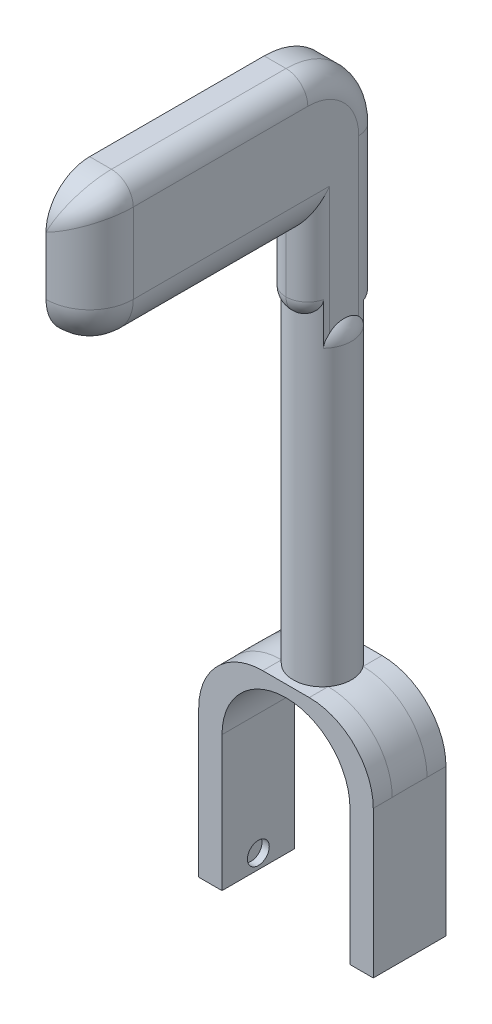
ISO-10303-21;
HEADER;
FILE_DESCRIPTION(('STEP AP214'),'2;1');
FILE_NAME('part.step','',(''),(''),'','','');
FILE_SCHEMA(('AUTOMOTIVE_DESIGN { 1 0 10303 214 1 1 1 1 }'));
ENDSEC;
DATA;
#1=APPLICATION_CONTEXT('core data for automotive mechanical design processes');
#2=APPLICATION_PROTOCOL_DEFINITION('international standard','automotive_design',2000,#1);
#3=PRODUCT_CONTEXT('',#1,'mechanical');
#4=PRODUCT('Part','Part','',(#3));
#5=PRODUCT_RELATED_PRODUCT_CATEGORY('part','',(#4));
#6=PRODUCT_DEFINITION_FORMATION('','',#4);
#7=PRODUCT_DEFINITION_CONTEXT('part definition',#1,'design');
#8=PRODUCT_DEFINITION('design','',#6,#7);
#9=PRODUCT_DEFINITION_SHAPE('','',#8);
#10=(LENGTH_UNIT() NAMED_UNIT(*) SI_UNIT(.MILLI.,.METRE.));
#11=(NAMED_UNIT(*) PLANE_ANGLE_UNIT() SI_UNIT($,.RADIAN.));
#12=(NAMED_UNIT(*) SI_UNIT($,.STERADIAN.) SOLID_ANGLE_UNIT());
#13=UNCERTAINTY_MEASURE_WITH_UNIT(LENGTH_MEASURE(1.E-05),#10,'distance_accuracy_value','');
#14=(GEOMETRIC_REPRESENTATION_CONTEXT(3) GLOBAL_UNCERTAINTY_ASSIGNED_CONTEXT((#13)) GLOBAL_UNIT_ASSIGNED_CONTEXT((#10,
#11,#12)) REPRESENTATION_CONTEXT('',''));
#15=CARTESIAN_POINT('',(0.,0.,0.));
#16=DIRECTION('',(0.,0.,1.));
#17=DIRECTION('',(1.,0.,0.));
#18=AXIS2_PLACEMENT_3D('',#15,#16,#17);
#19=CARTESIAN_POINT('',(0.,0.,0.));
#20=DIRECTION('',(0.,1.,0.));
#21=DIRECTION('',(0.,0.,1.));
#22=AXIS2_PLACEMENT_3D('',#19,#20,#21);
#23=PLANE('',#22);
#24=DIRECTION('',(1.,0.,0.));
#25=VECTOR('',#24,1.);
#26=CARTESIAN_POINT('',(-15.24,0.,-6.35));
#27=LINE('',#26,#25);
#28=CARTESIAN_POINT('',(-4.064,0.,-6.35));
#29=VERTEX_POINT('',#28);
#30=CARTESIAN_POINT('',(4.064,0.,-6.35));
#31=VERTEX_POINT('',#30);
#32=EDGE_CURVE('E277',#29,#31,#27,.T.);
#33=ORIENTED_EDGE('',*,*,#32,.F.);
#34=DIRECTION('',(0.,0.,-1.));
#35=VECTOR('',#34,1.);
#36=CARTESIAN_POINT('',(-4.064,0.,6.35));
#37=LINE('',#36,#35);
#38=CARTESIAN_POINT('',(-4.064,0.,-3.048));
#39=VERTEX_POINT('',#38);
#40=EDGE_CURVE('E623',#29,#39,#37,.F.);
#41=ORIENTED_EDGE('',*,*,#40,.T.);
#42=CARTESIAN_POINT('',(0.,0.,0.));
#43=DIRECTION('',(0.,1.,0.));
#44=DIRECTION('',(0.,0.,1.));
#45=AXIS2_PLACEMENT_3D('',#42,#43,#44);
#46=CIRCLE('',#45,5.08);
#47=CARTESIAN_POINT('',(4.064,0.,-3.048));
#48=VERTEX_POINT('',#47);
#49=EDGE_CURVE('E308',#48,#39,#46,.T.);
#50=ORIENTED_EDGE('',*,*,#49,.F.);
#51=DIRECTION('',(0.,0.,1.));
#52=VECTOR('',#51,1.);
#53=CARTESIAN_POINT('',(4.064,0.,-6.35));
#54=LINE('',#53,#52);
#55=EDGE_CURVE('E648',#48,#31,#54,.F.);
#56=ORIENTED_EDGE('',*,*,#55,.T.);
#57=EDGE_LOOP('',(#33,#41,#50,#56));
#58=FACE_BOUND('',#57,.T.);
#59=ADVANCED_FACE('F36',(#58),#23,.T.);
#60=CARTESIAN_POINT('',(-15.24,-36.83,6.35));
#61=DIRECTION('',(0.,0.,-1.));
#62=DIRECTION('',(-1.,0.,0.));
#63=AXIS2_PLACEMENT_3D('',#60,#61,#62);
#64=PLANE('',#63);
#65=DIRECTION('',(-1.,0.,0.));
#66=VECTOR('',#65,1.);
#67=CARTESIAN_POINT('',(-15.24,0.,6.35));
#68=LINE('',#67,#66);
#69=CARTESIAN_POINT('',(4.06399999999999,0.,6.35));
#70=VERTEX_POINT('',#69);
#71=CARTESIAN_POINT('',(-4.064,0.,6.35));
#72=VERTEX_POINT('',#71);
#73=EDGE_CURVE('E270',#70,#72,#68,.T.);
#74=ORIENTED_EDGE('',*,*,#73,.T.);
#75=CARTESIAN_POINT('',(-4.064,-11.176,6.35));
#76=DIRECTION('',(0.,0.,-1.));
#77=DIRECTION('',(-1.,0.,0.));
#78=AXIS2_PLACEMENT_3D('',#75,#76,#77);
#79=CIRCLE('',#78,11.176);
#80=CARTESIAN_POINT('',(-15.24,-11.176,6.35));
#81=VERTEX_POINT('',#80);
#82=EDGE_CURVE('E622',#72,#81,#79,.F.);
#83=ORIENTED_EDGE('',*,*,#82,.T.);
#84=DIRECTION('',(0.,1.,0.));
#85=VECTOR('',#84,1.);
#86=CARTESIAN_POINT('',(-15.24,-36.83,6.35));
#87=LINE('',#86,#85);
#88=CARTESIAN_POINT('',(-15.24,-36.83,6.35));
#89=VERTEX_POINT('',#88);
#90=EDGE_CURVE('E294',#89,#81,#87,.T.);
#91=ORIENTED_EDGE('',*,*,#90,.F.);
#92=DIRECTION('',(-1.,0.,0.));
#93=VECTOR('',#92,1.);
#94=CARTESIAN_POINT('',(-15.24,-36.83,6.35));
#95=LINE('',#94,#93);
#96=CARTESIAN_POINT('',(-11.176,-36.83,6.35));
#97=VERTEX_POINT('',#96);
#98=EDGE_CURVE('E276',#97,#89,#95,.T.);
#99=ORIENTED_EDGE('',*,*,#98,.F.);
#100=DIRECTION('',(0.,1.,0.));
#101=VECTOR('',#100,1.);
#102=CARTESIAN_POINT('',(-11.176,0.,6.35));
#103=LINE('',#102,#101);
#104=CARTESIAN_POINT('',(-11.176,-13.2334,6.35));
#105=VERTEX_POINT('',#104);
#106=EDGE_CURVE('E254',#97,#105,#103,.T.);
#107=ORIENTED_EDGE('',*,*,#106,.T.);
#108=CARTESIAN_POINT('',(0.,-13.2334,6.35));
#109=DIRECTION('',(0.,0.,1.));
#110=DIRECTION('',(1.,0.,0.));
#111=AXIS2_PLACEMENT_3D('',#108,#109,#110);
#112=CIRCLE('',#111,11.176);
#113=CARTESIAN_POINT('',(11.176,-13.2334,6.35));
#114=VERTEX_POINT('',#113);
#115=EDGE_CURVE('E257',#105,#114,#112,.F.);
#116=ORIENTED_EDGE('',*,*,#115,.T.);
#117=DIRECTION('',(0.,1.,0.));
#118=VECTOR('',#117,1.);
#119=CARTESIAN_POINT('',(11.176,0.,6.35));
#120=LINE('',#119,#118);
#121=CARTESIAN_POINT('',(11.176,-36.83,6.35));
#122=VERTEX_POINT('',#121);
#123=EDGE_CURVE('E245',#122,#114,#120,.T.);
#124=ORIENTED_EDGE('',*,*,#123,.F.);
#125=CARTESIAN_POINT('',(15.24,-36.83,6.35));
#126=VERTEX_POINT('',#125);
#127=EDGE_CURVE('E278',#126,#122,#95,.T.);
#128=ORIENTED_EDGE('',*,*,#127,.F.);
#129=DIRECTION('',(0.,1.,0.));
#130=VECTOR('',#129,1.);
#131=CARTESIAN_POINT('',(15.24,-36.83,6.35));
#132=LINE('',#131,#130);
#133=CARTESIAN_POINT('',(15.24,-11.176,6.35));
#134=VERTEX_POINT('',#133);
#135=EDGE_CURVE('E297',#126,#134,#132,.T.);
#136=ORIENTED_EDGE('',*,*,#135,.T.);
#137=CARTESIAN_POINT('',(4.064,-11.176,6.35));
#138=DIRECTION('',(0.,0.,-1.));
#139=DIRECTION('',(-1.,0.,0.));
#140=AXIS2_PLACEMENT_3D('',#137,#138,#139);
#141=CIRCLE('',#140,11.176);
#142=EDGE_CURVE('E659',#134,#70,#141,.F.);
#143=ORIENTED_EDGE('',*,*,#142,.T.);
#144=EDGE_LOOP('',(#74,#83,#91,#99,#107,#116,#124,#128,#136,#143));
#145=FACE_BOUND('',#144,.T.);
#146=ADVANCED_FACE('F582',(#145),#64,.F.);
#147=CARTESIAN_POINT('',(-15.24,-36.83,-6.35));
#148=DIRECTION('',(0.,0.,1.));
#149=DIRECTION('',(1.,0.,0.));
#150=AXIS2_PLACEMENT_3D('',#147,#148,#149);
#151=PLANE('',#150);
#152=DIRECTION('',(0.,1.,0.));
#153=VECTOR('',#152,1.);
#154=CARTESIAN_POINT('',(-15.24,-36.83,-6.35));
#155=LINE('',#154,#153);
#156=CARTESIAN_POINT('',(-15.24,-36.83,-6.35));
#157=VERTEX_POINT('',#156);
#158=CARTESIAN_POINT('',(-15.24,-11.176,-6.35));
#159=VERTEX_POINT('',#158);
#160=EDGE_CURVE('E292',#157,#159,#155,.T.);
#161=ORIENTED_EDGE('',*,*,#160,.T.);
#162=CARTESIAN_POINT('',(-4.064,-11.176,-6.35));
#163=DIRECTION('',(0.,0.,1.));
#164=DIRECTION('',(1.,0.,0.));
#165=AXIS2_PLACEMENT_3D('',#162,#163,#164);
#166=CIRCLE('',#165,11.176);
#167=EDGE_CURVE('E624',#159,#29,#166,.F.);
#168=ORIENTED_EDGE('',*,*,#167,.T.);
#169=ORIENTED_EDGE('',*,*,#32,.T.);
#170=CARTESIAN_POINT('',(4.064,-11.176,-6.35));
#171=DIRECTION('',(0.,0.,1.));
#172=DIRECTION('',(1.,0.,0.));
#173=AXIS2_PLACEMENT_3D('',#170,#171,#172);
#174=CIRCLE('',#173,11.176);
#175=CARTESIAN_POINT('',(15.24,-11.176,-6.35));
#176=VERTEX_POINT('',#175);
#177=EDGE_CURVE('E644',#31,#176,#174,.F.);
#178=ORIENTED_EDGE('',*,*,#177,.T.);
#179=DIRECTION('',(0.,1.,0.));
#180=VECTOR('',#179,1.);
#181=CARTESIAN_POINT('',(15.24,-36.83,-6.35));
#182=LINE('',#181,#180);
#183=CARTESIAN_POINT('',(15.24,-36.83,-6.35));
#184=VERTEX_POINT('',#183);
#185=EDGE_CURVE('E286',#184,#176,#182,.T.);
#186=ORIENTED_EDGE('',*,*,#185,.F.);
#187=DIRECTION('',(1.,0.,0.));
#188=VECTOR('',#187,1.);
#189=CARTESIAN_POINT('',(-15.24,-36.83,-6.35));
#190=LINE('',#189,#188);
#191=CARTESIAN_POINT('',(11.176,-36.83,-6.35));
#192=VERTEX_POINT('',#191);
#193=EDGE_CURVE('E253',#192,#184,#190,.T.);
#194=ORIENTED_EDGE('',*,*,#193,.F.);
#195=DIRECTION('',(0.,1.,0.));
#196=VECTOR('',#195,1.);
#197=CARTESIAN_POINT('',(11.176,0.,-6.35));
#198=LINE('',#197,#196);
#199=CARTESIAN_POINT('',(11.176,-13.2334,-6.35));
#200=VERTEX_POINT('',#199);
#201=EDGE_CURVE('E239',#192,#200,#198,.T.);
#202=ORIENTED_EDGE('',*,*,#201,.T.);
#203=CARTESIAN_POINT('',(0.,-13.2334,-6.35));
#204=DIRECTION('',(0.,0.,1.));
#205=DIRECTION('',(1.,0.,0.));
#206=AXIS2_PLACEMENT_3D('',#203,#204,#205);
#207=CIRCLE('',#206,11.176);
#208=CARTESIAN_POINT('',(-11.176,-13.2334,-6.35));
#209=VERTEX_POINT('',#208);
#210=EDGE_CURVE('E228',#209,#200,#207,.F.);
#211=ORIENTED_EDGE('',*,*,#210,.F.);
#212=DIRECTION('',(0.,1.,0.));
#213=VECTOR('',#212,1.);
#214=CARTESIAN_POINT('',(-11.176,0.,-6.35));
#215=LINE('',#214,#213);
#216=CARTESIAN_POINT('',(-11.176,-36.83,-6.35));
#217=VERTEX_POINT('',#216);
#218=EDGE_CURVE('E238',#217,#209,#215,.T.);
#219=ORIENTED_EDGE('',*,*,#218,.F.);
#220=EDGE_CURVE('E283',#157,#217,#190,.T.);
#221=ORIENTED_EDGE('',*,*,#220,.F.);
#222=EDGE_LOOP('',(#161,#168,#169,#178,#186,#194,#202,#211,#219,#221));
#223=FACE_BOUND('',#222,.T.);
#224=ADVANCED_FACE('F251',(#223),#151,.F.);
#225=CARTESIAN_POINT('',(0.,-36.83,0.));
#226=DIRECTION('',(0.,1.,0.));
#227=DIRECTION('',(0.,0.,1.));
#228=AXIS2_PLACEMENT_3D('',#225,#226,#227);
#229=PLANE('',#228);
#230=DIRECTION('',(0.,0.,1.));
#231=VECTOR('',#230,1.);
#232=CARTESIAN_POINT('',(-11.176,-36.83,-6.35));
#233=LINE('',#232,#231);
#234=EDGE_CURVE('E267',#217,#97,#233,.T.);
#235=ORIENTED_EDGE('',*,*,#234,.T.);
#236=ORIENTED_EDGE('',*,*,#98,.T.);
#237=DIRECTION('',(0.,0.,-1.));
#238=VECTOR('',#237,1.);
#239=CARTESIAN_POINT('',(-15.24,-36.83,-6.35));
#240=LINE('',#239,#238);
#241=EDGE_CURVE('E281',#89,#157,#240,.T.);
#242=ORIENTED_EDGE('',*,*,#241,.T.);
#243=ORIENTED_EDGE('',*,*,#220,.T.);
#244=EDGE_LOOP('',(#235,#236,#242,#243));
#245=FACE_BOUND('',#244,.T.);
#246=ADVANCED_FACE('F601',(#245),#229,.F.);
#247=CARTESIAN_POINT('',(0.,55.00624,0.));
#248=DIRECTION('',(0.,-1.,0.));
#249=DIRECTION('',(0.,0.,-1.));
#250=AXIS2_PLACEMENT_3D('',#247,#248,#249);
#251=CYLINDRICAL_SURFACE('',#250,5.08);
#252=DIRECTION('',(0.,-1.,0.));
#253=VECTOR('',#252,1.);
#254=CARTESIAN_POINT('',(3.68901663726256,55.00624,-3.4925));
#255=LINE('',#254,#253);
#256=CARTESIAN_POINT('',(3.68901663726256,55.00624,-3.4925));
#257=VERTEX_POINT('',#256);
#258=CARTESIAN_POINT('',(3.68901663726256,51.19624,-3.4925));
#259=VERTEX_POINT('',#258);
#260=EDGE_CURVE('E508',#257,#259,#255,.T.);
#261=ORIENTED_EDGE('',*,*,#260,.T.);
#262=CARTESIAN_POINT('',(0.,51.19624,0.));
#263=DIRECTION('',(0.,1.,0.));
#264=DIRECTION('',(0.,0.,1.));
#265=AXIS2_PLACEMENT_3D('',#262,#263,#264);
#266=CIRCLE('',#265,5.08);
#267=CARTESIAN_POINT('',(3.68901663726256,51.19624,3.4925));
#268=VERTEX_POINT('',#267);
#269=EDGE_CURVE('E1024',#259,#268,#266,.F.);
#270=ORIENTED_EDGE('',*,*,#269,.T.);
#271=DIRECTION('',(0.,-1.,0.));
#272=VECTOR('',#271,1.);
#273=CARTESIAN_POINT('',(3.68901663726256,51.19624,3.4925));
#274=LINE('',#273,#272);
#275=CARTESIAN_POINT('',(3.68901663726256,58.56224,3.4925));
#276=VERTEX_POINT('',#275);
#277=EDGE_CURVE('E1023',#268,#276,#274,.F.);
#278=ORIENTED_EDGE('',*,*,#277,.T.);
#279=CARTESIAN_POINT('',(3.68901663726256,58.56224,3.4925));
#280=CARTESIAN_POINT('',(3.68902032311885,58.5106871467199,3.49248841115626));
#281=CARTESIAN_POINT('',(3.68742358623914,58.4591629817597,3.49418331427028));
#282=CARTESIAN_POINT('',(3.68107899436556,58.3565639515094,3.50086991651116));
#283=CARTESIAN_POINT('',(3.67633362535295,58.3054887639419,3.50585901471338));
#284=CARTESIAN_POINT('',(3.65756228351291,58.1543440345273,3.52547539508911));
#285=CARTESIAN_POINT('',(3.63899880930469,58.0553846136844,3.54475636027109));
#286=CARTESIAN_POINT('',(3.59073272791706,57.8633509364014,3.59363155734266));
#287=CARTESIAN_POINT('',(3.56106181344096,57.7702608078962,3.62319642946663));
#288=CARTESIAN_POINT('',(3.49165896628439,57.5906682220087,3.69012905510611));
#289=CARTESIAN_POINT('',(3.4519002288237,57.5041841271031,3.72751754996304));
#290=CARTESIAN_POINT('',(3.33910255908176,57.292979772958,3.82952600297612));
#291=CARTESIAN_POINT('',(3.25978506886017,57.1733830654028,3.89781519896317));
#292=CARTESIAN_POINT('',(3.0831214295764,56.9516862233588,4.03900640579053));
#293=CARTESIAN_POINT('',(2.9857588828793,56.8496021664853,4.11191257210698));
#294=CARTESIAN_POINT('',(2.81160172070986,56.6939242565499,4.2318309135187));
#295=CARTESIAN_POINT('',(2.73912258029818,56.6356692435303,4.27919132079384));
#296=CARTESIAN_POINT('',(2.58821122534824,56.525981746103,4.37211577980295));
#297=CARTESIAN_POINT('',(2.50978405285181,56.4745435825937,4.41768130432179));
#298=CARTESIAN_POINT('',(2.34589597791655,56.3771582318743,4.506890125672));
#299=CARTESIAN_POINT('',(2.26032397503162,56.3313449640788,4.55047499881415));
#300=CARTESIAN_POINT('',(2.08419006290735,56.2461705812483,4.63379403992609));
#301=CARTESIAN_POINT('',(1.99362609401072,56.2068121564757,4.67352659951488));
#302=CARTESIAN_POINT('',(1.80794091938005,56.1342438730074,4.74845240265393));
#303=CARTESIAN_POINT('',(1.71280820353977,56.1010506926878,4.78363325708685));
#304=CARTESIAN_POINT('',(1.51887273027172,56.0407499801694,4.8486997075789));
#305=CARTESIAN_POINT('',(1.42006982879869,56.0136426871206,4.87858509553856));
#306=CARTESIAN_POINT('',(1.21414861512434,55.9640762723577,4.93398456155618));
#307=CARTESIAN_POINT('',(1.10686725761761,55.9419401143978,4.95918254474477));
#308=CARTESIAN_POINT('',(0.889793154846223,55.9041004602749,5.00269213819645));
#309=CARTESIAN_POINT('',(0.780000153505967,55.8883976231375,5.02100304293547));
#310=CARTESIAN_POINT('',(0.558919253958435,55.8633421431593,5.05038687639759));
#311=CARTESIAN_POINT('',(0.447634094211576,55.8539791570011,5.06147159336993));
#312=CARTESIAN_POINT('',(0.224233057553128,55.8415086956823,5.07628923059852));
#313=CARTESIAN_POINT('',(0.112117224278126,55.8384008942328,5.08002253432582));
#314=CARTESIAN_POINT('',(0.,55.83839345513,5.08));
#315=B_SPLINE_CURVE_WITH_KNOTS('',3,(#279,#280,#281,#282,#283,#284,#285,#286,#287,#288,#289,
#290,#291,#292,#293,#294,#295,#296,#297,#298,#299,#300,#301,#302,#303,#304,#305,#306,#307,#308,
#309,#310,#311,#312,#313,#314),.UNSPECIFIED.,.F.,.F.,(4,2,2,2,2,2,2,2,2,2,2,2,2,2,2,2,2,4),(0.,
0.154552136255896,0.30898239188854,0.614971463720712,0.920094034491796,1.22603600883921,
1.70020306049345,2.17480312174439,2.48748459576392,2.79990391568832,3.11871703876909,
3.4376627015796,3.75745900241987,4.07726786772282,4.41404642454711,4.75085947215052,
5.08712168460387,5.42336635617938),.UNSPECIFIED.);
#316=CARTESIAN_POINT('',(0.,55.83839345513,5.08));
#317=VERTEX_POINT('',#316);
#318=EDGE_CURVE('E11',#276,#317,#315,.T.);
#319=ORIENTED_EDGE('',*,*,#318,.T.);
#320=CARTESIAN_POINT('',(0.,55.83839345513,5.08));
#321=CARTESIAN_POINT('',(-0.109426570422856,55.8384002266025,5.0800204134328));
#322=CARTESIAN_POINT('',(-0.218851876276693,55.8413609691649,5.07646514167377));
#323=CARTESIAN_POINT('',(-0.436922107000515,55.8532391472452,5.06234940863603));
#324=CARTESIAN_POINT('',(-0.545567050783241,55.8621564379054,5.05178911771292));
#325=CARTESIAN_POINT('',(-0.761181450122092,55.8859829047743,5.02382542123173));
#326=CARTESIAN_POINT('',(-0.868152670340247,55.9008852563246,5.00642981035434));
#327=CARTESIAN_POINT('',(-1.07978098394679,55.9367765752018,4.96508734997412));
#328=CARTESIAN_POINT('',(-1.18443812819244,55.9577654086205,4.94114064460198));
#329=CARTESIAN_POINT('',(-1.39066197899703,56.0059511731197,4.8871073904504));
#330=CARTESIAN_POINT('',(-1.49222953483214,56.0331463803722,4.85702254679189));
#331=CARTESIAN_POINT('',(-1.69157228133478,56.0939133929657,4.79124185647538));
#332=CARTESIAN_POINT('',(-1.78934743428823,56.1274852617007,4.75554595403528));
#333=CARTESIAN_POINT('',(-1.98049365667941,56.2012501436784,4.67917175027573));
#334=CARTESIAN_POINT('',(-2.07385973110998,56.2414504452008,4.63848797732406));
#335=CARTESIAN_POINT('',(-2.25536160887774,56.3286922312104,4.55299952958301));
#336=CARTESIAN_POINT('',(-2.34349772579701,56.3757333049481,4.50819510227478));
#337=CARTESIAN_POINT('',(-2.51265730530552,56.4762507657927,4.41611776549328));
#338=CARTESIAN_POINT('',(-2.59376266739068,56.5296285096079,4.36888787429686));
#339=CARTESIAN_POINT('',(-2.74950755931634,56.6436475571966,4.27258556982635));
#340=CARTESIAN_POINT('',(-2.82414833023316,56.7042874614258,4.22351351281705));
#341=CARTESIAN_POINT('',(-2.96608891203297,56.833061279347,4.12506437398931));
#342=CARTESIAN_POINT('',(-3.03340492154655,56.9011779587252,4.07568823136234));
#343=CARTESIAN_POINT('',(-3.16001490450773,57.0453066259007,3.97832634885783));
#344=CARTESIAN_POINT('',(-3.21931545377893,57.1213120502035,3.93033949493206));
#345=CARTESIAN_POINT('',(-3.33705673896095,57.2932759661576,3.83108371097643));
#346=CARTESIAN_POINT('',(-3.39410100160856,57.390526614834,3.78036255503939));
#347=CARTESIAN_POINT('',(-3.49466713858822,57.5955991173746,3.68760058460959));
#348=CARTESIAN_POINT('',(-3.53820751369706,57.7034062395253,3.64554792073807));
#349=CARTESIAN_POINT('',(-3.60390988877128,57.9096519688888,3.58050397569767));
#350=CARTESIAN_POINT('',(-3.62841329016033,58.0067037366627,3.55551292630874));
#351=CARTESIAN_POINT('',(-3.66544932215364,58.2051996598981,3.51733430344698));
#352=CARTESIAN_POINT('',(-3.67801085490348,58.3066325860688,3.5041182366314));
#353=CARTESIAN_POINT('',(-3.68745459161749,58.4598269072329,3.49414329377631));
#354=CARTESIAN_POINT('',(-3.68903759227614,58.5110406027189,3.49245826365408));
#355=CARTESIAN_POINT('',(-3.68901663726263,58.56224,3.49250000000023));
#356=B_SPLINE_CURVE_WITH_KNOTS('',3,(#320,#321,#322,#323,#324,#325,#326,#327,#328,#329,#330,
#331,#332,#333,#334,#335,#336,#337,#338,#339,#340,#341,#342,#343,#344,#345,#346,#347,#348,#349,
#350,#351,#352,#353,#354,#355),.UNSPECIFIED.,.F.,.F.,(4,2,2,2,2,2,2,2,2,2,2,2,2,2,2,2,2,4),(0.,
0.328180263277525,0.656352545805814,0.98415167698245,1.31194359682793,1.63964458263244,
1.96734882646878,2.29541582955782,2.62346314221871,2.9469462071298,3.27036703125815,
3.5930574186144,3.915481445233,4.28510145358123,4.65421281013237,4.96245467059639,
5.26994859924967,5.42354580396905),.UNSPECIFIED.);
#357=CARTESIAN_POINT('',(-3.68901663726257,58.56224,3.4925));
#358=VERTEX_POINT('',#357);
#359=EDGE_CURVE('E47',#317,#358,#356,.T.);
#360=ORIENTED_EDGE('',*,*,#359,.T.);
#361=DIRECTION('',(0.,-1.,0.));
#362=VECTOR('',#361,1.);
#363=CARTESIAN_POINT('',(-3.68901663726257,55.00624,3.4925));
#364=LINE('',#363,#362);
#365=CARTESIAN_POINT('',(-3.68901663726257,51.19624,3.4925));
#366=VERTEX_POINT('',#365);
#367=EDGE_CURVE('E997',#358,#366,#364,.T.);
#368=ORIENTED_EDGE('',*,*,#367,.T.);
#369=CARTESIAN_POINT('',(0.,51.19624,0.));
#370=DIRECTION('',(0.,1.,0.));
#371=DIRECTION('',(0.,0.,1.));
#372=AXIS2_PLACEMENT_3D('',#369,#370,#371);
#373=CIRCLE('',#372,5.08);
#374=CARTESIAN_POINT('',(-3.81,51.19624,-3.36010416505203));
#375=VERTEX_POINT('',#374);
#376=EDGE_CURVE('E1000',#366,#375,#373,.F.);
#377=ORIENTED_EDGE('',*,*,#376,.T.);
#378=DIRECTION('',(0.,-1.,0.));
#379=VECTOR('',#378,1.);
#380=CARTESIAN_POINT('',(-3.81,51.19624,-3.36010416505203));
#381=LINE('',#380,#379);
#382=CARTESIAN_POINT('',(-3.81,55.00624,-3.36010416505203));
#383=VERTEX_POINT('',#382);
#384=EDGE_CURVE('E1007',#375,#383,#381,.F.);
#385=ORIENTED_EDGE('',*,*,#384,.T.);
#386=CARTESIAN_POINT('',(0.,55.00624,0.));
#387=DIRECTION('',(0.,1.,0.));
#388=DIRECTION('',(0.,0.,1.));
#389=AXIS2_PLACEMENT_3D('',#386,#387,#388);
#390=CIRCLE('',#389,5.08);
#391=EDGE_CURVE('E301',#257,#383,#390,.T.);
#392=ORIENTED_EDGE('',*,*,#391,.F.);
#393=EDGE_LOOP('',(#261,#270,#278,#319,#360,#368,#377,#385,#392));
#394=FACE_BOUND('',#393,.T.);
#395=CARTESIAN_POINT('',(4.064,0.,3.048));
#396=VERTEX_POINT('',#395);
#397=EDGE_CURVE('E305',#396,#48,#46,.T.);
#398=ORIENTED_EDGE('',*,*,#397,.T.);
#399=ORIENTED_EDGE('',*,*,#49,.T.);
#400=CARTESIAN_POINT('',(-4.064,0.,3.048));
#401=VERTEX_POINT('',#400);
#402=EDGE_CURVE('E611',#39,#401,#46,.T.);
#403=ORIENTED_EDGE('',*,*,#402,.T.);
#404=EDGE_CURVE('E300',#401,#396,#46,.T.);
#405=ORIENTED_EDGE('',*,*,#404,.T.);
#406=EDGE_LOOP('',(#398,#399,#403,#405));
#407=FACE_BOUND('',#406,.T.);
#408=ADVANCED_FACE('F327',(#394,#407),#251,.T.);
#409=CARTESIAN_POINT('',(15.24,-36.83,-6.35));
#410=DIRECTION('',(-1.,0.,0.));
#411=DIRECTION('',(0.,0.,1.));
#412=AXIS2_PLACEMENT_3D('',#409,#410,#411);
#413=PLANE('',#412);
#414=ORIENTED_EDGE('',*,*,#185,.T.);
#415=DIRECTION('',(0.,0.,1.));
#416=VECTOR('',#415,1.);
#417=CARTESIAN_POINT('',(15.24,-11.176,6.35));
#418=LINE('',#417,#416);
#419=CARTESIAN_POINT('',(15.24,-11.176,-3.048));
#420=VERTEX_POINT('',#419);
#421=EDGE_CURVE('E318',#176,#420,#418,.T.);
#422=ORIENTED_EDGE('',*,*,#421,.T.);
#423=CARTESIAN_POINT('',(2.49817253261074,0.,-4.42329447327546));
#424=CARTESIAN_POINT('',(15.24,1.74548696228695,-3.9715633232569));
#425=CARTESIAN_POINT('',(15.24,-10.7128219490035,-7.19576741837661));
#426=CARTESIAN_POINT('',(2.52731868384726,0.,-4.40682854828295));
#427=CARTESIAN_POINT('',(15.24,1.71242413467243,-3.98022104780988));
#428=CARTESIAN_POINT('',(15.24,-10.7414799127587,-7.08503729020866));
#429=CARTESIAN_POINT('',(2.55742082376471,0.,-4.38945335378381));
#430=CARTESIAN_POINT('',(15.24,1.67787467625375,-3.98713590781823));
#431=CARTESIAN_POINT('',(15.24,-10.7686564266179,-6.97393045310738));
#432=CARTESIAN_POINT('',(2.61966236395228,0.,-4.35259501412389));
#433=CARTESIAN_POINT('',(15.24,1.60590393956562,-3.99698948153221));
#434=CARTESIAN_POINT('',(15.24,-10.8200993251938,-6.75105069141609));
#435=CARTESIAN_POINT('',(2.65180166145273,0.,-4.33311197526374));
#436=CARTESIAN_POINT('',(15.24,1.56849898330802,-3.99994015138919));
#437=CARTESIAN_POINT('',(15.24,-10.8443658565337,-6.63927780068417));
#438=CARTESIAN_POINT('',(2.75142867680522,0.,-4.27108873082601));
#439=CARTESIAN_POINT('',(15.24,1.45226954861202,-4.00217786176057));
#440=CARTESIAN_POINT('',(15.24,-10.9128568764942,-6.30320598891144));
#441=CARTESIAN_POINT('',(2.82215948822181,0.,-4.22495571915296));
#442=CARTESIAN_POINT('',(15.24,1.36910301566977,-3.99495874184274));
#443=CARTESIAN_POINT('',(15.24,-10.952806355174,-6.07802354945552));
#444=CARTESIAN_POINT('',(2.97252337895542,0.,-4.12053712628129));
#445=CARTESIAN_POINT('',(15.24,1.19283051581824,-3.95898661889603));
#446=CARTESIAN_POINT('',(15.24,-11.0216102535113,-5.62790861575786));
#447=CARTESIAN_POINT('',(3.05207765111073,0.,-4.06235564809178));
#448=CARTESIAN_POINT('',(15.24,1.09997107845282,-3.93058818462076));
#449=CARTESIAN_POINT('',(15.24,-11.0505540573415,-5.40298957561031));
#450=CARTESIAN_POINT('',(3.22110615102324,0.,-3.92968820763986));
#451=CARTESIAN_POINT('',(15.24,0.905142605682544,-3.84796203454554));
#452=CARTESIAN_POINT('',(15.24,-11.0986583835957,-4.95209239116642));
#453=CARTESIAN_POINT('',(3.31058155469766,0.,-3.85520031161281));
#454=CARTESIAN_POINT('',(15.24,0.803330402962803,-3.79397788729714));
#455=CARTESIAN_POINT('',(15.24,-11.117817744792,-4.72611412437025));
#456=CARTESIAN_POINT('',(3.49900815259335,0.,-3.68503098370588));
#457=CARTESIAN_POINT('',(15.24,0.593224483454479,-3.65536786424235));
#458=CARTESIAN_POINT('',(15.24,-11.1474573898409,-4.27398756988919));
#459=CARTESIAN_POINT('',(3.59794321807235,0.,-3.5893852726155));
#460=CARTESIAN_POINT('',(15.24,0.485084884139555,-3.57112106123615));
#461=CARTESIAN_POINT('',(15.24,-11.157952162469,-4.04784020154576));
#462=CARTESIAN_POINT('',(3.80360871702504,0.,-3.37068864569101));
#463=CARTESIAN_POINT('',(15.24,0.266060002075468,-3.36697620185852));
#464=CARTESIAN_POINT('',(15.24,-11.1717931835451,-3.59535156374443));
#465=CARTESIAN_POINT('',(3.91033885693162,0.,-3.24763876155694));
#466=CARTESIAN_POINT('',(15.24,0.155264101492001,-3.24747437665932));
#467=CARTESIAN_POINT('',(15.24,-11.1751397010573,-3.36901030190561));
#468=CARTESIAN_POINT('',(4.07287028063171,0.,-3.03741833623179));
#469=CARTESIAN_POINT('',(15.24,-0.00899626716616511,-3.03779692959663));
#470=CARTESIAN_POINT('',(15.24,-11.1762100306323,-3.02928347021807));
#471=CARTESIAN_POINT('',(4.12750719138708,0.,-2.96298661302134));
#472=CARTESIAN_POINT('',(15.24,-0.0632823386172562,-2.96307758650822));
#473=CARTESIAN_POINT('',(15.24,-11.1759063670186,-2.91589619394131));
#474=CARTESIAN_POINT('',(4.23657137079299,0.,-2.80483704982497));
#475=CARTESIAN_POINT('',(15.24,-0.170051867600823,-2.80343001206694));
#476=CARTESIAN_POINT('',(15.24,-11.1742539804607,-2.68912896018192));
#477=CARTESIAN_POINT('',(4.29099863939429,0.,-2.7211192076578));
#478=CARTESIAN_POINT('',(15.24,-0.222546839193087,-2.71854656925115));
#479=CARTESIAN_POINT('',(15.24,-11.172905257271,-2.57574900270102));
#480=CARTESIAN_POINT('',(4.39843619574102,0.,-2.54379505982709));
#481=CARTESIAN_POINT('',(15.24,-0.32465584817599,-2.53845485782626));
#482=CARTESIAN_POINT('',(15.24,-11.169453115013,-2.34899282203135));
#483=CARTESIAN_POINT('',(4.45144637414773,0.,-2.45018799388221));
#484=CARTESIAN_POINT('',(15.24,-0.374291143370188,-2.4432798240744));
#485=CARTESIAN_POINT('',(15.24,-11.1673496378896,-2.23561659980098));
#486=CARTESIAN_POINT('',(4.5545309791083,0.,-2.25278680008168));
#487=CARTESIAN_POINT('',(15.24,-0.469462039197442,-2.24281132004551));
#488=CARTESIAN_POINT('',(15.24,-11.1626940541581,-2.00887321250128));
#489=CARTESIAN_POINT('',(4.60460539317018,0.,-2.14899262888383));
#490=CARTESIAN_POINT('',(15.24,-0.515029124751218,-2.1375343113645));
#491=CARTESIAN_POINT('',(15.24,-11.1601419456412,-1.89550604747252));
#492=CARTESIAN_POINT('',(4.71905810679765,0.,-1.88797520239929));
#493=CARTESIAN_POINT('',(15.24,-0.617751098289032,-1.87380187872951));
#494=CARTESIAN_POINT('',(15.24,-11.1538571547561,-1.62367346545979));
#495=CARTESIAN_POINT('',(4.78120139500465,0.,-1.72592398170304));
#496=CARTESIAN_POINT('',(15.24,-0.6725123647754,-1.71053664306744));
#497=CARTESIAN_POINT('',(15.24,-11.1500587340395,-1.46520963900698));
#498=CARTESIAN_POINT('',(4.89109403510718,0.,-1.38410835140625));
#499=CARTESIAN_POINT('',(15.24,-0.76795464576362,-1.36819318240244));
#500=CARTESIAN_POINT('',(15.24,-11.1430005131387,-1.1482695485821));
#501=CARTESIAN_POINT('',(4.93884342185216,0.,-1.20434398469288));
#502=CARTESIAN_POINT('',(15.24,-0.808758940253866,-1.18897660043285));
#503=CARTESIAN_POINT('',(15.24,-11.1397407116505,-0.989793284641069));
#504=CARTESIAN_POINT('',(5.01503603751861,0.,-0.831800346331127));
#505=CARTESIAN_POINT('',(15.24,-0.873253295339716,-0.819543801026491));
#506=CARTESIAN_POINT('',(15.24,-11.1344274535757,-0.672853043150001));
#507=CARTESIAN_POINT('',(5.04348340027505,0.,-0.639023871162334));
#508=CARTESIAN_POINT('',(15.24,-0.897052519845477,-0.62906815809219));
#509=CARTESIAN_POINT('',(15.24,-11.1323737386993,-0.514389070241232));
#510=CARTESIAN_POINT('',(5.07777578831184,0.,-0.247380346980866));
#511=CARTESIAN_POINT('',(15.24,-0.925641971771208,-0.243315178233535));
#512=CARTESIAN_POINT('',(15.24,-11.1298891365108,-0.197448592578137));
#513=CARTESIAN_POINT('',(5.0836209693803,0.,-0.0485133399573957));
#514=CARTESIAN_POINT('',(15.24,-0.930485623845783,-0.0476864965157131));
#515=CARTESIAN_POINT('',(15.24,-11.1294582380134,-0.0389720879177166));
#516=CARTESIAN_POINT('',(5.07199610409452,0.,0.346912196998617));
#517=CARTESIAN_POINT('',(15.24,-0.920824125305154,0.341223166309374));
#518=CARTESIAN_POINT('',(15.24,-11.1303064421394,0.277794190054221));
#519=CARTESIAN_POINT('',(5.05455280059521,0.,0.543473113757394));
#520=CARTESIAN_POINT('',(15.24,-0.906322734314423,0.534877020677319));
#521=CARTESIAN_POINT('',(15.24,-11.1315835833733,0.436083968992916));
#522=CARTESIAN_POINT('',(4.99850167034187,0.,0.926797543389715));
#523=CARTESIAN_POINT('',(15.24,-0.859303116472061,0.913505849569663));
#524=CARTESIAN_POINT('',(15.24,-11.1355851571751,0.752645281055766));
#525=CARTESIAN_POINT('',(4.95989366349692,0.,1.1135609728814));
#526=CARTESIAN_POINT('',(15.24,-0.826701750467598,1.09879300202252));
#527=CARTESIAN_POINT('',(15.24,-11.1383096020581,0.910916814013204));
#528=CARTESIAN_POINT('',(4.86574271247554,0.,1.47148638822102));
#529=CARTESIAN_POINT('',(15.24,-0.746069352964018,1.45542501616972));
#530=CARTESIAN_POINT('',(15.24,-11.1446536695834,1.22749581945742));
#531=CARTESIAN_POINT('',(4.81019387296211,0.,1.6426429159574));
#532=CARTESIAN_POINT('',(15.24,-0.697914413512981,1.62696590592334));
#533=CARTESIAN_POINT('',(15.24,-11.1482736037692,1.38580328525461));
#534=CARTESIAN_POINT('',(4.68737087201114,0.,1.96593906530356));
#535=CARTESIAN_POINT('',(15.24,-0.589522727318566,1.95241542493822));
#536=CARTESIAN_POINT('',(15.24,-11.1556591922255,1.70241512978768));
#537=CARTESIAN_POINT('',(4.62009666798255,0.,2.11807861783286));
#538=CARTESIAN_POINT('',(15.24,-0.529166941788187,2.10640062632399));
#539=CARTESIAN_POINT('',(15.24,-11.1594248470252,1.86071950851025));
#540=CARTESIAN_POINT('',(4.47866096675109,0.,2.40278523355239));
#541=CARTESIAN_POINT('',(15.24,-0.399697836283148,2.39526291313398));
#542=CARTESIAN_POINT('',(15.24,-11.166275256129,2.17780780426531));
#543=CARTESIAN_POINT('',(4.40447988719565,0.,2.53529370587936));
#544=CARTESIAN_POINT('',(15.24,-0.330466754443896,2.530052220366));
#545=CARTESIAN_POINT('',(15.24,-11.1693579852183,2.33659176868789));
#546=CARTESIAN_POINT('',(4.25362807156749,0.,2.78098004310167));
#547=CARTESIAN_POINT('',(15.24,-0.186685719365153,2.77950299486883));
#548=CARTESIAN_POINT('',(15.24,-11.173984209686,2.65418372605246));
#549=CARTESIAN_POINT('',(4.17695735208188,0.,2.89415803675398));
#550=CARTESIAN_POINT('',(15.24,-0.112079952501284,2.89406666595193));
#551=CARTESIAN_POINT('',(15.24,-11.1755277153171,2.81299171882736));
#552=CARTESIAN_POINT('',(4.02429946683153,0.,3.10292346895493));
#553=CARTESIAN_POINT('',(15.24,0.0395792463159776,3.10355287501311));
#554=CARTESIAN_POINT('',(15.24,-11.1762880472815,3.1305215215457));
#555=CARTESIAN_POINT('',(3.94831191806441,0.,3.19852143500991));
#556=CARTESIAN_POINT('',(15.24,0.116649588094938,3.19835499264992));
#557=CARTESIAN_POINT('',(15.24,-11.1755062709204,3.28924332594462));
#558=CARTESIAN_POINT('',(3.7990595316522,0.,3.37444103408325));
#559=CARTESIAN_POINT('',(15.24,0.27100059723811,3.3695947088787));
#560=CARTESIAN_POINT('',(15.24,-11.1709194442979,3.60664895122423));
#561=CARTESIAN_POINT('',(3.72579472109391,0.,3.45476251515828));
#562=CARTESIAN_POINT('',(15.24,0.348268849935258,3.44589115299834));
#563=CARTESIAN_POINT('',(15.24,-11.1671143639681,3.76533277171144));
#564=CARTESIAN_POINT('',(3.58309440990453,0.,3.60255565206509));
#565=CARTESIAN_POINT('',(15.24,0.501404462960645,3.58179084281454));
#566=CARTESIAN_POINT('',(15.24,-11.1558650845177,4.08290256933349));
#567=CARTESIAN_POINT('',(3.51366709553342,0.,3.67000053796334));
#568=CARTESIAN_POINT('',(15.24,0.57723365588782,3.64122492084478));
#569=CARTESIAN_POINT('',(15.24,-11.1484134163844,4.24178829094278));
#570=CARTESIAN_POINT('',(3.37945023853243,0.,3.79394837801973));
#571=CARTESIAN_POINT('',(15.24,0.725994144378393,3.74486000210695));
#572=CARTESIAN_POINT('',(15.24,-11.1293560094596,4.55930617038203));
#573=CARTESIAN_POINT('',(3.31466046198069,0.,3.85045188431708));
#574=CARTESIAN_POINT('',(15.24,0.798878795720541,3.78894466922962));
#575=CARTESIAN_POINT('',(15.24,-11.1177504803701,4.71793834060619));
#576=CARTESIAN_POINT('',(3.18981605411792,0.,3.95450714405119));
#577=CARTESIAN_POINT('',(15.24,0.940928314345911,3.86365567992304));
#578=CARTESIAN_POINT('',(15.24,-11.0899257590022,5.03514582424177));
#579=CARTESIAN_POINT('',(3.12977188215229,0.,4.00203942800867));
#580=CARTESIAN_POINT('',(15.24,1.01003056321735,3.89415439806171));
#581=CARTESIAN_POINT('',(15.24,-11.0736967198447,5.19372028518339));
#582=CARTESIAN_POINT('',(3.01448645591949,0.,4.08954196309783));
#583=CARTESIAN_POINT('',(15.24,1.14372347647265,3.94312858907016));
#584=CARTESIAN_POINT('',(15.24,-11.0362952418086,5.51031752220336));
#585=CARTESIAN_POINT('',(2.95924622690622,0.,4.12951060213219));
#586=CARTESIAN_POINT('',(15.24,1.20825876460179,3.96152251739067));
#587=CARTESIAN_POINT('',(15.24,-11.0151217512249,5.66834017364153));
#588=CARTESIAN_POINT('',(2.90637725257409,0.,4.16645787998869));
#589=CARTESIAN_POINT('',(15.24,1.27004499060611,3.97470062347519));
#590=CARTESIAN_POINT('',(15.24,-10.9913094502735,5.82597652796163));
#591=(BOUNDED_SURFACE() B_SPLINE_SURFACE(3,2,((#423,#424,#425),(#426,#427,#428),(#429,#430,
#431),(#432,#433,#434),(#435,#436,#437),(#438,#439,#440),(#441,#442,#443),(#444,#445,#446),
(#447,#448,#449),(#450,#451,#452),(#453,#454,#455),(#456,#457,#458),(#459,#460,#461),(#462,#463,
#464),(#465,#466,#467),(#468,#469,#470),(#471,#472,#473),(#474,#475,#476),(#477,#478,#479),
(#480,#481,#482),(#483,#484,#485),(#486,#487,#488),(#489,#490,#491),(#492,#493,#494),(#495,#496,
#497),(#498,#499,#500),(#501,#502,#503),(#504,#505,#506),(#507,#508,#509),(#510,#511,#512),
(#513,#514,#515),(#516,#517,#518),(#519,#520,#521),(#522,#523,#524),(#525,#526,#527),(#528,#529,
#530),(#531,#532,#533),(#534,#535,#536),(#537,#538,#539),(#540,#541,#542),(#543,#544,#545),
(#546,#547,#548),(#549,#550,#551),(#552,#553,#554),(#555,#556,#557),(#558,#559,#560),(#561,#562,
#563),(#564,#565,#566),(#567,#568,#569),(#570,#571,#572),(#573,#574,#575),(#576,#577,#578),
(#579,#580,#581),(#582,#583,#584),(#585,#586,#587),(#588,#589,#590)),.UNSPECIFIED.,.F.,.F.,
.F.) B_SPLINE_SURFACE_WITH_KNOTS((4,2,2,2,2,2,2,2,2,2,2,2,2,2,2,2,2,2,2,2,2,2,2,2,2,2,2,4),(3,
3),(0.,0.34311339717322,0.686209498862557,1.37199830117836,2.05209194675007,2.73226628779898,
3.41130093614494,4.09031002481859,4.43046963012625,4.77062931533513,5.11081517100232,
5.4510024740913,5.92653066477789,6.40205770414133,6.8774828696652,7.35290475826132,
7.82778117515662,8.30266163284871,8.77770753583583,9.2527551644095,9.72919322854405,
10.2056281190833,10.6817767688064,11.1579301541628,11.6350629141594,12.1121715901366,
12.5903040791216,13.0685383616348),(0.,1.),
.UNSPECIFIED.) GEOMETRIC_REPRESENTATION_ITEM() RATIONAL_B_SPLINE_SURFACE(((1.,0.655703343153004,
1.),(1.,0.656697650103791,1.),(1.,0.65772234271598,1.),(1.,0.659835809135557,1.),(1.,
0.660924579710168,1.),(1.,0.66429080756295,1.),(1.,0.66666934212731,1.),(1.,0.671695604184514,
1.),(1.,0.674340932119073,1.),(1.,0.679924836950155,1.),(1.,0.682863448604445,1.),(1.,
0.68900826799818,1.),(1.,0.692214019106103,1.),(1.,0.698828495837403,1.),(1.,0.702237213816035,
1.),(1.,0.707389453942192,1.),(1.,0.70911507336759,1.),(1.,0.712547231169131,1.),(1.,
0.714253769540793,1.),(1.,0.717610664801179,1.),(1.,0.719261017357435,1.),(1.,0.722459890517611,
1.),(1.,0.724008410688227,1.),(1.,0.727537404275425,1.),(1.,0.729444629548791,1.),(1.,
0.732806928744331,1.),(1.,0.734262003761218,1.),(1.,0.736579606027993,1.),(1.,0.737442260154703,
1.),(1.,0.738481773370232,1.),(1.,0.738658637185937,1.),(1.,0.738306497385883,1.),(1.,
0.737778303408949,1.),(1.,0.736076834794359,1.),(1.,0.734903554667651,1.),(1.,0.732032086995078,
1.),(1.,0.730333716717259,1.),(1.,0.726562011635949,1.),(1.,0.724488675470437,1.),(1.,
0.720108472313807,1.),(1.,0.717800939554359,1.),(1.,0.713084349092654,1.),(1.,0.710675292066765,
1.),(1.,0.705853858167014,1.),(1.,0.703441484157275,1.),(1.,0.698679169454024,1.),(1.,
0.696329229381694,1.),(1.,0.691729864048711,1.),(1.,0.689480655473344,1.),(1.,0.685112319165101,
1.),(1.,0.682993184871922,1.),(1.,0.678891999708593,1.),(1.,0.676910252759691,1.),(1.,
0.673089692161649,1.),(1.,0.67125090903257,1.),(1.,0.669484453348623,1.))) REPRESENTATION_ITEM('') SURFACE());
#592=CARTESIAN_POINT('',(15.24,-10.7128219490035,-7.19576741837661));
#593=CARTESIAN_POINT('',(15.24,-10.7414799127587,-7.08503729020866));
#594=CARTESIAN_POINT('',(15.24,-10.7686564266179,-6.97393045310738));
#595=CARTESIAN_POINT('',(15.24,-10.8200993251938,-6.75105069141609));
#596=CARTESIAN_POINT('',(15.24,-10.8443658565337,-6.63927780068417));
#597=CARTESIAN_POINT('',(15.24,-10.9128568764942,-6.30320598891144));
#598=CARTESIAN_POINT('',(15.24,-10.952806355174,-6.07802354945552));
#599=CARTESIAN_POINT('',(15.24,-11.0216102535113,-5.62790861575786));
#600=CARTESIAN_POINT('',(15.24,-11.0505540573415,-5.40298957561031));
#601=CARTESIAN_POINT('',(15.24,-11.0986583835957,-4.95209239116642));
#602=CARTESIAN_POINT('',(15.24,-11.117817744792,-4.72611412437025));
#603=CARTESIAN_POINT('',(15.24,-11.1474573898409,-4.27398756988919));
#604=CARTESIAN_POINT('',(15.24,-11.157952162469,-4.04784020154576));
#605=CARTESIAN_POINT('',(15.24,-11.1717931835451,-3.59535156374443));
#606=CARTESIAN_POINT('',(15.24,-11.1751397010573,-3.36901030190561));
#607=CARTESIAN_POINT('',(15.24,-11.1762100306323,-3.02928347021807));
#608=CARTESIAN_POINT('',(15.24,-11.1759063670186,-2.91589619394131));
#609=CARTESIAN_POINT('',(15.24,-11.1742539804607,-2.68912896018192));
#610=CARTESIAN_POINT('',(15.24,-11.172905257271,-2.57574900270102));
#611=CARTESIAN_POINT('',(15.24,-11.169453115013,-2.34899282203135));
#612=CARTESIAN_POINT('',(15.24,-11.1673496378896,-2.23561659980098));
#613=CARTESIAN_POINT('',(15.24,-11.1626940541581,-2.00887321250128));
#614=CARTESIAN_POINT('',(15.24,-11.1601419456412,-1.89550604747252));
#615=CARTESIAN_POINT('',(15.24,-11.1538571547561,-1.62367346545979));
#616=CARTESIAN_POINT('',(15.24,-11.1500587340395,-1.46520963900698));
#617=CARTESIAN_POINT('',(15.24,-11.1430005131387,-1.1482695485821));
#618=CARTESIAN_POINT('',(15.24,-11.1397407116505,-0.989793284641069));
#619=CARTESIAN_POINT('',(15.24,-11.1344274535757,-0.672853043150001));
#620=CARTESIAN_POINT('',(15.24,-11.1323737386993,-0.514389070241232));
#621=CARTESIAN_POINT('',(15.24,-11.1298891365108,-0.197448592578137));
#622=CARTESIAN_POINT('',(15.24,-11.1294582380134,-0.0389720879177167));
#623=CARTESIAN_POINT('',(15.24,-11.1303064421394,0.277794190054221));
#624=CARTESIAN_POINT('',(15.24,-11.1315835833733,0.436083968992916));
#625=CARTESIAN_POINT('',(15.24,-11.1355851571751,0.752645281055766));
#626=CARTESIAN_POINT('',(15.24,-11.1383096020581,0.910916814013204));
#627=CARTESIAN_POINT('',(15.24,-11.1446536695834,1.22749581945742));
#628=CARTESIAN_POINT('',(15.24,-11.1482736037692,1.38580328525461));
#629=CARTESIAN_POINT('',(15.24,-11.1556591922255,1.70241512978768));
#630=CARTESIAN_POINT('',(15.24,-11.1594248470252,1.86071950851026));
#631=CARTESIAN_POINT('',(15.24,-11.166275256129,2.17780780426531));
#632=CARTESIAN_POINT('',(15.24,-11.1693579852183,2.33659176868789));
#633=CARTESIAN_POINT('',(15.24,-11.173984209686,2.65418372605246));
#634=CARTESIAN_POINT('',(15.24,-11.1755277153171,2.81299171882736));
#635=CARTESIAN_POINT('',(15.24,-11.1762880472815,3.1305215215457));
#636=CARTESIAN_POINT('',(15.24,-11.1755062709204,3.28924332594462));
#637=CARTESIAN_POINT('',(15.24,-11.1709194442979,3.60664895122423));
#638=CARTESIAN_POINT('',(15.24,-11.1671143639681,3.76533277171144));
#639=CARTESIAN_POINT('',(15.24,-11.1558650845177,4.0829025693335));
#640=CARTESIAN_POINT('',(15.24,-11.1484134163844,4.24178829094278));
#641=CARTESIAN_POINT('',(15.24,-11.1293560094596,4.55930617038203));
#642=CARTESIAN_POINT('',(15.24,-11.1177504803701,4.71793834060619));
#643=CARTESIAN_POINT('',(15.24,-11.0899257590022,5.03514582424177));
#644=CARTESIAN_POINT('',(15.24,-11.0736967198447,5.19372028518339));
#645=CARTESIAN_POINT('',(15.24,-11.0362952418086,5.51031752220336));
#646=CARTESIAN_POINT('',(15.24,-11.0151217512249,5.66834017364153));
#647=CARTESIAN_POINT('',(15.24,-10.9913094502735,5.82597652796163));
#648=B_SPLINE_CURVE_WITH_KNOTS('',3,(#592,#593,#594,#595,#596,#597,#598,#599,#600,#601,#602,
#603,#604,#605,#606,#607,#608,#609,#610,#611,#612,#613,#614,#615,#616,#617,#618,#619,#620,#621,
#622,#623,#624,#625,#626,#627,#628,#629,#630,#631,#632,#633,#634,#635,#636,#637,#638,#639,#640,
#641,#642,#643,#644,#645,#646,#647),.UNSPECIFIED.,.F.,.F.,(4,2,2,2,2,2,2,2,2,2,2,2,2,2,2,2,2,2,
2,2,2,2,2,2,2,2,2,4),(0.,0.34311339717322,0.686209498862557,1.37199830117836,2.05209194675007,
2.73226628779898,3.41130093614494,4.09031002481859,4.43046963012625,4.77062931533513,
5.11081517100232,5.4510024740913,5.92653066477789,6.40205770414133,6.8774828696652,
7.35290475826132,7.82778117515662,8.30266163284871,8.77770753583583,9.2527551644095,
9.72919322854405,10.2056281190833,10.6817767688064,11.1579301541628,11.6350629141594,
12.1121715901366,12.5903040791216,13.0685383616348),.UNSPECIFIED.);
#649=CARTESIAN_POINT('',(15.24,-11.176,3.048));
#650=VERTEX_POINT('',#649);
#651=EDGE_CURVE('E310',#420,#650,#648,.T.);
#652=ORIENTED_EDGE('',*,*,#651,.T.);
#653=DIRECTION('',(0.,0.,1.));
#654=VECTOR('',#653,1.);
#655=CARTESIAN_POINT('',(15.24,-11.176,6.35));
#656=LINE('',#655,#654);
#657=EDGE_CURVE('E304',#650,#134,#656,.T.);
#658=ORIENTED_EDGE('',*,*,#657,.T.);
#659=ORIENTED_EDGE('',*,*,#135,.F.);
#660=DIRECTION('',(0.,0.,1.));
#661=VECTOR('',#660,1.);
#662=CARTESIAN_POINT('',(15.24,-36.83,-6.35));
#663=LINE('',#662,#661);
#664=EDGE_CURVE('E273',#184,#126,#663,.T.);
#665=ORIENTED_EDGE('',*,*,#664,.F.);
#666=EDGE_LOOP('',(#414,#422,#652,#658,#659,#665));
#667=FACE_BOUND('',#666,.T.);
#668=ADVANCED_FACE('F320',(#667),#413,.F.);
#669=CARTESIAN_POINT('',(-15.24,-36.83,-6.35));
#670=DIRECTION('',(1.,0.,0.));
#671=DIRECTION('',(0.,0.,-1.));
#672=AXIS2_PLACEMENT_3D('',#669,#670,#671);
#673=PLANE('',#672);
#674=ORIENTED_EDGE('',*,*,#90,.T.);
#675=DIRECTION('',(0.,0.,-1.));
#676=VECTOR('',#675,1.);
#677=CARTESIAN_POINT('',(-15.24,-11.176,-6.35));
#678=LINE('',#677,#676);
#679=CARTESIAN_POINT('',(-15.24,-11.176,3.048));
#680=VERTEX_POINT('',#679);
#681=EDGE_CURVE('E637',#81,#680,#678,.T.);
#682=ORIENTED_EDGE('',*,*,#681,.T.);
#683=CARTESIAN_POINT('',(-2.49817245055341,0.,4.42329451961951));
#684=CARTESIAN_POINT('',(-15.24,1.74548706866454,3.97156334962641));
#685=CARTESIAN_POINT('',(-15.24,-10.7128219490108,7.19576741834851));
#686=CARTESIAN_POINT('',(-2.52731865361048,0.,4.40682856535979));
#687=CARTESIAN_POINT('',(-15.24,1.71242417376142,3.98022105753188));
#688=CARTESIAN_POINT('',(-15.24,-10.7414799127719,7.08503729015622));
#689=CARTESIAN_POINT('',(-2.55742081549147,0.,4.38945335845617));
#690=CARTESIAN_POINT('',(-15.24,1.67787468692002,3.9871359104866));
#691=CARTESIAN_POINT('',(-15.24,-10.7686564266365,6.97393045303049));
#692=CARTESIAN_POINT('',(-2.61966237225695,0.,4.3525950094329));
#693=CARTESIAN_POINT('',(-15.24,1.60590392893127,3.99698947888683));
#694=CARTESIAN_POINT('',(-15.24,-10.820099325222,6.75105069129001));
#695=CARTESIAN_POINT('',(-2.65180166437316,0.,4.33311197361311));
#696=CARTESIAN_POINT('',(-15.24,1.56849897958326,3.99994015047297));
#697=CARTESIAN_POINT('',(-15.24,-10.8443658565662,6.63927780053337));
#698=CARTESIAN_POINT('',(-2.7514286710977,0.,4.27108873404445));
#699=CARTESIAN_POINT('',(-15.24,1.45226955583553,4.00217786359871));
#700=CARTESIAN_POINT('',(-15.24,-10.9128568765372,6.30320598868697));
#701=CARTESIAN_POINT('',(-2.82215948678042,0.,4.22495571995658));
#702=CARTESIAN_POINT('',(-15.24,1.36910301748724,3.99495874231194));
#703=CARTESIAN_POINT('',(-15.24,-10.9528063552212,6.07802354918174));
#704=CARTESIAN_POINT('',(-2.97252338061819,0.,4.12053712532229));
#705=CARTESIAN_POINT('',(-15.24,1.19283051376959,3.95898661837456));
#706=CARTESIAN_POINT('',(-15.24,-11.0216102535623,5.62790861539));
#707=CARTESIAN_POINT('',(-3.05207765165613,0.,4.06235564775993));
#708=CARTESIAN_POINT('',(-15.24,1.09997107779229,3.93058818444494));
#709=CARTESIAN_POINT('',(-15.24,-11.0505540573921,5.40298957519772));
#710=CARTESIAN_POINT('',(-3.22110615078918,0.,3.92968820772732));
#711=CARTESIAN_POINT('',(-15.24,0.90514260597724,3.8479620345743));
#712=CARTESIAN_POINT('',(-15.24,-11.0986583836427,4.95209239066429));
#713=CARTESIAN_POINT('',(-3.31058155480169,0.,3.85520031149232));
#714=CARTESIAN_POINT('',(-15.24,0.803330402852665,3.79397788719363));
#715=CARTESIAN_POINT('',(-15.24,-11.1178177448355,4.72611412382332));
#716=CARTESIAN_POINT('',(-3.49900815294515,0.,3.68503098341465));
#717=CARTESIAN_POINT('',(-15.24,0.593224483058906,3.65536786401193));
#718=CARTESIAN_POINT('',(-15.24,-11.1474573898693,4.27398756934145));
#719=CARTESIAN_POINT('',(-3.59794321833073,0.,3.58938527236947));
#720=CARTESIAN_POINT('',(-15.24,0.485084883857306,3.57112106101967));
#721=CARTESIAN_POINT('',(-15.24,-11.1579521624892,4.04784020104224));
#722=CARTESIAN_POINT('',(-3.80360871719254,0.,3.37068864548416));
#723=CARTESIAN_POINT('',(-15.24,0.266060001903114,3.36697620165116));
#724=CARTESIAN_POINT('',(-15.24,-11.171793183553,3.5953515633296));
#725=CARTESIAN_POINT('',(-3.91033885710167,0.,3.24763876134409));
#726=CARTESIAN_POINT('',(-15.24,0.155264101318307,3.24747437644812));
#727=CARTESIAN_POINT('',(-15.24,-11.175139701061,3.36901030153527));
#728=CARTESIAN_POINT('',(-4.07287028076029,0.,3.03741833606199));
#729=CARTESIAN_POINT('',(-15.24,-0.00899626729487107,3.03779692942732));
#730=CARTESIAN_POINT('',(-15.24,-11.176210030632,3.02928346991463));
#731=CARTESIAN_POINT('',(-4.12750719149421,0.,2.96298661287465));
#732=CARTESIAN_POINT('',(-15.24,-0.0632823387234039,2.96307758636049));
#733=CARTESIAN_POINT('',(-15.24,-11.1759063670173,2.91589619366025));
#734=CARTESIAN_POINT('',(-4.23657137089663,0.,2.804837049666));
#735=CARTESIAN_POINT('',(-15.24,-0.170051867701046,2.80343001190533));
#736=CARTESIAN_POINT('',(-15.24,-11.1742539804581,2.68912895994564));
#737=CARTESIAN_POINT('',(-4.29099863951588,0.,2.72111920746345));
#738=CARTESIAN_POINT('',(-15.24,-0.222546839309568,2.71854656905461));
#739=CARTESIAN_POINT('',(-15.24,-11.1729052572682,2.57574900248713));
#740=CARTESIAN_POINT('',(-4.39843619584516,0.,2.5437950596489));
#741=CARTESIAN_POINT('',(-15.24,-0.324655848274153,2.53845485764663));
#742=CARTESIAN_POINT('',(-15.24,-11.16945311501,2.34899282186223));
#743=CARTESIAN_POINT('',(-4.45144637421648,0.,2.45018799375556));
#744=CARTESIAN_POINT('',(-15.24,-0.37429114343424,2.44327982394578));
#745=CARTESIAN_POINT('',(-15.24,-11.1673496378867,2.23561659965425));
#746=CARTESIAN_POINT('',(-4.55453097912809,0.,2.25278680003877));
#747=CARTESIAN_POINT('',(-15.24,-0.469462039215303,2.2428113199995));
#748=CARTESIAN_POINT('',(-15.24,-11.1626940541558,2.00887321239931));
#749=CARTESIAN_POINT('',(-4.6046053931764,0.,2.14899262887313));
#750=CARTESIAN_POINT('',(-15.24,-0.515029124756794,2.13753431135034));
#751=CARTESIAN_POINT('',(-15.24,-11.1601419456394,1.89550604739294));
#752=CARTESIAN_POINT('',(-4.71905810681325,0.,1.88797520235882));
#753=CARTESIAN_POINT('',(-15.24,-0.617751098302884,1.87380187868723));
#754=CARTESIAN_POINT('',(-15.24,-11.1538571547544,1.62367346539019));
#755=CARTESIAN_POINT('',(-4.78120139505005,0.,1.72592398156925));
#756=CARTESIAN_POINT('',(-15.24,-0.672512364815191,1.71053664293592));
#757=CARTESIAN_POINT('',(-15.24,-11.1500587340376,1.46520963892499));
#758=CARTESIAN_POINT('',(-4.89109403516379,0.,1.38410835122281));
#759=CARTESIAN_POINT('',(-15.24,-0.767954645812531,1.36819318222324));
#760=CARTESIAN_POINT('',(-15.24,-11.1430005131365,1.14826954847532));
#761=CARTESIAN_POINT('',(-4.9388434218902,0.,1.20434398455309));
#762=CARTESIAN_POINT('',(-15.24,-0.808758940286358,1.1889766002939));
#763=CARTESIAN_POINT('',(-15.24,-11.1397407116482,0.989793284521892));
#764=CARTESIAN_POINT('',(-5.01503603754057,0.,0.831800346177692));
#765=CARTESIAN_POINT('',(-15.24,-0.873253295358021,0.819543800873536));
#766=CARTESIAN_POINT('',(-15.24,-11.1344274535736,0.672853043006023));
#767=CARTESIAN_POINT('',(-5.04348340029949,0.,0.639023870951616));
#768=CARTESIAN_POINT('',(-15.24,-0.897052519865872,0.629068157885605));
#769=CARTESIAN_POINT('',(-15.24,-11.1323737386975,0.51438907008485));
#770=CARTESIAN_POINT('',(-5.0777757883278,0.,0.247380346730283));
#771=CARTESIAN_POINT('',(-15.24,-0.925641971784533,0.243315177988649));
#772=CARTESIAN_POINT('',(-15.24,-11.12988913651,0.19744859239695));
#773=CARTESIAN_POINT('',(-5.08362096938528,0.,0.0485133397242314));
#774=CARTESIAN_POINT('',(-15.24,-0.930485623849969,0.047686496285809));
#775=CARTESIAN_POINT('',(-15.24,-11.1294582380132,0.0389720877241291));
#776=CARTESIAN_POINT('',(-5.07199610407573,0.,-0.346912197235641));
#777=CARTESIAN_POINT('',(-15.24,-0.920824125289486,-0.341223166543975));
#778=CARTESIAN_POINT('',(-15.24,-11.1303064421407,-0.277794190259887));
#779=CARTESIAN_POINT('',(-5.05455280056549,0.,-0.543473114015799));
#780=CARTESIAN_POINT('',(-15.24,-0.906322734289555,-0.534877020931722));
#781=CARTESIAN_POINT('',(-15.24,-11.1315835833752,-0.436083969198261));
#782=CARTESIAN_POINT('',(-4.99850167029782,0.,-0.926797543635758));
#783=CARTESIAN_POINT('',(-15.24,-0.859303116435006,-0.913505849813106));
#784=CARTESIAN_POINT('',(-15.24,-11.1355851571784,-0.752645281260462));
#785=CARTESIAN_POINT('',(-4.95989366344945,0.,-1.1135609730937));
#786=CARTESIAN_POINT('',(-15.24,-0.826701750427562,-1.09879300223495));
#787=CARTESIAN_POINT('',(-15.24,-11.1383096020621,-0.91091681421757));
#788=CARTESIAN_POINT('',(-4.86574271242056,0.,-1.47148638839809));
#789=CARTESIAN_POINT('',(-15.24,-0.746069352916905,-1.4554250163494));
#790=CARTESIAN_POINT('',(-15.24,-11.1446536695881,-1.22749581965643));
#791=CARTESIAN_POINT('',(-4.81019387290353,0.,-1.64264291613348));
#792=CARTESIAN_POINT('',(-15.24,-0.697914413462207,-1.62696590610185));
#793=CARTESIAN_POINT('',(-15.24,-11.1482736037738,-1.38580328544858));
#794=CARTESIAN_POINT('',(-4.68737087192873,0.,-1.96593906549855));
#795=CARTESIAN_POINT('',(-15.24,-0.589522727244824,-1.95241542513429));
#796=CARTESIAN_POINT('',(-15.24,-11.1556591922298,-1.70241512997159));
#797=CARTESIAN_POINT('',(-4.62009666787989,0.,-2.11807861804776));
#798=CARTESIAN_POINT('',(-15.24,-0.529166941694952,-2.10640062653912));
#799=CARTESIAN_POINT('',(-15.24,-11.1594248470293,-1.86071950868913));
#800=CARTESIAN_POINT('',(-4.47866096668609,0.,-2.40278523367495));
#801=CARTESIAN_POINT('',(-15.24,-0.399697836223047,-2.39526291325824));
#802=CARTESIAN_POINT('',(-15.24,-11.1662752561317,-2.1778078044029));
#803=CARTESIAN_POINT('',(-4.40447988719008,0.,-2.53529370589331));
#804=CARTESIAN_POINT('',(-15.24,-0.330466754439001,-2.53005222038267));
#805=CARTESIAN_POINT('',(-15.24,-11.16935798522,-2.33659176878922));
#806=CARTESIAN_POINT('',(-4.25362807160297,0.,-2.78098004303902));
#807=CARTESIAN_POINT('',(-15.24,-0.186685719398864,-2.7795029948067));
#808=CARTESIAN_POINT('',(-15.24,-11.1739842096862,-2.65418372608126));
#809=CARTESIAN_POINT('',(-4.17695735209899,0.,-2.89415803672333));
#810=CARTESIAN_POINT('',(-15.24,-0.112079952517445,-2.89406666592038));
#811=CARTESIAN_POINT('',(-15.24,-11.1755277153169,-2.81299171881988));
#812=CARTESIAN_POINT('',(-4.02429946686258,0.,-3.10292346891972));
#813=CARTESIAN_POINT('',(-15.24,0.0395792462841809,-3.10355287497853));
#814=CARTESIAN_POINT('',(-15.24,-11.1762880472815,-3.13052152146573));
#815=CARTESIAN_POINT('',(-3.94831191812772,0.,-3.19852143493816));
#816=CARTESIAN_POINT('',(-15.24,0.116649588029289,-3.19835499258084));
#817=CARTESIAN_POINT('',(-15.24,-11.1755062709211,-3.28924332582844));
#818=CARTESIAN_POINT('',(-3.79905953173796,0.,-3.37444103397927));
#819=CARTESIAN_POINT('',(-15.24,0.271000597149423,-3.36959470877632));
#820=CARTESIAN_POINT('',(-15.24,-11.1709194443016,-3.60664895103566));
#821=CARTESIAN_POINT('',(-3.72579472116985,0.,-3.45476251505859));
#822=CARTESIAN_POINT('',(-15.24,0.348268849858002,-3.44589115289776));
#823=CARTESIAN_POINT('',(-15.24,-11.1671143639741,-3.76533277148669));
#824=CARTESIAN_POINT('',(-3.58309441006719,0.,-3.6025556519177));
#825=CARTESIAN_POINT('',(-15.24,0.501404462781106,-3.58179084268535));
#826=CARTESIAN_POINT('',(-15.24,-11.1558650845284,-4.08290256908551));
#827=CARTESIAN_POINT('',(-3.51366709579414,0.,-3.67000053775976));
#828=CARTESIAN_POINT('',(-15.24,0.577233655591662,-3.64122492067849));
#829=CARTESIAN_POINT('',(-15.24,-11.1484134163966,-4.2417882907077));
#830=CARTESIAN_POINT('',(-3.37945023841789,0.,-3.79394837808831));
#831=CARTESIAN_POINT('',(-15.24,0.725994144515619,-3.74486000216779));
#832=CARTESIAN_POINT('',(-15.24,-11.1293560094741,-4.55930617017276));
#833=CARTESIAN_POINT('',(-3.31466046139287,0.,-3.85045188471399));
#834=CARTESIAN_POINT('',(-15.24,0.798878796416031,-3.78894466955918));
#835=CARTESIAN_POINT('',(-15.24,-11.1177504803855,-4.71793834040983));
#836=CARTESIAN_POINT('',(-3.18981605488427,0.,-3.9545071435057));
#837=CARTESIAN_POINT('',(-15.24,0.940928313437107,-3.86365567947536));
#838=CARTESIAN_POINT('',(-15.24,-11.0899257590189,-5.03514582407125));
#839=CARTESIAN_POINT('',(-3.12977188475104,0.,-4.002039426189));
#840=CARTESIAN_POINT('',(-15.24,1.01003056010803,-3.89415439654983));
#841=CARTESIAN_POINT('',(-15.24,-11.0736967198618,-5.19372028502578));
#842=CARTESIAN_POINT('',(-3.01448645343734,0.,-4.08954196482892));
#843=CARTESIAN_POINT('',(-15.24,1.14372347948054,-3.94312859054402));
#844=CARTESIAN_POINT('',(-15.24,-11.0362952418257,-5.51031752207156));
#845=CARTESIAN_POINT('',(-2.95924621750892,0.,-4.12951060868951));
#846=CARTESIAN_POINT('',(-15.24,1.20825877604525,-3.9615225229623));
#847=CARTESIAN_POINT('',(-15.24,-11.0151217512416,-5.66834017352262));
#848=CARTESIAN_POINT('',(-2.90637722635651,0.,-4.16645789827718));
#849=CARTESIAN_POINT('',(-15.24,1.27004502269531,-3.97470063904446));
#850=CARTESIAN_POINT('',(-15.24,-10.9913094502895,-5.82597652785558));
#851=(BOUNDED_SURFACE() B_SPLINE_SURFACE(3,2,((#683,#684,#685),(#686,#687,#688),(#689,#690,
#691),(#692,#693,#694),(#695,#696,#697),(#698,#699,#700),(#701,#702,#703),(#704,#705,#706),
(#707,#708,#709),(#710,#711,#712),(#713,#714,#715),(#716,#717,#718),(#719,#720,#721),(#722,#723,
#724),(#725,#726,#727),(#728,#729,#730),(#731,#732,#733),(#734,#735,#736),(#737,#738,#739),
(#740,#741,#742),(#743,#744,#745),(#746,#747,#748),(#749,#750,#751),(#752,#753,#754),(#755,#756,
#757),(#758,#759,#760),(#761,#762,#763),(#764,#765,#766),(#767,#768,#769),(#770,#771,#772),
(#773,#774,#775),(#776,#777,#778),(#779,#780,#781),(#782,#783,#784),(#785,#786,#787),(#788,#789,
#790),(#791,#792,#793),(#794,#795,#796),(#797,#798,#799),(#800,#801,#802),(#803,#804,#805),
(#806,#807,#808),(#809,#810,#811),(#812,#813,#814),(#815,#816,#817),(#818,#819,#820),(#821,#822,
#823),(#824,#825,#826),(#827,#828,#829),(#830,#831,#832),(#833,#834,#835),(#836,#837,#838),
(#839,#840,#841),(#842,#843,#844),(#845,#846,#847),(#848,#849,#850)),.UNSPECIFIED.,.F.,.F.,
.F.) B_SPLINE_SURFACE_WITH_KNOTS((4,2,2,2,2,2,2,2,2,2,2,2,2,2,2,2,2,2,2,2,2,2,2,2,2,2,2,4),(3,
3),(0.,0.343113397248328,0.686209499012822,1.37199830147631,2.05209194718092,2.73226628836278,
3.41130093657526,4.09031002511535,4.43046963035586,4.77062931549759,5.11081517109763,
5.45100247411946,5.92653066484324,6.40205770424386,6.87748286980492,7.35290475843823,
7.82778117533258,8.30266163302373,8.77770753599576,9.25275516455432,9.72919322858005,
10.2056281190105,10.6817767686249,11.1579301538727,11.6350629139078,12.1121715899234,
12.5903040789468,13.0685383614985),(0.,1.),
.UNSPECIFIED.) GEOMETRIC_REPRESENTATION_ITEM() RATIONAL_B_SPLINE_SURFACE(((1.,0.655703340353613,
1.),(1.,0.65669764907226,1.),(1.,0.657722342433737,1.),(1.,0.659835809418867,1.),(1.,
0.660924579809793,1.),(1.,0.664290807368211,1.),(1.,0.66666934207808,1.),(1.,0.671695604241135,
1.),(1.,0.674340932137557,1.),(1.,0.679924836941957,1.),(1.,0.682863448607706,1.),(1.,
0.689008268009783,1.),(1.,0.692214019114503,1.),(1.,0.6988284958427,1.),(1.,0.702237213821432,
1.),(1.,0.707389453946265,1.),(1.,0.709115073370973,1.),(1.,0.712547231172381,1.),(1.,
0.714253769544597,1.),(1.,0.717610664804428,1.),(1.,0.719261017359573,1.),(1.,0.722459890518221,
1.),(1.,0.72400841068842,1.),(1.,0.727537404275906,1.),(1.,0.729444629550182,1.),(1.,
0.732806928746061,1.),(1.,0.734262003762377,1.),(1.,0.736579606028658,1.),(1.,0.737442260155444,
1.),(1.,0.738481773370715,1.),(1.,0.738658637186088,1.),(1.,0.738306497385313,1.),(1.,
0.737778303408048,1.),(1.,0.73607683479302,1.),(1.,0.734903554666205,1.),(1.,0.732032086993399,
1.),(1.,0.730333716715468,1.),(1.,0.72656201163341,1.),(1.,0.724488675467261,1.),(1.,
0.72010847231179,1.),(1.,0.71780093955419,1.),(1.,0.713084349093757,1.),(1.,0.710675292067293,
1.),(1.,0.705853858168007,1.),(1.,0.703441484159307,1.),(1.,0.698679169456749,1.),(1.,
0.696329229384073,1.),(1.,0.691729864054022,1.),(1.,0.689480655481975,1.),(1.,0.685112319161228,
1.),(1.,0.682993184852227,1.),(1.,0.678891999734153,1.),(1.,0.676910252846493,1.),(1.,
0.673089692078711,1.),(1.,0.671250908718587,1.),(1.,0.66948445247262,1.))) REPRESENTATION_ITEM('') SURFACE());
#852=CARTESIAN_POINT('',(-15.24,-10.7128219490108,7.19576741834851));
#853=CARTESIAN_POINT('',(-15.24,-10.7414799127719,7.08503729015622));
#854=CARTESIAN_POINT('',(-15.24,-10.7686564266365,6.97393045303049));
#855=CARTESIAN_POINT('',(-15.24,-10.820099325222,6.75105069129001));
#856=CARTESIAN_POINT('',(-15.24,-10.8443658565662,6.63927780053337));
#857=CARTESIAN_POINT('',(-15.24,-10.9128568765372,6.30320598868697));
#858=CARTESIAN_POINT('',(-15.24,-10.9528063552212,6.07802354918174));
#859=CARTESIAN_POINT('',(-15.24,-11.0216102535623,5.62790861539));
#860=CARTESIAN_POINT('',(-15.24,-11.0505540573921,5.40298957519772));
#861=CARTESIAN_POINT('',(-15.24,-11.0986583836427,4.9520923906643));
#862=CARTESIAN_POINT('',(-15.24,-11.1178177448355,4.72611412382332));
#863=CARTESIAN_POINT('',(-15.24,-11.1474573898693,4.27398756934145));
#864=CARTESIAN_POINT('',(-15.24,-11.1579521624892,4.04784020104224));
#865=CARTESIAN_POINT('',(-15.24,-11.171793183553,3.5953515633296));
#866=CARTESIAN_POINT('',(-15.24,-11.175139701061,3.36901030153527));
#867=CARTESIAN_POINT('',(-15.24,-11.176210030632,3.02928346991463));
#868=CARTESIAN_POINT('',(-15.24,-11.1759063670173,2.91589619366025));
#869=CARTESIAN_POINT('',(-15.24,-11.1742539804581,2.68912895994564));
#870=CARTESIAN_POINT('',(-15.24,-11.1729052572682,2.57574900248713));
#871=CARTESIAN_POINT('',(-15.24,-11.16945311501,2.34899282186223));
#872=CARTESIAN_POINT('',(-15.24,-11.1673496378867,2.23561659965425));
#873=CARTESIAN_POINT('',(-15.24,-11.1626940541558,2.00887321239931));
#874=CARTESIAN_POINT('',(-15.24,-11.1601419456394,1.89550604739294));
#875=CARTESIAN_POINT('',(-15.24,-11.1538571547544,1.62367346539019));
#876=CARTESIAN_POINT('',(-15.24,-11.1500587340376,1.46520963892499));
#877=CARTESIAN_POINT('',(-15.24,-11.1430005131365,1.14826954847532));
#878=CARTESIAN_POINT('',(-15.24,-11.1397407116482,0.989793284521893));
#879=CARTESIAN_POINT('',(-15.24,-11.1344274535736,0.672853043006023));
#880=CARTESIAN_POINT('',(-15.24,-11.1323737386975,0.514389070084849));
#881=CARTESIAN_POINT('',(-15.24,-11.12988913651,0.19744859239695));
#882=CARTESIAN_POINT('',(-15.24,-11.1294582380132,0.0389720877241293));
#883=CARTESIAN_POINT('',(-15.24,-11.1303064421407,-0.277794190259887));
#884=CARTESIAN_POINT('',(-15.24,-11.1315835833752,-0.436083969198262));
#885=CARTESIAN_POINT('',(-15.24,-11.1355851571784,-0.752645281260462));
#886=CARTESIAN_POINT('',(-15.24,-11.1383096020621,-0.91091681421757));
#887=CARTESIAN_POINT('',(-15.24,-11.1446536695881,-1.22749581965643));
#888=CARTESIAN_POINT('',(-15.24,-11.1482736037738,-1.38580328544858));
#889=CARTESIAN_POINT('',(-15.24,-11.1556591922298,-1.70241512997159));
#890=CARTESIAN_POINT('',(-15.24,-11.1594248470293,-1.86071950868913));
#891=CARTESIAN_POINT('',(-15.24,-11.1662752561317,-2.1778078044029));
#892=CARTESIAN_POINT('',(-15.24,-11.16935798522,-2.33659176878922));
#893=CARTESIAN_POINT('',(-15.24,-11.1739842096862,-2.65418372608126));
#894=CARTESIAN_POINT('',(-15.24,-11.1755277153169,-2.81299171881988));
#895=CARTESIAN_POINT('',(-15.24,-11.1762880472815,-3.13052152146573));
#896=CARTESIAN_POINT('',(-15.24,-11.1755062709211,-3.28924332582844));
#897=CARTESIAN_POINT('',(-15.24,-11.1709194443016,-3.60664895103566));
#898=CARTESIAN_POINT('',(-15.24,-11.1671143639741,-3.76533277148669));
#899=CARTESIAN_POINT('',(-15.24,-11.1558650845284,-4.08290256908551));
#900=CARTESIAN_POINT('',(-15.24,-11.1484134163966,-4.2417882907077));
#901=CARTESIAN_POINT('',(-15.24,-11.1293560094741,-4.55930617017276));
#902=CARTESIAN_POINT('',(-15.24,-11.1177504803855,-4.71793834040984));
#903=CARTESIAN_POINT('',(-15.24,-11.0899257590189,-5.03514582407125));
#904=CARTESIAN_POINT('',(-15.24,-11.0736967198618,-5.19372028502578));
#905=CARTESIAN_POINT('',(-15.24,-11.0362952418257,-5.51031752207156));
#906=CARTESIAN_POINT('',(-15.24,-11.0151217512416,-5.66834017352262));
#907=CARTESIAN_POINT('',(-15.24,-10.9913094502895,-5.82597652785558));
#908=B_SPLINE_CURVE_WITH_KNOTS('',3,(#852,#853,#854,#855,#856,#857,#858,#859,#860,#861,#862,
#863,#864,#865,#866,#867,#868,#869,#870,#871,#872,#873,#874,#875,#876,#877,#878,#879,#880,#881,
#882,#883,#884,#885,#886,#887,#888,#889,#890,#891,#892,#893,#894,#895,#896,#897,#898,#899,#900,
#901,#902,#903,#904,#905,#906,#907),.UNSPECIFIED.,.F.,.F.,(4,2,2,2,2,2,2,2,2,2,2,2,2,2,2,2,2,2,
2,2,2,2,2,2,2,2,2,4),(0.,0.343113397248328,0.686209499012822,1.37199830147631,2.05209194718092,
2.73226628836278,3.41130093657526,4.09031002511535,4.43046963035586,4.77062931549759,
5.11081517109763,5.45100247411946,5.92653066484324,6.40205770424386,6.87748286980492,
7.35290475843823,7.82778117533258,8.30266163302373,8.77770753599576,9.25275516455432,
9.72919322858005,10.2056281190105,10.6817767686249,11.1579301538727,11.6350629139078,
12.1121715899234,12.5903040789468,13.0685383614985),.UNSPECIFIED.);
#909=CARTESIAN_POINT('',(-15.24,-11.176,-3.048));
#910=VERTEX_POINT('',#909);
#911=EDGE_CURVE('E626',#680,#910,#908,.T.);
#912=ORIENTED_EDGE('',*,*,#911,.T.);
#913=DIRECTION('',(0.,0.,-1.));
#914=VECTOR('',#913,1.);
#915=CARTESIAN_POINT('',(-15.24,-11.176,-6.35));
#916=LINE('',#915,#914);
#917=EDGE_CURVE('E350',#910,#159,#916,.T.);
#918=ORIENTED_EDGE('',*,*,#917,.T.);
#919=ORIENTED_EDGE('',*,*,#160,.F.);
#920=ORIENTED_EDGE('',*,*,#241,.F.);
#921=EDGE_LOOP('',(#674,#682,#912,#918,#919,#920));
#922=FACE_BOUND('',#921,.T.);
#923=ADVANCED_FACE('F373',(#922),#673,.F.);
#924=ORIENTED_EDGE('',*,*,#127,.T.);
#925=DIRECTION('',(0.,0.,1.));
#926=VECTOR('',#925,1.);
#927=CARTESIAN_POINT('',(11.176,-36.83,-6.35));
#928=LINE('',#927,#926);
#929=EDGE_CURVE('E247',#192,#122,#928,.T.);
#930=ORIENTED_EDGE('',*,*,#929,.F.);
#931=ORIENTED_EDGE('',*,*,#193,.T.);
#932=ORIENTED_EDGE('',*,*,#664,.T.);
#933=EDGE_LOOP('',(#924,#930,#931,#932));
#934=FACE_BOUND('',#933,.T.);
#935=ADVANCED_FACE('F593',(#934),#229,.F.);
#936=ORIENTED_EDGE('',*,*,#404,.F.);
#937=DIRECTION('',(0.,0.,-1.));
#938=VECTOR('',#937,1.);
#939=CARTESIAN_POINT('',(-4.064,0.,6.35));
#940=LINE('',#939,#938);
#941=EDGE_CURVE('E606',#401,#72,#940,.F.);
#942=ORIENTED_EDGE('',*,*,#941,.T.);
#943=ORIENTED_EDGE('',*,*,#73,.F.);
#944=DIRECTION('',(0.,0.,1.));
#945=VECTOR('',#944,1.);
#946=CARTESIAN_POINT('',(4.064,0.,-6.35));
#947=LINE('',#946,#945);
#948=EDGE_CURVE('E608',#70,#396,#947,.F.);
#949=ORIENTED_EDGE('',*,*,#948,.T.);
#950=EDGE_LOOP('',(#936,#942,#943,#949));
#951=FACE_BOUND('',#950,.T.);
#952=ADVANCED_FACE('F584',(#951),#23,.T.);
#953=CARTESIAN_POINT('',(-11.176,0.,-6.35));
#954=DIRECTION('',(1.,0.,0.));
#955=DIRECTION('',(0.,1.,0.));
#956=AXIS2_PLACEMENT_3D('',#953,#954,#955);
#957=PLANE('',#956);
#958=CARTESIAN_POINT('',(-11.176,-34.29,0.));
#959=DIRECTION('',(1.,0.,0.));
#960=DIRECTION('',(0.,1.,0.));
#961=AXIS2_PLACEMENT_3D('',#958,#959,#960);
#962=CIRCLE('',#961,1.905);
#963=CARTESIAN_POINT('',(-11.176,-32.385,0.));
#964=VERTEX_POINT('',#963);
#965=EDGE_CURVE('E1108',#964,#964,#962,.T.);
#966=ORIENTED_EDGE('',*,*,#965,.F.);
#967=EDGE_LOOP('',(#966));
#968=FACE_BOUND('',#967,.T.);
#969=ORIENTED_EDGE('',*,*,#106,.F.);
#970=ORIENTED_EDGE('',*,*,#234,.F.);
#971=ORIENTED_EDGE('',*,*,#218,.T.);
#972=DIRECTION('',(0.,0.,1.));
#973=VECTOR('',#972,1.);
#974=CARTESIAN_POINT('',(-11.176,-13.2334,-6.35));
#975=LINE('',#974,#973);
#976=EDGE_CURVE('E234',#209,#105,#975,.T.);
#977=ORIENTED_EDGE('',*,*,#976,.T.);
#978=EDGE_LOOP('',(#969,#970,#971,#977));
#979=FACE_BOUND('',#978,.T.);
#980=ADVANCED_FACE('F476',(#968,#979),#957,.T.);
#981=CARTESIAN_POINT('',(0.,-13.2334,-6.35));
#982=DIRECTION('',(0.,0.,1.));
#983=DIRECTION('',(1.,0.,0.));
#984=AXIS2_PLACEMENT_3D('',#981,#982,#983);
#985=CYLINDRICAL_SURFACE('',#984,11.176);
#986=ORIENTED_EDGE('',*,*,#115,.F.);
#987=ORIENTED_EDGE('',*,*,#976,.F.);
#988=ORIENTED_EDGE('',*,*,#210,.T.);
#989=DIRECTION('',(0.,0.,1.));
#990=VECTOR('',#989,1.);
#991=CARTESIAN_POINT('',(11.176,-13.2334,-6.35));
#992=LINE('',#991,#990);
#993=EDGE_CURVE('E232',#200,#114,#992,.T.);
#994=ORIENTED_EDGE('',*,*,#993,.T.);
#995=EDGE_LOOP('',(#986,#987,#988,#994));
#996=FACE_BOUND('',#995,.T.);
#997=ADVANCED_FACE('F231',(#996),#985,.F.);
#998=CARTESIAN_POINT('',(11.176,0.,-6.35));
#999=DIRECTION('',(1.,0.,0.));
#1000=DIRECTION('',(0.,0.,-1.));
#1001=AXIS2_PLACEMENT_3D('',#998,#999,#1000);
#1002=PLANE('',#1001);
#1003=CARTESIAN_POINT('',(11.176,-34.29,0.));
#1004=DIRECTION('',(-1.,0.,0.));
#1005=DIRECTION('',(0.,0.,1.));
#1006=AXIS2_PLACEMENT_3D('',#1003,#1004,#1005);
#1007=CIRCLE('',#1006,1.905);
#1008=CARTESIAN_POINT('',(11.176,-34.29,1.905));
#1009=VERTEX_POINT('',#1008);
#1010=EDGE_CURVE('E1114',#1009,#1009,#1007,.T.);
#1011=ORIENTED_EDGE('',*,*,#1010,.F.);
#1012=EDGE_LOOP('',(#1011));
#1013=FACE_BOUND('',#1012,.T.);
#1014=ORIENTED_EDGE('',*,*,#123,.T.);
#1015=ORIENTED_EDGE('',*,*,#993,.F.);
#1016=ORIENTED_EDGE('',*,*,#201,.F.);
#1017=ORIENTED_EDGE('',*,*,#929,.T.);
#1018=EDGE_LOOP('',(#1014,#1015,#1016,#1017));
#1019=FACE_BOUND('',#1018,.T.);
#1020=ADVANCED_FACE('F242',(#1013,#1019),#1002,.F.);
#1021=CARTESIAN_POINT('',(4.064,-11.176,-6.35));
#1022=DIRECTION('',(0.,0.,-1.));
#1023=DIRECTION('',(-1.,0.,0.));
#1024=AXIS2_PLACEMENT_3D('',#1021,#1022,#1023);
#1025=CYLINDRICAL_SURFACE('',#1024,11.176);
#1026=ORIENTED_EDGE('',*,*,#142,.F.);
#1027=ORIENTED_EDGE('',*,*,#657,.F.);
#1028=CARTESIAN_POINT('',(4.064,-11.176,3.048));
#1029=DIRECTION('',(0.,0.,-1.));
#1030=DIRECTION('',(-1.,0.,0.));
#1031=AXIS2_PLACEMENT_3D('',#1028,#1029,#1030);
#1032=CIRCLE('',#1031,11.176);
#1033=EDGE_CURVE('E265',#396,#650,#1032,.T.);
#1034=ORIENTED_EDGE('',*,*,#1033,.F.);
#1035=ORIENTED_EDGE('',*,*,#948,.F.);
#1036=EDGE_LOOP('',(#1026,#1027,#1034,#1035));
#1037=FACE_BOUND('',#1036,.T.);
#1038=ADVANCED_FACE('F335',(#1037),#1025,.T.);
#1039=ORIENTED_EDGE('',*,*,#1033,.T.);
#1040=ORIENTED_EDGE('',*,*,#651,.F.);
#1041=CARTESIAN_POINT('',(4.064,-11.176,-3.048));
#1042=DIRECTION('',(0.,0.,-1.));
#1043=DIRECTION('',(-1.,0.,0.));
#1044=AXIS2_PLACEMENT_3D('',#1041,#1042,#1043);
#1045=CIRCLE('',#1044,11.176);
#1046=EDGE_CURVE('E630',#48,#420,#1045,.T.);
#1047=ORIENTED_EDGE('',*,*,#1046,.F.);
#1048=ORIENTED_EDGE('',*,*,#397,.F.);
#1049=EDGE_LOOP('',(#1039,#1040,#1047,#1048));
#1050=FACE_BOUND('',#1049,.T.);
#1051=ADVANCED_FACE('F330',(#1050),#591,.T.);
#1052=CARTESIAN_POINT('',(4.064,-11.176,-6.35));
#1053=DIRECTION('',(0.,0.,-1.));
#1054=DIRECTION('',(-1.,0.,0.));
#1055=AXIS2_PLACEMENT_3D('',#1052,#1053,#1054);
#1056=CYLINDRICAL_SURFACE('',#1055,11.176);
#1057=ORIENTED_EDGE('',*,*,#177,.F.);
#1058=ORIENTED_EDGE('',*,*,#55,.F.);
#1059=ORIENTED_EDGE('',*,*,#1046,.T.);
#1060=ORIENTED_EDGE('',*,*,#421,.F.);
#1061=EDGE_LOOP('',(#1057,#1058,#1059,#1060));
#1062=FACE_BOUND('',#1061,.T.);
#1063=ADVANCED_FACE('F329',(#1062),#1056,.T.);
#1064=CARTESIAN_POINT('',(-4.064,-11.176,-6.35));
#1065=DIRECTION('',(0.,0.,1.));
#1066=DIRECTION('',(1.,0.,0.));
#1067=AXIS2_PLACEMENT_3D('',#1064,#1065,#1066);
#1068=CYLINDRICAL_SURFACE('',#1067,11.176);
#1069=ORIENTED_EDGE('',*,*,#167,.F.);
#1070=ORIENTED_EDGE('',*,*,#917,.F.);
#1071=CARTESIAN_POINT('',(-4.064,-11.176,-3.048));
#1072=DIRECTION('',(0.,0.,1.));
#1073=DIRECTION('',(1.,0.,0.));
#1074=AXIS2_PLACEMENT_3D('',#1071,#1072,#1073);
#1075=CIRCLE('',#1074,11.176);
#1076=EDGE_CURVE('E628',#39,#910,#1075,.T.);
#1077=ORIENTED_EDGE('',*,*,#1076,.F.);
#1078=ORIENTED_EDGE('',*,*,#40,.F.);
#1079=EDGE_LOOP('',(#1069,#1070,#1077,#1078));
#1080=FACE_BOUND('',#1079,.T.);
#1081=ADVANCED_FACE('F368',(#1080),#1068,.T.);
#1082=ORIENTED_EDGE('',*,*,#1076,.T.);
#1083=ORIENTED_EDGE('',*,*,#911,.F.);
#1084=CARTESIAN_POINT('',(-4.064,-11.176,3.048));
#1085=DIRECTION('',(0.,0.,1.));
#1086=DIRECTION('',(1.,0.,0.));
#1087=AXIS2_PLACEMENT_3D('',#1084,#1085,#1086);
#1088=CIRCLE('',#1087,11.176);
#1089=EDGE_CURVE('E620',#401,#680,#1088,.T.);
#1090=ORIENTED_EDGE('',*,*,#1089,.F.);
#1091=ORIENTED_EDGE('',*,*,#402,.F.);
#1092=EDGE_LOOP('',(#1082,#1083,#1090,#1091));
#1093=FACE_BOUND('',#1092,.T.);
#1094=ADVANCED_FACE('F362',(#1093),#851,.T.);
#1095=CARTESIAN_POINT('',(-4.064,-11.176,-6.35));
#1096=DIRECTION('',(0.,0.,1.));
#1097=DIRECTION('',(1.,0.,0.));
#1098=AXIS2_PLACEMENT_3D('',#1095,#1096,#1097);
#1099=CYLINDRICAL_SURFACE('',#1098,11.176);
#1100=ORIENTED_EDGE('',*,*,#82,.F.);
#1101=ORIENTED_EDGE('',*,*,#941,.F.);
#1102=ORIENTED_EDGE('',*,*,#1089,.T.);
#1103=ORIENTED_EDGE('',*,*,#681,.F.);
#1104=EDGE_LOOP('',(#1100,#1101,#1102,#1103));
#1105=FACE_BOUND('',#1104,.T.);
#1106=ADVANCED_FACE('F361',(#1105),#1099,.T.);
#1107=CARTESIAN_POINT('',(3.81,93.10624,6.35));
#1108=DIRECTION('',(-1.,0.,0.));
#1109=DIRECTION('',(0.,0.,1.));
#1110=AXIS2_PLACEMENT_3D('',#1107,#1108,#1109);
#1111=PLANE('',#1110);
#1112=DIRECTION('',(0.,1.,0.));
#1113=VECTOR('',#1112,1.);
#1114=CARTESIAN_POINT('',(3.81,67.70624,36.83));
#1115=LINE('',#1114,#1113);
#1116=CARTESIAN_POINT('',(3.81,89.29624,36.83));
#1117=VERTEX_POINT('',#1116);
#1118=CARTESIAN_POINT('',(3.81,75.32624,36.83));
#1119=VERTEX_POINT('',#1118);
#1120=EDGE_CURVE('E1082',#1117,#1119,#1115,.F.);
#1121=ORIENTED_EDGE('',*,*,#1120,.T.);
#1122=DIRECTION('',(0.,0.,-1.));
#1123=VECTOR('',#1122,1.);
#1124=CARTESIAN_POINT('',(3.81,75.32624,6.35));
#1125=LINE('',#1124,#1123);
#1126=CARTESIAN_POINT('',(3.81,75.32624,2.54));
#1127=VERTEX_POINT('',#1126);
#1128=EDGE_CURVE('E423',#1119,#1127,#1125,.T.);
#1129=ORIENTED_EDGE('',*,*,#1128,.T.);
#1130=DIRECTION('',(0.,-1.,0.));
#1131=VECTOR('',#1130,1.);
#1132=CARTESIAN_POINT('',(3.81,93.10624,2.54));
#1133=LINE('',#1132,#1131);
#1134=CARTESIAN_POINT('',(3.81,53.084701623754,2.54));
#1135=VERTEX_POINT('',#1134);
#1136=EDGE_CURVE('E385',#1127,#1135,#1133,.T.);
#1137=ORIENTED_EDGE('',*,*,#1136,.T.);
#1138=CARTESIAN_POINT('',(3.81,53.084701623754,2.54));
#1139=CARTESIAN_POINT('',(3.81,53.1498975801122,2.47294424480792));
#1140=CARTESIAN_POINT('',(3.81,53.2118252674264,2.4027700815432));
#1141=CARTESIAN_POINT('',(3.81,53.3289129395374,2.25710044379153));
#1142=CARTESIAN_POINT('',(3.81,53.3840799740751,2.1816106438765));
#1143=CARTESIAN_POINT('',(3.81,53.4871845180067,2.02663455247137));
#1144=CARTESIAN_POINT('',(3.81,53.5351707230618,1.94718055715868));
#1145=CARTESIAN_POINT('',(3.81,53.6243666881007,1.78455961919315));
#1146=CARTESIAN_POINT('',(3.81,53.6655747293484,1.70139174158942));
#1147=CARTESIAN_POINT('',(3.81,53.7787600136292,1.44813916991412));
#1148=CARTESIAN_POINT('',(3.81,53.8408078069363,1.27352419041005));
#1149=CARTESIAN_POINT('',(3.81,53.93935823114,0.917054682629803));
#1150=CARTESIAN_POINT('',(3.81,53.9758047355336,0.735185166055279));
#1151=CARTESIAN_POINT('',(3.81,54.0280645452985,0.338837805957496));
#1152=CARTESIAN_POINT('',(3.81,54.0396489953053,0.123794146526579));
#1153=CARTESIAN_POINT('',(3.81,54.0305010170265,-0.305708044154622));
#1154=CARTESIAN_POINT('',(3.81,54.0097389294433,-0.520165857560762));
#1155=CARTESIAN_POINT('',(3.81,53.9306067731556,-0.966095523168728));
#1156=CARTESIAN_POINT('',(3.81,53.8684680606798,-1.19694790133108));
#1157=CARTESIAN_POINT('',(3.81,53.7426928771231,-1.53051549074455));
#1158=CARTESIAN_POINT('',(3.81,53.6953662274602,-1.63954377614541));
#1159=CARTESIAN_POINT('',(3.81,53.5896521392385,-1.85207161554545));
#1160=CARTESIAN_POINT('',(3.81,53.5312703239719,-1.95557394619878));
#1161=CARTESIAN_POINT('',(3.81,53.3785614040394,-2.19431447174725));
#1162=CARTESIAN_POINT('',(3.81,53.2790706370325,-2.3263153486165));
#1163=CARTESIAN_POINT('',(3.81,53.0596106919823,-2.57199919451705));
#1164=CARTESIAN_POINT('',(3.81,52.9396537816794,-2.68569305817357));
#1165=CARTESIAN_POINT('',(3.81,52.680773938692,-2.89075252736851));
#1166=CARTESIAN_POINT('',(3.81,52.5417509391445,-2.98199271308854));
#1167=CARTESIAN_POINT('',(3.81,52.2491321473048,-3.13694661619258));
#1168=CARTESIAN_POINT('',(3.81,52.0955469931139,-3.20068024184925));
#1169=CARTESIAN_POINT('',(3.81,51.8174452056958,-3.2856801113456));
#1170=CARTESIAN_POINT('',(3.81,51.6949082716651,-3.31349600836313));
#1171=CARTESIAN_POINT('',(3.81,51.5090504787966,-3.34140934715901));
#1172=CARTESIAN_POINT('',(3.81,51.4467126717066,-3.3484120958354));
#1173=CARTESIAN_POINT('',(3.81,51.3216696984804,-3.35776176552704));
#1174=CARTESIAN_POINT('',(3.81,51.2589644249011,-3.36010724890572));
#1175=CARTESIAN_POINT('',(3.81,51.19624,-3.36010416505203));
#1176=B_SPLINE_CURVE_WITH_KNOTS('',3,(#1138,#1139,#1140,#1141,#1142,#1143,#1144,#1145,#1146,
#1147,#1148,#1149,#1150,#1151,#1152,#1153,#1154,#1155,#1156,#1157,#1158,#1159,#1160,#1161,#1162,
#1163,#1164,#1165,#1166,#1167,#1168,#1169,#1170,#1171,#1172,#1173,#1174,#1175),.UNSPECIFIED.,
.F.,.F.,(4,2,2,2,2,2,2,2,2,2,2,2,2,2,2,2,2,2,4),(0.,0.280405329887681,0.560515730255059,
0.838630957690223,1.11681659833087,1.67042221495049,2.22523776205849,2.8687295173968,
3.51281165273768,4.22546684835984,4.58150043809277,4.93735341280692,5.4310512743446,
5.92445423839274,6.42055365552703,6.91629340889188,7.29184849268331,7.47988226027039,
7.66797406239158),.UNSPECIFIED.);
#1177=CARTESIAN_POINT('',(3.81,53.084701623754,-2.54));
#1178=VERTEX_POINT('',#1177);
#1179=EDGE_CURVE('E478',#1135,#1178,#1176,.T.);
#1180=ORIENTED_EDGE('',*,*,#1179,.T.);
#1181=DIRECTION('',(0.,-1.,0.));
#1182=VECTOR('',#1181,1.);
#1183=CARTESIAN_POINT('',(3.81,93.10624,-2.54));
#1184=LINE('',#1183,#1182);
#1185=CARTESIAN_POINT('',(3.81,80.40624,-2.54));
#1186=VERTEX_POINT('',#1185);
#1187=EDGE_CURVE('E1034',#1178,#1186,#1184,.F.);
#1188=ORIENTED_EDGE('',*,*,#1187,.T.);
#1189=CARTESIAN_POINT('',(3.81,80.40624,6.35));
#1190=DIRECTION('',(-1.,0.,0.));
#1191=DIRECTION('',(0.,0.,1.));
#1192=AXIS2_PLACEMENT_3D('',#1189,#1190,#1191);
#1193=CIRCLE('',#1192,8.89);
#1194=CARTESIAN_POINT('',(3.81,89.29624,6.35));
#1195=VERTEX_POINT('',#1194);
#1196=EDGE_CURVE('E1041',#1186,#1195,#1193,.F.);
#1197=ORIENTED_EDGE('',*,*,#1196,.T.);
#1198=DIRECTION('',(0.,0.,-1.));
#1199=VECTOR('',#1198,1.);
#1200=CARTESIAN_POINT('',(3.81,89.29624,6.35));
#1201=LINE('',#1200,#1199);
#1202=EDGE_CURVE('E1044',#1195,#1117,#1201,.F.);
#1203=ORIENTED_EDGE('',*,*,#1202,.T.);
#1204=EDGE_LOOP('',(#1121,#1129,#1137,#1180,#1188,#1197,#1203));
#1205=FACE_BOUND('',#1204,.T.);
#1206=ADVANCED_FACE('F467',(#1205),#1111,.F.);
#1207=CARTESIAN_POINT('',(-3.81,93.10624,-6.35));
#1208=DIRECTION('',(0.,0.,1.));
#1209=DIRECTION('',(1.,0.,0.));
#1210=AXIS2_PLACEMENT_3D('',#1207,#1208,#1209);
#1211=PLANE('',#1210);
#1212=DIRECTION('',(0.,-1.,0.));
#1213=VECTOR('',#1212,1.);
#1214=CARTESIAN_POINT('',(0.,93.10624,-6.35));
#1215=LINE('',#1214,#1213);
#1216=CARTESIAN_POINT('',(0.,80.40624,-6.35));
#1217=VERTEX_POINT('',#1216);
#1218=CARTESIAN_POINT('',(0.,57.73008654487,-6.35));
#1219=VERTEX_POINT('',#1218);
#1220=EDGE_CURVE('E1053',#1217,#1219,#1215,.T.);
#1221=ORIENTED_EDGE('',*,*,#1220,.T.);
#1222=CARTESIAN_POINT('',(4.19856665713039,55.00624,-2.85979685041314));
#1223=CARTESIAN_POINT('',(4.19681175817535,55.0708066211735,-6.35));
#1224=CARTESIAN_POINT('',(4.10196799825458,58.5603187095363,-6.35));
#1225=CARTESIAN_POINT('',(4.1742945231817,55.00624,-2.89542154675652));
#1226=CARTESIAN_POINT('',(4.17082271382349,55.1049266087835,-6.35));
#1227=CARTESIAN_POINT('',(4.02715511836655,58.5582872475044,-6.35));
#1228=CARTESIAN_POINT('',(4.14868965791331,55.00624,-2.93204980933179));
#1229=CARTESIAN_POINT('',(4.14195334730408,55.1390726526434,-6.35));
#1230=CARTESIAN_POINT('',(3.95239882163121,58.5546554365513,-6.35));
#1231=CARTESIAN_POINT('',(4.09446704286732,55.00624,-3.00730769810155));
#1232=CARTESIAN_POINT('',(4.07856577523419,55.2066850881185,-6.35));
#1233=CARTESIAN_POINT('',(3.80311338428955,58.5443818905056,-6.35));
#1234=CARTESIAN_POINT('',(4.06585014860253,55.00624,-3.04593675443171));
#1235=CARTESIAN_POINT('',(4.04411782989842,55.2401453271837,-6.35));
#1236=CARTESIAN_POINT('',(3.7285841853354,58.5377410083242,-6.35));
#1237=CARTESIAN_POINT('',(3.97504668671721,55.00624,-3.16470670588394));
#1238=CARTESIAN_POINT('',(3.93298395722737,55.3383355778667,-6.35));
#1239=CARTESIAN_POINT('',(3.50570893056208,58.5136162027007,-6.35));
#1240=CARTESIAN_POINT('',(3.90782359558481,55.00624,-3.24785694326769));
#1241=CARTESIAN_POINT('',(3.84769834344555,55.4020011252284,-6.35));
#1242=CARTESIAN_POINT('',(3.35780873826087,58.4919215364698,-6.35));
#1243=CARTESIAN_POINT('',(3.75499272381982,55.00624,-3.42348867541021));
#1244=CARTESIAN_POINT('',(3.65271701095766,55.5236660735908,-6.35));
#1245=CARTESIAN_POINT('',(3.06065829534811,58.4385428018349,-6.35));
#1246=CARTESIAN_POINT('',(3.66902694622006,55.00624,-3.51613004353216));
#1247=CARTESIAN_POINT('',(3.54310468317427,55.5816249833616,-6.35));
#1248=CARTESIAN_POINT('',(2.911445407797,58.4066576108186,-6.35));
#1249=CARTESIAN_POINT('',(3.4752008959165,55.00624,-3.70783067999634));
#1250=CARTESIAN_POINT('',(3.30120841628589,55.6881803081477,-6.35));
#1251=CARTESIAN_POINT('',(2.61487826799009,58.3353515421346,-6.35));
#1252=CARTESIAN_POINT('',(3.36734160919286,55.00624,-3.80688965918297));
#1253=CARTESIAN_POINT('',(3.16949948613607,55.7369391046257,-6.35));
#1254=CARTESIAN_POINT('',(2.46752393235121,58.2959310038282,-6.35));
#1255=CARTESIAN_POINT('',(3.17032218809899,55.00624,-3.97052408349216));
#1256=CARTESIAN_POINT('',(2.93705025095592,55.8077431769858,-6.35));
#1257=CARTESIAN_POINT('',(2.22945959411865,58.2281302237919,-6.35));
#1258=CARTESIAN_POINT('',(3.08943138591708,55.00624,-4.03402774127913));
#1259=CARTESIAN_POINT('',(2.84408016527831,55.8328224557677,-6.35));
#1260=CARTESIAN_POINT('',(2.1383284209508,58.2011873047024,-6.35));
#1261=CARTESIAN_POINT('',(2.91579514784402,55.00624,-4.16126690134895));
#1262=CARTESIAN_POINT('',(2.64989802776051,55.8787856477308,-6.35));
#1263=CARTESIAN_POINT('',(1.95636339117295,58.1463077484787,-6.35));
#1264=CARTESIAN_POINT('',(2.82304930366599,55.00624,-4.22500241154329));
#1265=CARTESIAN_POINT('',(2.54877187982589,55.8997284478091,-6.35));
#1266=CARTESIAN_POINT('',(1.86552954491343,58.1183710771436,-6.35));
#1267=CARTESIAN_POINT('',(2.62419100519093,55.00624,-4.35131224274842));
#1268=CARTESIAN_POINT('',(2.33822826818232,55.9374925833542,-6.35));
#1269=CARTESIAN_POINT('',(1.68368478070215,58.0624163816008,-6.35));
#1270=CARTESIAN_POINT('',(2.51805164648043,55.00624,-4.41388392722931));
#1271=CARTESIAN_POINT('',(2.22884049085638,55.9543666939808,-6.35));
#1272=CARTESIAN_POINT('',(1.59267387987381,58.034398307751,-6.35));
#1273=CARTESIAN_POINT('',(2.29141574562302,55.00624,-4.53567602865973));
#1274=CARTESIAN_POINT('',(2.00213900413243,55.9841366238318,-6.35));
#1275=CARTESIAN_POINT('',(1.41030100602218,57.9795018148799,-6.35));
#1276=CARTESIAN_POINT('',(2.17091892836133,55.00624,-4.59489638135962));
#1277=CARTESIAN_POINT('',(1.88482150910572,55.9970905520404,-6.35));
#1278=CARTESIAN_POINT('',(1.31893902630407,57.9526234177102,-6.35));
#1279=CARTESIAN_POINT('',(1.91894527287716,55.00624,-4.70556765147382));
#1280=CARTESIAN_POINT('',(1.64634630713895,56.0190235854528,-6.35));
#1281=CARTESIAN_POINT('',(1.13837448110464,57.9021967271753,-6.35));
#1282=CARTESIAN_POINT('',(1.78793171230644,55.00624,-4.75720407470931));
#1283=CARTESIAN_POINT('',(1.52539357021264,56.0281586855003,-6.35));
#1284=CARTESIAN_POINT('',(1.0491941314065,57.8785703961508,-6.35));
#1285=CARTESIAN_POINT('',(1.51211837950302,55.00624,-4.85192020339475));
#1286=CARTESIAN_POINT('',(1.27692699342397,56.0434585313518,-6.35));
#1287=CARTESIAN_POINT('',(0.869886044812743,57.8351397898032,-6.35));
#1288=CARTESIAN_POINT('',(1.3673187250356,55.00624,-4.89499998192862));
#1289=CARTESIAN_POINT('',(1.14926566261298,56.0496608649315,-6.35));
#1290=CARTESIAN_POINT('',(0.779758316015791,57.8153354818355,-6.35));
#1291=CARTESIAN_POINT('',(1.06635747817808,55.00624,-4.96921925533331));
#1292=CARTESIAN_POINT('',(0.889104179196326,56.0595634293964,-6.35));
#1293=CARTESIAN_POINT('',(0.598899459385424,57.7811779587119,-6.35));
#1294=CARTESIAN_POINT('',(0.910254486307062,55.00624,-5.00041572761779));
#1295=CARTESIAN_POINT('',(0.75639709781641,56.0633017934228,-6.35));
#1296=CARTESIAN_POINT('',(0.508173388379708,57.7667987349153,-6.35));
#1297=CARTESIAN_POINT('',(0.589638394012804,55.00624,-5.04826186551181));
#1298=CARTESIAN_POINT('',(0.487414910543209,56.0687719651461,-6.35));
#1299=CARTESIAN_POINT('',(0.325906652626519,57.7447350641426,-6.35));
#1300=CARTESIAN_POINT('',(0.425127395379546,55.00624,-5.0649151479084));
#1301=CARTESIAN_POINT('',(0.350815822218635,56.0705194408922,-6.35));
#1302=CARTESIAN_POINT('',(0.234366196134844,57.7370489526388,-6.35));
#1303=CARTESIAN_POINT('',(0.0873259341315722,55.00624,-5.08215440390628));
#1304=CARTESIAN_POINT('',(0.0719028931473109,56.0723228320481,-6.35));
#1305=CARTESIAN_POINT('',(0.0478420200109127,57.7290923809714,-6.35));
#1306=CARTESIAN_POINT('',(-0.0860731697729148,55.00624,-5.08217710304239));
#1307=CARTESIAN_POINT('',(-0.0708707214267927,56.0723248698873,-6.35));
#1308=CARTESIAN_POINT('',(-0.0471533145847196,57.7290818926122,-6.35));
#1309=CARTESIAN_POINT('',(-0.429543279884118,55.00624,-5.06473078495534));
#1310=CARTESIAN_POINT('',(-0.354465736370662,56.0705004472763,-6.35));
#1311=CARTESIAN_POINT('',(-0.236801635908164,57.7371340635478,-6.35));
#1312=CARTESIAN_POINT('',(-0.599613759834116,55.00624,-5.04725902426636));
#1313=CARTESIAN_POINT('',(-0.495709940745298,56.0686682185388,-6.35));
#1314=CARTESIAN_POINT('',(-0.331454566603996,57.7451979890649,-6.35));
#1315=CARTESIAN_POINT('',(-0.931311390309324,55.00624,-4.99673765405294));
#1316=CARTESIAN_POINT('',(-0.774198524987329,56.0628681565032,-6.35));
#1317=CARTESIAN_POINT('',(-0.520279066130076,57.7684943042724,-6.35));
#1318=CARTESIAN_POINT('',(-1.09289661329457,55.00624,-4.9636175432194));
#1319=CARTESIAN_POINT('',(-0.911779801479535,56.0588733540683,-6.35));
#1320=CARTESIAN_POINT('',(-0.614446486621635,57.7837591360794,-6.35));
#1321=CARTESIAN_POINT('',(-1.40297786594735,55.00624,-4.88504787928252));
#1322=CARTESIAN_POINT('',(-1.18050485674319,56.0482587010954,-6.35));
#1323=CARTESIAN_POINT('',(-0.801679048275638,57.8199118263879,-6.35));
#1324=CARTESIAN_POINT('',(-1.55147151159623,55.00624,-4.83959608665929));
#1325=CARTESIAN_POINT('',(-1.31190545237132,56.0416081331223,-6.35));
#1326=CARTESIAN_POINT('',(-0.894743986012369,57.8408007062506,-6.35));
#1327=CARTESIAN_POINT('',(-1.83779442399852,55.00624,-4.73842552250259));
#1328=CARTESIAN_POINT('',(-1.57110892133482,56.0249191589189,-6.35));
#1329=CARTESIAN_POINT('',(-1.0826177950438,57.8871673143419,-6.35));
#1330=CARTESIAN_POINT('',(-1.97517916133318,55.00624,-4.68244315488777));
#1331=CARTESIAN_POINT('',(-1.698819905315,56.01474283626,-6.35));
#1332=CARTESIAN_POINT('',(-1.17739698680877,57.9127623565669,-6.35));
#1333=CARTESIAN_POINT('',(-2.2340556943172,55.00624,-4.56460728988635));
#1334=CARTESIAN_POINT('',(-1.94594625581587,55.9905772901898,-6.35));
#1335=CARTESIAN_POINT('',(-1.36624701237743,57.9663777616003,-6.35));
#1336=CARTESIAN_POINT('',(-2.35554821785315,55.00624,-4.50275406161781));
#1337=CARTESIAN_POINT('',(-2.0654293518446,55.9765304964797,-6.35));
#1338=CARTESIAN_POINT('',(-1.46031787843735,57.9943980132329,-6.35));
#1339=CARTESIAN_POINT('',(-2.58332240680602,55.00624,-4.37604974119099));
#1340=CARTESIAN_POINT('',(-2.29577982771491,55.944306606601,-6.35));
#1341=CARTESIAN_POINT('',(-1.64802978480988,58.0513514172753,-6.35));
#1342=CARTESIAN_POINT('',(-2.68962579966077,55.00624,-4.31120311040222));
#1343=CARTESIAN_POINT('',(-2.40665281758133,55.9260708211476,-6.35));
#1344=CARTESIAN_POINT('',(-1.74167124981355,58.0802831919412,-6.35));
#1345=CARTESIAN_POINT('',(-2.88852853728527,55.00624,-4.18054548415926));
#1346=CARTESIAN_POINT('',(-2.61988870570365,55.885282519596,-6.35));
#1347=CARTESIAN_POINT('',(-1.92903638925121,58.1378744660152,-6.35));
#1348=CARTESIAN_POINT('',(-2.98112817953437,55.00624,-4.11473450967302));
#1349=CARTESIAN_POINT('',(-2.7221879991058,55.8626637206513,-6.35));
#1350=CARTESIAN_POINT('',(-2.02276006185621,58.1665339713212,-6.35));
#1351=CARTESIAN_POINT('',(-3.15298780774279,55.00624,-3.98453847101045));
#1352=CARTESIAN_POINT('',(-2.916914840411,55.8134198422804,-6.35));
#1353=CARTESIAN_POINT('',(-2.20940257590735,58.2222009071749,-6.35));
#1354=CARTESIAN_POINT('',(-3.23240283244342,55.00624,-3.92014592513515));
#1355=CARTESIAN_POINT('',(-3.00936842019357,55.7867836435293,-6.35));
#1356=CARTESIAN_POINT('',(-2.3023164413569,58.2492247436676,-6.35));
#1357=CARTESIAN_POINT('',(-3.38069407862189,55.00624,-3.79299540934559));
#1358=CARTESIAN_POINT('',(-3.1857517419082,55.7294478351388,-6.35));
#1359=CARTESIAN_POINT('',(-2.48872574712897,58.3011780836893,-6.35));
#1360=CARTESIAN_POINT('',(-3.44957043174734,55.00624,-3.73023741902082));
#1361=CARTESIAN_POINT('',(-3.26955652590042,55.6986935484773,-6.35));
#1362=CARTESIAN_POINT('',(-2.58222118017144,58.3261076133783,-6.35));
#1363=CARTESIAN_POINT('',(-3.64245522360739,55.00624,-3.54553952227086));
#1364=CARTESIAN_POINT('',(-3.5096639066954,55.6000448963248,-6.35));
#1365=CARTESIAN_POINT('',(-2.86386430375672,58.3966667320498,-6.35));
#1366=CARTESIAN_POINT('',(-3.75268054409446,55.00624,-3.42720688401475));
#1367=CARTESIAN_POINT('',(-3.65041250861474,55.5268747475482,-6.35));
#1368=CARTESIAN_POINT('',(-3.05312539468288,58.43805313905,-6.35));
#1369=CARTESIAN_POINT('',(-3.94341946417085,55.00624,-3.20571557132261));
#1370=CARTESIAN_POINT('',(-3.89367825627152,55.3711850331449,-6.35));
#1371=CARTESIAN_POINT('',(-3.43056256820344,58.5039829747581,-6.35));
#1372=CARTESIAN_POINT('',(-4.02451056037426,55.00624,-3.10228955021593));
#1373=CARTESIAN_POINT('',(-3.99581686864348,55.2887089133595,-6.35));
#1374=CARTESIAN_POINT('',(-3.61867737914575,58.5288631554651,-6.35));
#1375=CARTESIAN_POINT('',(-4.16670187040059,55.00624,-2.90850398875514));
#1376=CARTESIAN_POINT('',(-4.16524459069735,55.1186338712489,-6.35));
#1377=CARTESIAN_POINT('',(-3.99637290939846,58.5596204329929,-6.35));
#1378=CARTESIAN_POINT('',(-4.22781641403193,55.00624,-2.81813510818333));
#1379=CARTESIAN_POINT('',(-4.23143076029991,55.0311144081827,-6.35));
#1380=CARTESIAN_POINT('',(-4.18595247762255,58.565511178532,-6.35));
#1381=CARTESIAN_POINT('',(-4.34675165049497,55.00624,-2.63189772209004));
#1382=CARTESIAN_POINT('',(-4.34038682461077,54.8382107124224,-6.35));
#1383=CARTESIAN_POINT('',(-4.60554597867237,58.5544008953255,-6.35));
#1384=CARTESIAN_POINT('',(-4.40103780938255,55.00624,-2.53902560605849));
#1385=CARTESIAN_POINT('',(-4.37311482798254,54.7340909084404,-6.35));
#1386=CARTESIAN_POINT('',(-4.83548812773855,58.5322046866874,-6.35));
#1387=CARTESIAN_POINT('',(-4.4714387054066,55.00624,-2.41143556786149));
#1388=CARTESIAN_POINT('',(-4.38774773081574,54.5885310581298,-6.35));
#1389=CARTESIAN_POINT('',(-5.17871398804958,58.4717099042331,-6.35));
#1390=CARTESIAN_POINT('',(-4.49328448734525,55.00624,-2.3703865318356));
#1391=CARTESIAN_POINT('',(-4.38641002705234,54.5409045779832,-6.35));
#1392=CARTESIAN_POINT('',(-5.29439625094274,58.4464748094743,-6.35));
#1393=CARTESIAN_POINT('',(-4.53352089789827,55.00624,-2.29248645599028));
#1394=CARTESIAN_POINT('',(-4.37250693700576,54.4511588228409,-6.35));
#1395=CARTESIAN_POINT('',(-5.52335251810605,58.3863575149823,-6.35));
#1396=CARTESIAN_POINT('',(-4.55190780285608,55.00624,-2.2556399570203));
#1397=CARTESIAN_POINT('',(-4.3597942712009,54.4091686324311,-6.35));
#1398=CARTESIAN_POINT('',(-5.63662381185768,58.3514650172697,-6.35));
#1399=CARTESIAN_POINT('',(-4.56887453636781,55.00624,-2.22076236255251));
#1400=CARTESIAN_POINT('',(-4.34222340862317,54.3709966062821,-6.35));
#1401=CARTESIAN_POINT('',(-5.74822217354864,58.3116406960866,-6.35));
#1402=(BOUNDED_SURFACE() B_SPLINE_SURFACE(3,2,((#1222,#1223,#1224),(#1225,#1226,#1227),(#1228,
#1229,#1230),(#1231,#1232,#1233),(#1234,#1235,#1236),(#1237,#1238,#1239),(#1240,#1241,#1242),
(#1243,#1244,#1245),(#1246,#1247,#1248),(#1249,#1250,#1251),(#1252,#1253,#1254),(#1255,#1256,
#1257),(#1258,#1259,#1260),(#1261,#1262,#1263),(#1264,#1265,#1266),(#1267,#1268,#1269),(#1270,
#1271,#1272),(#1273,#1274,#1275),(#1276,#1277,#1278),(#1279,#1280,#1281),(#1282,#1283,#1284),
(#1285,#1286,#1287),(#1288,#1289,#1290),(#1291,#1292,#1293),(#1294,#1295,#1296),(#1297,#1298,
#1299),(#1300,#1301,#1302),(#1303,#1304,#1305),(#1306,#1307,#1308),(#1309,#1310,#1311),(#1312,
#1313,#1314),(#1315,#1316,#1317),(#1318,#1319,#1320),(#1321,#1322,#1323),(#1324,#1325,#1326),
(#1327,#1328,#1329),(#1330,#1331,#1332),(#1333,#1334,#1335),(#1336,#1337,#1338),(#1339,#1340,
#1341),(#1342,#1343,#1344),(#1345,#1346,#1347),(#1348,#1349,#1350),(#1351,#1352,#1353),(#1354,
#1355,#1356),(#1357,#1358,#1359),(#1360,#1361,#1362),(#1363,#1364,#1365),(#1366,#1367,#1368),
(#1369,#1370,#1371),(#1372,#1373,#1374),(#1375,#1376,#1377),(#1378,#1379,#1380),(#1381,#1382,
#1383),(#1384,#1385,#1386),(#1387,#1388,#1389),(#1390,#1391,#1392),(#1393,#1394,#1395),(#1396,
#1397,#1398),(#1399,#1400,#1401)),.UNSPECIFIED.,.F.,.F.,.F.) B_SPLINE_SURFACE_WITH_KNOTS((4,2,2,
2,2,2,2,2,2,2,2,2,2,2,2,2,2,2,2,2,2,2,2,2,2,2,2,2,2,4),(3,3),(0.,0.224482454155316,
0.448901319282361,0.896941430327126,1.35443543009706,1.81190883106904,2.09699528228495,
2.38209155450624,2.66776991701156,2.95345375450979,3.23017174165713,3.50688736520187,
3.78225898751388,4.05756210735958,4.3421892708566,4.6268610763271,4.91282783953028,
5.19884657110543,5.49331321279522,5.78776636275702,6.08179399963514,6.37581525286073,
6.66608743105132,6.95635598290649,7.53702952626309,8.10545890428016,8.67347963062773,
9.36365047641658,9.71848853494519,10.0737064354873),(0.,1.),
.UNSPECIFIED.) GEOMETRIC_REPRESENTATION_ITEM() RATIONAL_B_SPLINE_SURFACE(((1.,0.713618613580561,
1.),(1.,0.717128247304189,1.),(1.,0.72071086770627,1.),(1.,0.728015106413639,1.),(1.,
0.731736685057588,1.),(1.,0.743088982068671,1.),(1.,0.750919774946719,1.),(1.,0.767188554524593,
1.),(1.,0.775635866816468,1.),(1.,0.792820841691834,1.),(1.,0.801558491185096,1.),(1.,
0.815756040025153,1.),(1.,0.821210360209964,1.),(1.,0.832031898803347,1.),(1.,0.837399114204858,
1.),(1.,0.847937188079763,1.),(1.,0.853107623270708,1.),(1.,0.86308600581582,1.),(1.,
0.86789394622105,1.),(1.,0.876812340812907,1.),(1.,0.880939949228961,1.),(1.,0.888466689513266,
1.),(1.,0.891865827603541,1.),(1.,0.897697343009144,1.),(1.,0.900134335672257,1.),(1.,
0.90386366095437,1.),(1.,0.905156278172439,1.),(1.,0.906494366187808,1.),(1.,0.906496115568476,
1.),(1.,0.905141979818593,1.),(1.,0.903785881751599,1.),(1.,0.899847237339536,1.),(1.,
0.897259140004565,1.),(1.,0.891081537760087,1.),(1.,0.887491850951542,1.),(1.,0.879441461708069,
1.),(1.,0.874958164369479,1.),(1.,0.865438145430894,1.),(1.,0.860401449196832,1.),(1.,
0.849985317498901,1.),(1.,0.844606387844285,1.),(1.,0.833659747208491,1.),(1.,0.82809204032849,
1.),(1.,0.816963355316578,1.),(1.,0.811403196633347,1.),(1.,0.800310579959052,1.),(1.,
0.794778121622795,1.),(1.,0.778326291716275,1.),(1.,0.767555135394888,1.),(1.,0.746990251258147,
1.),(1.,0.737180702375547,1.),(1.,0.718462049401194,1.),(1.,0.709552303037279,1.),(1.,
0.690877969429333,1.),(1.,0.681341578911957,1.),(1.,0.668003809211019,1.),(1.,0.663667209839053,
1.),(1.,0.655362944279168,1.),(1.,0.651395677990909,1.),(1.,0.647609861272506,1.))) REPRESENTATION_ITEM('') SURFACE());
#1403=CARTESIAN_POINT('',(4.10196799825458,58.5603187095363,-6.35));
#1404=CARTESIAN_POINT('',(4.02715511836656,58.5582872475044,-6.35));
#1405=CARTESIAN_POINT('',(3.95239882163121,58.5546554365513,-6.35));
#1406=CARTESIAN_POINT('',(3.80311338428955,58.5443818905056,-6.35));
#1407=CARTESIAN_POINT('',(3.7285841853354,58.5377410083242,-6.35));
#1408=CARTESIAN_POINT('',(3.50570893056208,58.5136162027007,-6.35));
#1409=CARTESIAN_POINT('',(3.35780873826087,58.4919215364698,-6.35));
#1410=CARTESIAN_POINT('',(3.06065829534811,58.4385428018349,-6.35));
#1411=CARTESIAN_POINT('',(2.911445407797,58.4066576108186,-6.35));
#1412=CARTESIAN_POINT('',(2.61487826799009,58.3353515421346,-6.35));
#1413=CARTESIAN_POINT('',(2.46752393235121,58.2959310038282,-6.35));
#1414=CARTESIAN_POINT('',(2.22945959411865,58.2281302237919,-6.35));
#1415=CARTESIAN_POINT('',(2.1383284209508,58.2011873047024,-6.35));
#1416=CARTESIAN_POINT('',(1.95636339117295,58.1463077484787,-6.35));
#1417=CARTESIAN_POINT('',(1.86552954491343,58.1183710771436,-6.35));
#1418=CARTESIAN_POINT('',(1.68368478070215,58.0624163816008,-6.35));
#1419=CARTESIAN_POINT('',(1.59267387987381,58.034398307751,-6.35));
#1420=CARTESIAN_POINT('',(1.41030100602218,57.9795018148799,-6.35));
#1421=CARTESIAN_POINT('',(1.31893902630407,57.9526234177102,-6.35));
#1422=CARTESIAN_POINT('',(1.13837448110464,57.9021967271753,-6.35));
#1423=CARTESIAN_POINT('',(1.0491941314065,57.8785703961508,-6.35));
#1424=CARTESIAN_POINT('',(0.869886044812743,57.8351397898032,-6.35));
#1425=CARTESIAN_POINT('',(0.779758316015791,57.8153354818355,-6.35));
#1426=CARTESIAN_POINT('',(0.598899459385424,57.7811779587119,-6.35));
#1427=CARTESIAN_POINT('',(0.508173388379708,57.7667987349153,-6.35));
#1428=CARTESIAN_POINT('',(0.325906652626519,57.7447350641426,-6.35));
#1429=CARTESIAN_POINT('',(0.234366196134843,57.7370489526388,-6.35));
#1430=CARTESIAN_POINT('',(0.0478420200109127,57.7290923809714,-6.35));
#1431=CARTESIAN_POINT('',(-0.0471533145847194,57.7290818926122,-6.35));
#1432=CARTESIAN_POINT('',(-0.236801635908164,57.7371340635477,-6.35));
#1433=CARTESIAN_POINT('',(-0.331454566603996,57.7451979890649,-6.35));
#1434=CARTESIAN_POINT('',(-0.520279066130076,57.7684943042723,-6.35));
#1435=CARTESIAN_POINT('',(-0.614446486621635,57.7837591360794,-6.35));
#1436=CARTESIAN_POINT('',(-0.801679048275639,57.8199118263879,-6.35));
#1437=CARTESIAN_POINT('',(-0.894743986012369,57.8408007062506,-6.35));
#1438=CARTESIAN_POINT('',(-1.0826177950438,57.8871673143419,-6.35));
#1439=CARTESIAN_POINT('',(-1.17739698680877,57.9127623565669,-6.35));
#1440=CARTESIAN_POINT('',(-1.36624701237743,57.9663777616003,-6.35));
#1441=CARTESIAN_POINT('',(-1.46031787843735,57.9943980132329,-6.35));
#1442=CARTESIAN_POINT('',(-1.64802978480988,58.0513514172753,-6.35));
#1443=CARTESIAN_POINT('',(-1.74167124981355,58.0802831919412,-6.35));
#1444=CARTESIAN_POINT('',(-1.92903638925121,58.1378744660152,-6.35));
#1445=CARTESIAN_POINT('',(-2.02276006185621,58.1665339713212,-6.35));
#1446=CARTESIAN_POINT('',(-2.20940257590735,58.2222009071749,-6.35));
#1447=CARTESIAN_POINT('',(-2.3023164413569,58.2492247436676,-6.35));
#1448=CARTESIAN_POINT('',(-2.48872574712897,58.3011780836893,-6.35));
#1449=CARTESIAN_POINT('',(-2.58222118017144,58.3261076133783,-6.35));
#1450=CARTESIAN_POINT('',(-2.86386430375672,58.3966667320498,-6.35));
#1451=CARTESIAN_POINT('',(-3.05312539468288,58.43805313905,-6.35));
#1452=CARTESIAN_POINT('',(-3.43056256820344,58.5039829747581,-6.35));
#1453=CARTESIAN_POINT('',(-3.61867737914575,58.5288631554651,-6.35));
#1454=CARTESIAN_POINT('',(-3.99637290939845,58.5596204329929,-6.35));
#1455=CARTESIAN_POINT('',(-4.18595247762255,58.565511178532,-6.35));
#1456=CARTESIAN_POINT('',(-4.60554597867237,58.5544008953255,-6.35));
#1457=CARTESIAN_POINT('',(-4.83548812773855,58.5322046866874,-6.35));
#1458=CARTESIAN_POINT('',(-5.17871398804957,58.4717099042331,-6.35));
#1459=CARTESIAN_POINT('',(-5.29439625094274,58.4464748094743,-6.35));
#1460=CARTESIAN_POINT('',(-5.52335251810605,58.3863575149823,-6.35));
#1461=CARTESIAN_POINT('',(-5.63662381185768,58.3514650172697,-6.35));
#1462=CARTESIAN_POINT('',(-5.74822217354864,58.3116406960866,-6.35));
#1463=B_SPLINE_CURVE_WITH_KNOTS('',3,(#1403,#1404,#1405,#1406,#1407,#1408,#1409,#1410,#1411,
#1412,#1413,#1414,#1415,#1416,#1417,#1418,#1419,#1420,#1421,#1422,#1423,#1424,#1425,#1426,#1427,
#1428,#1429,#1430,#1431,#1432,#1433,#1434,#1435,#1436,#1437,#1438,#1439,#1440,#1441,#1442,#1443,
#1444,#1445,#1446,#1447,#1448,#1449,#1450,#1451,#1452,#1453,#1454,#1455,#1456,#1457,#1458,#1459,
#1460,#1461,#1462),.UNSPECIFIED.,.F.,.F.,(4,2,2,2,2,2,2,2,2,2,2,2,2,2,2,2,2,2,2,2,2,2,2,2,2,2,2,
2,2,4),(0.,0.224482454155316,0.448901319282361,0.896941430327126,1.35443543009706,
1.81190883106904,2.09699528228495,2.38209155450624,2.66776991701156,2.95345375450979,
3.23017174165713,3.50688736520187,3.78225898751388,4.05756210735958,4.3421892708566,
4.6268610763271,4.91282783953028,5.19884657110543,5.49331321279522,5.78776636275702,
6.08179399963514,6.37581525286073,6.66608743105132,6.95635598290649,7.53702952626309,
8.10545890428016,8.67347963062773,9.36365047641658,9.71848853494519,10.0737064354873),.UNSPECIFIED.);
#1464=CARTESIAN_POINT('',(-3.81,58.5444427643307,-6.35));
#1465=VERTEX_POINT('',#1464);
#1466=EDGE_CURVE('E447',#1219,#1465,#1463,.T.);
#1467=ORIENTED_EDGE('',*,*,#1466,.T.);
#1468=DIRECTION('',(0.,-1.,0.));
#1469=VECTOR('',#1468,1.);
#1470=CARTESIAN_POINT('',(-3.81,93.10624,-6.35));
#1471=LINE('',#1470,#1469);
#1472=CARTESIAN_POINT('',(-3.81,80.40624,-6.35));
#1473=VERTEX_POINT('',#1472);
#1474=EDGE_CURVE('E260',#1473,#1465,#1471,.T.);
#1475=ORIENTED_EDGE('',*,*,#1474,.F.);
#1476=DIRECTION('',(-1.,0.,0.));
#1477=VECTOR('',#1476,1.);
#1478=CARTESIAN_POINT('',(-3.81,80.40624,-6.35));
#1479=LINE('',#1478,#1477);
#1480=EDGE_CURVE('E1046',#1473,#1217,#1479,.F.);
#1481=ORIENTED_EDGE('',*,*,#1480,.T.);
#1482=EDGE_LOOP('',(#1221,#1467,#1475,#1481));
#1483=FACE_BOUND('',#1482,.T.);
#1484=ADVANCED_FACE('F462',(#1483),#1211,.F.);
#1485=CARTESIAN_POINT('',(-3.81,93.10624,6.35));
#1486=DIRECTION('',(1.,0.,0.));
#1487=DIRECTION('',(0.,0.,-1.));
#1488=AXIS2_PLACEMENT_3D('',#1485,#1486,#1487);
#1489=PLANE('',#1488);
#1490=ORIENTED_EDGE('',*,*,#1474,.T.);
#1491=CARTESIAN_POINT('',(-3.81,58.5444427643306,-6.35));
#1492=CARTESIAN_POINT('',(-3.81,58.4434269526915,-6.35000991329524));
#1493=CARTESIAN_POINT('',(-3.81,58.3424166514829,-6.34572381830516));
#1494=CARTESIAN_POINT('',(-3.81,58.1411247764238,-6.32864517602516));
#1495=CARTESIAN_POINT('',(-3.81,58.0408431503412,-6.31585324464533));
#1496=CARTESIAN_POINT('',(-3.81,57.8417925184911,-6.2818623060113));
#1497=CARTESIAN_POINT('',(-3.81,57.7430223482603,-6.26067014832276));
#1498=CARTESIAN_POINT('',(-3.81,57.5476419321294,-6.21005845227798));
#1499=CARTESIAN_POINT('',(-3.81,57.4510316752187,-6.18063895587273));
#1500=CARTESIAN_POINT('',(-3.81,57.1653875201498,-6.08030296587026));
#1501=CARTESIAN_POINT('',(-3.81,56.9804394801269,-5.99729164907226));
#1502=CARTESIAN_POINT('',(-3.81,56.6271934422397,-5.8015336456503));
#1503=CARTESIAN_POINT('',(-3.81,56.4588917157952,-5.68879363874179));
#1504=CARTESIAN_POINT('',(-3.81,56.1430957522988,-5.43644016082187));
#1505=CARTESIAN_POINT('',(-3.81,55.9956560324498,-5.29675845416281));
#1506=CARTESIAN_POINT('',(-3.81,55.7262411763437,-4.99437829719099));
#1507=CARTESIAN_POINT('',(-3.81,55.6042825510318,-4.83166503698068));
#1508=CARTESIAN_POINT('',(-3.81,55.4434808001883,-4.57419535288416));
#1509=CARTESIAN_POINT('',(-3.81,55.3935794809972,-4.48616296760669));
#1510=CARTESIAN_POINT('',(-3.81,55.3014624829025,-4.30617674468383));
#1511=CARTESIAN_POINT('',(-3.81,55.2592437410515,-4.21422448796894));
#1512=CARTESIAN_POINT('',(-3.81,55.1829043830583,-4.0272270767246));
#1513=CARTESIAN_POINT('',(-3.81,55.148768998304,-3.93218792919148));
#1514=CARTESIAN_POINT('',(-3.81,55.0887986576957,-3.73957031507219));
#1515=CARTESIAN_POINT('',(-3.81,55.0629583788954,-3.64199352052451));
#1516=CARTESIAN_POINT('',(-3.81,55.0346930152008,-3.51309858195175));
#1517=CARTESIAN_POINT('',(-3.81,55.0284267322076,-3.48258933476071));
#1518=CARTESIAN_POINT('',(-3.81,55.0167171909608,-3.42144500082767));
#1519=CARTESIAN_POINT('',(-3.81,55.0112731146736,-3.39081007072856));
#1520=CARTESIAN_POINT('',(-3.81,55.00624,-3.36010416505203));
#1521=B_SPLINE_CURVE_WITH_KNOTS('',3,(#1491,#1492,#1493,#1494,#1495,#1496,#1497,#1498,#1499,
#1500,#1501,#1502,#1503,#1504,#1505,#1506,#1507,#1508,#1509,#1510,#1511,#1512,#1513,#1514,#1515,
#1516,#1517,#1518,#1519,#1520),.UNSPECIFIED.,.F.,.F.,(4,2,2,2,2,2,2,2,2,2,2,2,2,2,4),(0.,
0.302946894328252,0.605871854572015,0.908550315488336,1.21122723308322,1.81627821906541,
2.42119337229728,3.02766121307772,3.63452081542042,3.93779607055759,4.24095014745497,
4.54354600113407,4.84594728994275,4.93937800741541,5.03271514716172),.UNSPECIFIED.);
#1522=EDGE_CURVE('E454',#1465,#383,#1521,.T.);
#1523=ORIENTED_EDGE('',*,*,#1522,.T.);
#1524=ORIENTED_EDGE('',*,*,#384,.F.);
#1525=CARTESIAN_POINT('',(-3.81,51.19624,-3.36010416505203));
#1526=CARTESIAN_POINT('',(-3.81,51.2706014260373,-3.3601162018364));
#1527=CARTESIAN_POINT('',(-3.81,51.3449570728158,-3.3568130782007));
#1528=CARTESIAN_POINT('',(-3.81,51.4930720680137,-3.34366884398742));
#1529=CARTESIAN_POINT('',(-3.81,51.566831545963,-3.33382919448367));
#1530=CARTESIAN_POINT('',(-3.81,51.7129678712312,-3.30774616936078));
#1531=CARTESIAN_POINT('',(-3.81,51.7853484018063,-3.2915234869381));
#1532=CARTESIAN_POINT('',(-3.81,51.9284108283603,-3.25286753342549));
#1533=CARTESIAN_POINT('',(-3.81,51.9990926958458,-3.23043415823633));
#1534=CARTESIAN_POINT('',(-3.81,52.2077752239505,-3.15415611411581));
#1535=CARTESIAN_POINT('',(-3.81,52.3425956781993,-3.09130035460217));
#1536=CARTESIAN_POINT('',(-3.81,52.5998831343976,-2.94416721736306));
#1537=CARTESIAN_POINT('',(-3.81,52.7223458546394,-2.85988245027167));
#1538=CARTESIAN_POINT('',(-3.81,52.9538469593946,-2.67182135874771));
#1539=CARTESIAN_POINT('',(-3.81,53.0626923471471,-2.56780820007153));
#1540=CARTESIAN_POINT('',(-3.81,53.2633902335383,-2.34456614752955));
#1541=CARTESIAN_POINT('',(-3.81,53.3552372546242,-2.22533236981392));
#1542=CARTESIAN_POINT('',(-3.81,53.5301366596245,-1.96165389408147));
#1543=CARTESIAN_POINT('',(-3.81,53.6111739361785,-1.81587705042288));
#1544=CARTESIAN_POINT('',(-3.81,53.7515405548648,-1.51428907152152));
#1545=CARTESIAN_POINT('',(-3.81,53.8108602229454,-1.35847350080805));
#1546=CARTESIAN_POINT('',(-3.81,53.9166216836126,-1.01415543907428));
#1547=CARTESIAN_POINT('',(-3.81,53.9593173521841,-0.824505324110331));
#1548=CARTESIAN_POINT('',(-3.81,54.0176699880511,-0.440986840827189));
#1549=CARTESIAN_POINT('',(-3.81,54.0332934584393,-0.247113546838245));
#1550=CARTESIAN_POINT('',(-3.81,54.0385733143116,0.175848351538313));
#1551=CARTESIAN_POINT('',(-3.81,54.0230708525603,0.405017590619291));
#1552=CARTESIAN_POINT('',(-3.81,53.9543299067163,0.857753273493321));
#1553=CARTESIAN_POINT('',(-3.81,53.9011047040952,1.08132166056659));
#1554=CARTESIAN_POINT('',(-3.81,53.7689000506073,1.47288748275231));
#1555=CARTESIAN_POINT('',(-3.81,53.6969220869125,1.64325013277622));
#1556=CARTESIAN_POINT('',(-3.81,53.5262129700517,1.96972032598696));
#1557=CARTESIAN_POINT('',(-3.81,53.4275665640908,2.12587096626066));
#1558=CARTESIAN_POINT('',(-3.81,53.2800541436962,2.31874323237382));
#1559=CARTESIAN_POINT('',(-3.81,53.2428270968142,2.36460951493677));
#1560=CARTESIAN_POINT('',(-3.81,53.1657340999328,2.45405857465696));
#1561=CARTESIAN_POINT('',(-3.81,53.1258684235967,2.49764158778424));
#1562=CARTESIAN_POINT('',(-3.81,53.084701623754,2.54));
#1563=B_SPLINE_CURVE_WITH_KNOTS('',3,(#1525,#1526,#1527,#1528,#1529,#1530,#1531,#1532,#1533,
#1534,#1535,#1536,#1537,#1538,#1539,#1540,#1541,#1542,#1543,#1544,#1545,#1546,#1547,#1548,#1549,
#1550,#1551,#1552,#1553,#1554,#1555,#1556,#1557,#1558,#1559,#1560,#1561,#1562),.UNSPECIFIED.,
.F.,.F.,(4,2,2,2,2,2,2,2,2,2,2,2,2,2,2,2,2,2,4),(0.,0.223001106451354,0.445952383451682,
0.668186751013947,0.890424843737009,1.33435087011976,1.77843018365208,2.22822322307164,
2.67816095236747,3.17659734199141,3.67525548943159,4.25628894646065,4.83804081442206,
5.52411328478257,6.20994432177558,6.76269488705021,7.31370915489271,7.49084791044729,
7.66796832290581),.UNSPECIFIED.);
#1564=CARTESIAN_POINT('',(-3.81,53.084701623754,2.54));
#1565=VERTEX_POINT('',#1564);
#1566=EDGE_CURVE('E1005',#375,#1565,#1563,.T.);
#1567=ORIENTED_EDGE('',*,*,#1566,.T.);
#1568=DIRECTION('',(0.,-1.,0.));
#1569=VECTOR('',#1568,1.);
#1570=CARTESIAN_POINT('',(-3.81,93.10624,2.54));
#1571=LINE('',#1570,#1569);
#1572=CARTESIAN_POINT('',(-3.81,67.70624,2.54000000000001));
#1573=VERTEX_POINT('',#1572);
#1574=EDGE_CURVE('E1009',#1565,#1573,#1571,.F.);
#1575=ORIENTED_EDGE('',*,*,#1574,.T.);
#1576=DIRECTION('',(0.,0.,-1.));
#1577=VECTOR('',#1576,1.);
#1578=CARTESIAN_POINT('',(-3.81,67.70624,44.45));
#1579=LINE('',#1578,#1577);
#1580=CARTESIAN_POINT('',(-3.81,67.70624,36.83));
#1581=VERTEX_POINT('',#1580);
#1582=EDGE_CURVE('E1073',#1581,#1573,#1579,.T.);
#1583=ORIENTED_EDGE('',*,*,#1582,.F.);
#1584=CARTESIAN_POINT('',(-3.81,75.32624,36.83));
#1585=DIRECTION('',(1.,0.,0.));
#1586=DIRECTION('',(0.,0.,-1.));
#1587=AXIS2_PLACEMENT_3D('',#1584,#1585,#1586);
#1588=CIRCLE('',#1587,7.62);
#1589=CARTESIAN_POINT('',(-3.81,75.32624,44.45));
#1590=VERTEX_POINT('',#1589);
#1591=EDGE_CURVE('E1084',#1581,#1590,#1588,.F.);
#1592=ORIENTED_EDGE('',*,*,#1591,.T.);
#1593=DIRECTION('',(0.,-1.,0.));
#1594=VECTOR('',#1593,1.);
#1595=CARTESIAN_POINT('',(-3.81,93.10624,44.45));
#1596=LINE('',#1595,#1594);
#1597=CARTESIAN_POINT('',(-3.81,85.48624,44.45));
#1598=VERTEX_POINT('',#1597);
#1599=EDGE_CURVE('E1071',#1598,#1590,#1596,.T.);
#1600=ORIENTED_EDGE('',*,*,#1599,.F.);
#1601=CARTESIAN_POINT('',(-3.81,85.48624,36.83));
#1602=DIRECTION('',(1.,0.,0.));
#1603=DIRECTION('',(0.,0.,-1.));
#1604=AXIS2_PLACEMENT_3D('',#1601,#1602,#1603);
#1605=CIRCLE('',#1604,7.62);
#1606=CARTESIAN_POINT('',(-3.81,93.10624,36.83));
#1607=VERTEX_POINT('',#1606);
#1608=EDGE_CURVE('E507',#1598,#1607,#1605,.F.);
#1609=ORIENTED_EDGE('',*,*,#1608,.T.);
#1610=DIRECTION('',(0.,0.,1.));
#1611=VECTOR('',#1610,1.);
#1612=CARTESIAN_POINT('',(-3.81,93.10624,6.35));
#1613=LINE('',#1612,#1611);
#1614=CARTESIAN_POINT('',(-3.81,93.10624,6.35));
#1615=VERTEX_POINT('',#1614);
#1616=EDGE_CURVE('E632',#1615,#1607,#1613,.T.);
#1617=ORIENTED_EDGE('',*,*,#1616,.F.);
#1618=CARTESIAN_POINT('',(-3.81,80.40624,6.35));
#1619=DIRECTION('',(1.,0.,0.));
#1620=DIRECTION('',(0.,0.,-1.));
#1621=AXIS2_PLACEMENT_3D('',#1618,#1619,#1620);
#1622=CIRCLE('',#1621,12.7);
#1623=EDGE_CURVE('E1062',#1615,#1473,#1622,.F.);
#1624=ORIENTED_EDGE('',*,*,#1623,.T.);
#1625=EDGE_LOOP('',(#1490,#1523,#1524,#1567,#1575,#1583,#1592,#1600,#1609,#1617,#1624));
#1626=FACE_BOUND('',#1625,.T.);
#1627=ADVANCED_FACE('F466',(#1626),#1489,.F.);
#1628=CARTESIAN_POINT('',(0.,93.10624,0.));
#1629=DIRECTION('',(0.,-1.,0.));
#1630=DIRECTION('',(0.,0.,-1.));
#1631=AXIS2_PLACEMENT_3D('',#1628,#1629,#1630);
#1632=PLANE('',#1631);
#1633=ORIENTED_EDGE('',*,*,#1616,.T.);
#1634=DIRECTION('',(-1.,0.,0.));
#1635=VECTOR('',#1634,1.);
#1636=CARTESIAN_POINT('',(0.,93.10624,36.83));
#1637=LINE('',#1636,#1635);
#1638=CARTESIAN_POINT('',(0.,93.10624,36.83));
#1639=VERTEX_POINT('',#1638);
#1640=EDGE_CURVE('E1078',#1607,#1639,#1637,.F.);
#1641=ORIENTED_EDGE('',*,*,#1640,.T.);
#1642=DIRECTION('',(0.,0.,-1.));
#1643=VECTOR('',#1642,1.);
#1644=CARTESIAN_POINT('',(0.,93.10624,0.));
#1645=LINE('',#1644,#1643);
#1646=CARTESIAN_POINT('',(0.,93.10624,6.35));
#1647=VERTEX_POINT('',#1646);
#1648=EDGE_CURVE('E1042',#1639,#1647,#1645,.T.);
#1649=ORIENTED_EDGE('',*,*,#1648,.T.);
#1650=DIRECTION('',(-1.,0.,0.));
#1651=VECTOR('',#1650,1.);
#1652=CARTESIAN_POINT('',(0.,93.10624,6.35));
#1653=LINE('',#1652,#1651);
#1654=EDGE_CURVE('E485',#1647,#1615,#1653,.T.);
#1655=ORIENTED_EDGE('',*,*,#1654,.T.);
#1656=EDGE_LOOP('',(#1633,#1641,#1649,#1655));
#1657=FACE_BOUND('',#1656,.T.);
#1658=ADVANCED_FACE('F398',(#1657),#1632,.F.);
#1659=CARTESIAN_POINT('',(0.,93.10624,2.54));
#1660=DIRECTION('',(0.,-1.,0.));
#1661=DIRECTION('',(0.,0.,-1.));
#1662=AXIS2_PLACEMENT_3D('',#1659,#1660,#1661);
#1663=CYLINDRICAL_SURFACE('',#1662,3.81);
#1664=DIRECTION('',(0.,-1.,0.));
#1665=VECTOR('',#1664,1.);
#1666=CARTESIAN_POINT('',(0.,93.10624,6.35));
#1667=LINE('',#1666,#1665);
#1668=CARTESIAN_POINT('',(0.,58.56224,6.35));
#1669=VERTEX_POINT('',#1668);
#1670=CARTESIAN_POINT('',(0.,68.7271264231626,6.35));
#1671=VERTEX_POINT('',#1670);
#1672=EDGE_CURVE('E1103',#1669,#1671,#1667,.F.);
#1673=ORIENTED_EDGE('',*,*,#1672,.F.);
#1674=CARTESIAN_POINT('',(0.,58.56224,2.54));
#1675=DIRECTION('',(0.,-1.,0.));
#1676=DIRECTION('',(0.,0.,-1.));
#1677=AXIS2_PLACEMENT_3D('',#1674,#1675,#1676);
#1678=CIRCLE('',#1677,3.81);
#1679=EDGE_CURVE('E531',#1669,#276,#1678,.F.);
#1680=ORIENTED_EDGE('',*,*,#1679,.T.);
#1681=ORIENTED_EDGE('',*,*,#277,.F.);
#1682=CARTESIAN_POINT('',(3.68901663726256,51.19624,3.4925));
#1683=CARTESIAN_POINT('',(3.68898845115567,51.2602505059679,3.49254206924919));
#1684=CARTESIAN_POINT('',(3.68984912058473,51.3242306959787,3.48927541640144));
#1685=CARTESIAN_POINT('',(3.69313272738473,51.4514095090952,3.47645492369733));
#1686=CARTESIAN_POINT('',(3.69555293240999,51.5146093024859,3.46691207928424));
#1687=CARTESIAN_POINT('',(3.70169525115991,51.6387980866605,3.4420547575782));
#1688=CARTESIAN_POINT('',(3.70539733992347,51.6998060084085,3.42682878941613));
#1689=CARTESIAN_POINT('',(3.71376619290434,51.8201883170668,3.39110461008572));
#1690=CARTESIAN_POINT('',(3.71843321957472,51.8795622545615,3.37060496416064));
#1691=CARTESIAN_POINT('',(3.73109041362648,52.0286890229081,3.31225538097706));
#1692=CARTESIAN_POINT('',(3.73949237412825,52.1171095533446,3.27107590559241));
#1693=CARTESIAN_POINT('',(3.75628700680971,52.2893573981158,3.17921292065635));
#1694=CARTESIAN_POINT('',(3.76467941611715,52.3731591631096,3.12848230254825));
#1695=CARTESIAN_POINT('',(3.77784519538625,52.5119007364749,3.03548234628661));
#1696=CARTESIAN_POINT('',(3.78295777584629,52.5680920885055,2.99510026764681));
#1697=CARTESIAN_POINT('',(3.79212126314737,52.6781065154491,2.91108225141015));
#1698=CARTESIAN_POINT('',(3.79617180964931,52.7319287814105,2.8674452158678));
#1699=CARTESIAN_POINT('',(3.8028346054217,52.8368197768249,2.77779960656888));
#1700=CARTESIAN_POINT('',(3.80545925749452,52.8879086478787,2.73181541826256));
#1701=CARTESIAN_POINT('',(3.80904469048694,52.9879037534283,2.63754527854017));
#1702=CARTESIAN_POINT('',(3.81000678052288,53.0368116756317,2.5892611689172));
#1703=CARTESIAN_POINT('',(3.81,53.084701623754,2.54));
#1704=B_SPLINE_CURVE_WITH_KNOTS('',3,(#1682,#1683,#1684,#1685,#1686,#1687,#1688,#1689,#1690,
#1691,#1692,#1693,#1694,#1695,#1696,#1697,#1698,#1699,#1700,#1701,#1702,#1703),.UNSPECIFIED.,
.F.,.F.,(4,2,2,2,2,2,2,2,2,2,4),(0.,0.191894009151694,0.38345272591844,0.572144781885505,
0.760888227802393,1.05387155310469,1.34833971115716,1.5563732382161,1.76447725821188,
1.97074090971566,2.17684207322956),.UNSPECIFIED.);
#1705=EDGE_CURVE('E404',#268,#1135,#1704,.T.);
#1706=ORIENTED_EDGE('',*,*,#1705,.T.);
#1707=ORIENTED_EDGE('',*,*,#1136,.F.);
#1708=CARTESIAN_POINT('',(0.,68.7271264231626,6.35));
#1709=CARTESIAN_POINT('',(0.0713306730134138,68.7683064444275,6.34999978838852));
#1710=CARTESIAN_POINT('',(0.14196920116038,68.8106348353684,6.34799679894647));
#1711=CARTESIAN_POINT('',(0.281666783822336,68.8974440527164,6.34021800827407));
#1712=CARTESIAN_POINT('',(0.350726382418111,68.9419241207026,6.33444352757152));
#1713=CARTESIAN_POINT('',(0.554943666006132,69.0781699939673,6.31185095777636));
#1714=CARTESIAN_POINT('',(0.687533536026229,69.1729691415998,6.28976113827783));
#1715=CARTESIAN_POINT('',(0.942980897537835,69.3681283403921,6.23374779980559));
#1716=CARTESIAN_POINT('',(1.06594403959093,69.468398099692,6.19998490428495));
#1717=CARTESIAN_POINT('',(1.30363449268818,69.6746978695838,6.12221763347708));
#1718=CARTESIAN_POINT('',(1.41835566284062,69.7807320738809,6.07820572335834));
#1719=CARTESIAN_POINT('',(1.66022948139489,70.0182351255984,5.97224912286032));
#1720=CARTESIAN_POINT('',(1.78559940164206,70.1507071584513,5.90848590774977));
#1721=CARTESIAN_POINT('',(2.02410891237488,70.4211296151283,5.77079606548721));
#1722=CARTESIAN_POINT('',(2.13724824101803,70.5590801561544,5.69686922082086));
#1723=CARTESIAN_POINT('',(2.45986136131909,70.9812330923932,5.46170022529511));
#1724=CARTESIAN_POINT('',(2.65119738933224,71.272404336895,5.28769277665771));
#1725=CARTESIAN_POINT('',(2.93769332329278,71.7779060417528,4.97248297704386));
#1726=CARTESIAN_POINT('',(3.04454298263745,71.9893908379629,4.83687438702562));
#1727=CARTESIAN_POINT('',(3.23658997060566,72.4168020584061,4.55726154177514));
#1728=CARTESIAN_POINT('',(3.32177758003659,72.6327304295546,4.41325355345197));
#1729=CARTESIAN_POINT('',(3.47109867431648,73.0673160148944,4.11946019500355));
#1730=CARTESIAN_POINT('',(3.53526371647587,73.2859686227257,3.96968386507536));
#1731=CARTESIAN_POINT('',(3.64335412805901,73.7252876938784,3.66606374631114));
#1732=CARTESIAN_POINT('',(3.68728821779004,73.9459532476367,3.51222174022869));
#1733=CARTESIAN_POINT('',(3.75062309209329,74.3575077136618,3.2237885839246));
#1734=CARTESIAN_POINT('',(3.77259911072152,74.548235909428,3.08952089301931));
#1735=CARTESIAN_POINT('',(3.80209468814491,74.9299866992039,2.82018621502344));
#1736=CARTESIAN_POINT('',(3.80962945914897,75.1210087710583,2.68512021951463));
#1737=CARTESIAN_POINT('',(3.80999555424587,75.3167368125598,2.54671976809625));
#1738=CARTESIAN_POINT('',(3.80999999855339,75.3214884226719,2.54335987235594));
#1739=CARTESIAN_POINT('',(3.81,75.32624,2.54));
#1740=B_SPLINE_CURVE_WITH_KNOTS('',3,(#1708,#1709,#1710,#1711,#1712,#1713,#1714,#1715,#1716,
#1717,#1718,#1719,#1720,#1721,#1722,#1723,#1724,#1725,#1726,#1727,#1728,#1729,#1730,#1731,#1732,
#1733,#1734,#1735,#1736,#1737,#1738,#1739),.UNSPECIFIED.,.F.,.F.,(4,2,2,2,2,2,2,2,2,2,2,2,2,2,2,
4),(0.,0.247013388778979,0.493940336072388,0.986437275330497,1.47241066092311,1.95874245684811,
2.53752838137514,3.11632669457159,4.27980822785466,5.09793615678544,5.91643051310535,
6.73369052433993,7.55059793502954,8.25302608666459,8.95471390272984,8.97217243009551),.UNSPECIFIED.);
#1741=EDGE_CURVE('E413',#1127,#1671,#1740,.F.);
#1742=ORIENTED_EDGE('',*,*,#1741,.T.);
#1743=EDGE_LOOP('',(#1673,#1680,#1681,#1706,#1707,#1742));
#1744=FACE_BOUND('',#1743,.T.);
#1745=ADVANCED_FACE('F393',(#1744),#1663,.T.);
#1746=CARTESIAN_POINT('',(0.,93.10624,2.54));
#1747=DIRECTION('',(0.,-1.,0.));
#1748=DIRECTION('',(0.,0.,-1.));
#1749=AXIS2_PLACEMENT_3D('',#1746,#1747,#1748);
#1750=CYLINDRICAL_SURFACE('',#1749,3.81);
#1751=ORIENTED_EDGE('',*,*,#367,.F.);
#1752=CARTESIAN_POINT('',(0.,58.56224,2.54));
#1753=DIRECTION('',(0.,-1.,0.));
#1754=DIRECTION('',(0.,0.,-1.));
#1755=AXIS2_PLACEMENT_3D('',#1752,#1753,#1754);
#1756=CIRCLE('',#1755,3.81);
#1757=EDGE_CURVE('E528',#358,#1669,#1756,.F.);
#1758=ORIENTED_EDGE('',*,*,#1757,.T.);
#1759=ORIENTED_EDGE('',*,*,#1672,.T.);
#1760=CARTESIAN_POINT('',(0.,68.7271264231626,6.35));
#1761=CARTESIAN_POINT('',(-0.091762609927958,68.6741276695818,6.35001104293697));
#1762=CARTESIAN_POINT('',(-0.184673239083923,68.62305709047,6.34668464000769));
#1763=CARTESIAN_POINT('',(-0.372177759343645,68.5249967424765,6.33294146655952));
#1764=CARTESIAN_POINT('',(-0.466772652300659,68.4780095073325,6.3225203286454));
#1765=CARTESIAN_POINT('',(-0.657046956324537,68.3883455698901,6.29415198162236));
#1766=CARTESIAN_POINT('',(-0.752727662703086,68.3456747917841,6.27619459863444));
#1767=CARTESIAN_POINT('',(-0.944210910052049,68.2649056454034,6.2324526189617));
#1768=CARTESIAN_POINT('',(-1.04001341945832,68.2268062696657,6.20666975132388));
#1769=CARTESIAN_POINT('',(-1.23126680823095,68.1551167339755,6.14695976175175));
#1770=CARTESIAN_POINT('',(-1.32671454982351,68.1215460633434,6.11299908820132));
#1771=CARTESIAN_POINT('',(-1.51588720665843,68.0590969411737,6.03693834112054));
#1772=CARTESIAN_POINT('',(-1.60961217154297,68.0302183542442,5.99483850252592));
#1773=CARTESIAN_POINT('',(-1.79422567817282,67.9770721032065,5.90266015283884));
#1774=CARTESIAN_POINT('',(-1.88511819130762,67.9527977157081,5.85259347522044));
#1775=CARTESIAN_POINT('',(-2.06325384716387,67.908578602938,5.74467268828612));
#1776=CARTESIAN_POINT('',(-2.15049721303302,67.8886336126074,5.68681905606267));
#1777=CARTESIAN_POINT('',(-2.31539845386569,67.8538077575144,5.56733792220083));
#1778=CARTESIAN_POINT('',(-2.39331795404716,67.838696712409,5.50613770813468));
#1779=CARTESIAN_POINT('',(-2.54448461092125,67.8116695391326,5.37752543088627));
#1780=CARTESIAN_POINT('',(-2.61773020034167,67.7997544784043,5.31011130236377));
#1781=CARTESIAN_POINT('',(-2.75893135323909,67.7787402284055,5.16951003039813));
#1782=CARTESIAN_POINT('',(-2.82688559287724,67.7696417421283,5.0963214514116));
#1783=CARTESIAN_POINT('',(-2.95696238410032,67.7538546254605,4.94467669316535));
#1784=CARTESIAN_POINT('',(-3.01908283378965,67.7471668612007,4.86621863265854));
#1785=CARTESIAN_POINT('',(-3.19785289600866,67.7299130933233,4.62112548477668));
#1786=CARTESIAN_POINT('',(-3.30470444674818,67.7224555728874,4.44696374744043));
#1787=CARTESIAN_POINT('',(-3.48921069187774,67.7124298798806,4.08370533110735));
#1788=CARTESIAN_POINT('',(-3.56686496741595,67.709861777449,3.89460843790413));
#1789=CARTESIAN_POINT('',(-3.65884685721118,67.7076830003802,3.60706708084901));
#1790=CARTESIAN_POINT('',(-3.68515558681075,67.7072297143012,3.51231510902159));
#1791=CARTESIAN_POINT('',(-3.73037823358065,67.7066219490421,3.32104114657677));
#1792=CARTESIAN_POINT('',(-3.74929229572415,67.7064674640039,3.22451919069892));
#1793=CARTESIAN_POINT('',(-3.77959948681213,67.7062848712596,3.03029506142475));
#1794=CARTESIAN_POINT('',(-3.79099169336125,67.7062567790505,2.9325927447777));
#1795=CARTESIAN_POINT('',(-3.80619581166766,67.7062402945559,2.73659484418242));
#1796=CARTESIAN_POINT('',(-3.81000731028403,67.7062519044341,2.63829922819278));
#1797=CARTESIAN_POINT('',(-3.81,67.70624,2.54));
#1798=B_SPLINE_CURVE_WITH_KNOTS('',3,(#1760,#1761,#1762,#1763,#1764,#1765,#1766,#1767,#1768,
#1769,#1770,#1771,#1772,#1773,#1774,#1775,#1776,#1777,#1778,#1779,#1780,#1781,#1782,#1783,#1784,
#1785,#1786,#1787,#1788,#1789,#1790,#1791,#1792,#1793,#1794,#1795,#1796,#1797),.UNSPECIFIED.,
.F.,.F.,(4,2,2,2,2,2,2,2,2,2,2,2,2,2,2,2,2,2,4),(0.,0.317873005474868,0.635941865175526,
0.954441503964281,1.27287082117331,1.59262953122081,1.91237901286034,2.23165791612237,
2.55091726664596,2.85124287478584,3.15166866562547,3.45216937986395,3.75277795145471,
4.36325679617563,4.97374439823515,5.2685151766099,5.56328017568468,5.85808131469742,
6.15289851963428),.UNSPECIFIED.);
#1799=EDGE_CURVE('E422',#1671,#1573,#1798,.T.);
#1800=ORIENTED_EDGE('',*,*,#1799,.T.);
#1801=ORIENTED_EDGE('',*,*,#1574,.F.);
#1802=CARTESIAN_POINT('',(-3.81,53.084701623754,2.54));
#1803=CARTESIAN_POINT('',(-3.81002264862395,53.0211460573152,2.60535788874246));
#1804=CARTESIAN_POINT('',(-3.80831845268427,52.9557960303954,2.66902237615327));
#1805=CARTESIAN_POINT('',(-3.80214001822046,52.821079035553,2.79218838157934));
#1806=CARTESIAN_POINT('',(-3.79765805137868,52.7517013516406,2.85167776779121));
#1807=CARTESIAN_POINT('',(-3.78658778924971,52.6084973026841,2.96562489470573));
#1808=CARTESIAN_POINT('',(-3.77998909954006,52.5346504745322,3.02005605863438));
#1809=CARTESIAN_POINT('',(-3.76559829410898,52.3826945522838,3.12225788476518));
#1810=CARTESIAN_POINT('',(-3.7578079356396,52.3045918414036,3.17003815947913));
#1811=CARTESIAN_POINT('',(-3.74561217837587,52.1800029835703,3.23792166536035));
#1812=CARTESIAN_POINT('',(-3.74125426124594,52.1350322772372,3.26083288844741));
#1813=CARTESIAN_POINT('',(-3.73270477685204,52.0438981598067,3.30386785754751));
#1814=CARTESIAN_POINT('',(-3.7285128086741,51.9977381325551,3.3239986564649));
#1815=CARTESIAN_POINT('',(-3.71940621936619,51.891600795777,3.36625881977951));
#1816=CARTESIAN_POINT('',(-3.71460016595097,51.8312441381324,3.38747126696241));
#1817=CARTESIAN_POINT('',(-3.70596725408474,51.7088029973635,3.42445805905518));
#1818=CARTESIAN_POINT('',(-3.70214044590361,51.6467184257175,3.44023212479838));
#1819=CARTESIAN_POINT('',(-3.69578740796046,51.5203241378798,3.46598359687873));
#1820=CARTESIAN_POINT('',(-3.69328107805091,51.4559951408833,3.47587258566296));
#1821=CARTESIAN_POINT('',(-3.68987937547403,51.3265355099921,3.48915834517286));
#1822=CARTESIAN_POINT('',(-3.68898643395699,51.2614038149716,3.49254531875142));
#1823=CARTESIAN_POINT('',(-3.68901663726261,51.19624,3.49249999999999));
#1824=B_SPLINE_CURVE_WITH_KNOTS('',3,(#1802,#1803,#1804,#1805,#1806,#1807,#1808,#1809,#1810,
#1811,#1812,#1813,#1814,#1815,#1816,#1817,#1818,#1819,#1820,#1821,#1822,#1823),.UNSPECIFIED.,
.F.,.F.,(4,2,2,2,2,2,2,2,2,2,4),(0.,0.273501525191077,0.547767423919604,0.823401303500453,
1.09863257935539,1.25053058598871,1.40203591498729,1.59425921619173,1.78649238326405,
1.98154517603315,2.17689164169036),.UNSPECIFIED.);
#1825=EDGE_CURVE('E1001',#1565,#366,#1824,.T.);
#1826=ORIENTED_EDGE('',*,*,#1825,.T.);
#1827=EDGE_LOOP('',(#1751,#1758,#1759,#1800,#1801,#1826));
#1828=FACE_BOUND('',#1827,.T.);
#1829=ADVANCED_FACE('F397',(#1828),#1750,.T.);
#1830=CARTESIAN_POINT('',(0.,51.19624,0.));
#1831=DIRECTION('',(0.,1.,0.));
#1832=DIRECTION('',(0.,0.,1.));
#1833=AXIS2_PLACEMENT_3D('',#1830,#1831,#1832);
#1834=DEGENERATE_TOROIDAL_SURFACE('',#1833,1.27,3.81,.T.);
#1835=ORIENTED_EDGE('',*,*,#1566,.F.);
#1836=ORIENTED_EDGE('',*,*,#376,.F.);
#1837=ORIENTED_EDGE('',*,*,#1825,.F.);
#1838=EDGE_LOOP('',(#1835,#1836,#1837));
#1839=FACE_BOUND('',#1838,.T.);
#1840=ADVANCED_FACE('F492',(#1839),#1834,.T.);
#1841=CARTESIAN_POINT('',(0.,51.19624,0.));
#1842=DIRECTION('',(0.,1.,0.));
#1843=DIRECTION('',(0.,0.,1.));
#1844=AXIS2_PLACEMENT_3D('',#1841,#1842,#1843);
#1845=DEGENERATE_TOROIDAL_SURFACE('',#1844,1.27,3.81,.T.);
#1846=ORIENTED_EDGE('',*,*,#1705,.F.);
#1847=ORIENTED_EDGE('',*,*,#269,.F.);
#1848=CARTESIAN_POINT('',(3.68901663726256,51.19624,-3.4925));
#1849=CARTESIAN_POINT('',(3.68899709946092,51.2543780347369,-3.49252891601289));
#1850=CARTESIAN_POINT('',(3.68970340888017,51.312496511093,-3.48983954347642));
#1851=CARTESIAN_POINT('',(3.6924193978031,51.4281427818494,-3.47925092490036));
#1852=CARTESIAN_POINT('',(3.69442715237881,51.485671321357,-3.47135937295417));
#1853=CARTESIAN_POINT('',(3.69956322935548,51.5989820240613,-3.45073358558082));
#1854=CARTESIAN_POINT('',(3.7026758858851,51.6547773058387,-3.43806690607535));
#1855=CARTESIAN_POINT('',(3.70978149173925,51.7651044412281,-3.40825006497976));
#1856=CARTESIAN_POINT('',(3.71377479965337,51.8196357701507,-3.39109807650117));
#1857=CARTESIAN_POINT('',(3.72929618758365,52.0139886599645,-3.32171814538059));
#1858=CARTESIAN_POINT('',(3.7425871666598,52.1494880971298,-3.25754207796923));
#1859=CARTESIAN_POINT('',(3.7681397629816,52.4093930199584,-3.10829646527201));
#1860=CARTESIAN_POINT('',(3.78039283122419,52.5337068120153,-3.02307251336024));
#1861=CARTESIAN_POINT('',(3.79612281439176,52.7293080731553,-2.87047461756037));
#1862=CARTESIAN_POINT('',(3.80117068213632,52.8038687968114,-2.80736365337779));
#1863=CARTESIAN_POINT('',(3.80810473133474,52.9478244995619,-2.67677413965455));
#1864=CARTESIAN_POINT('',(3.81002307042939,53.0172649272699,-2.60934750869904));
#1865=CARTESIAN_POINT('',(3.81,53.084701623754,-2.54));
#1866=B_SPLINE_CURVE_WITH_KNOTS('',3,(#1848,#1849,#1850,#1851,#1852,#1853,#1854,#1855,#1856,
#1857,#1858,#1859,#1860,#1861,#1862,#1863,#1864,#1865),.UNSPECIFIED.,.F.,.F.,(4,2,2,2,2,2,2,2,
4),(0.,0.174316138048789,0.348375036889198,0.520058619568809,0.691812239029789,1.14063731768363,
1.59285821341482,1.88604128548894,2.17619231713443),.UNSPECIFIED.);
#1867=EDGE_CURVE('E499',#259,#1178,#1866,.T.);
#1868=ORIENTED_EDGE('',*,*,#1867,.T.);
#1869=ORIENTED_EDGE('',*,*,#1179,.F.);
#1870=EDGE_LOOP('',(#1846,#1847,#1868,#1869));
#1871=FACE_BOUND('',#1870,.T.);
#1872=ADVANCED_FACE('F487',(#1871),#1845,.T.);
#1873=CARTESIAN_POINT('',(0.,80.40624,6.35));
#1874=DIRECTION('',(-1.,0.,0.));
#1875=DIRECTION('',(0.,0.,1.));
#1876=AXIS2_PLACEMENT_3D('',#1873,#1874,#1875);
#1877=CYLINDRICAL_SURFACE('',#1876,12.7);
#1878=ORIENTED_EDGE('',*,*,#1654,.F.);
#1879=CARTESIAN_POINT('',(0.,80.40624,6.35));
#1880=DIRECTION('',(-1.,0.,0.));
#1881=DIRECTION('',(0.,0.,1.));
#1882=AXIS2_PLACEMENT_3D('',#1879,#1880,#1881);
#1883=CIRCLE('',#1882,12.7);
#1884=EDGE_CURVE('E1052',#1647,#1217,#1883,.T.);
#1885=ORIENTED_EDGE('',*,*,#1884,.T.);
#1886=ORIENTED_EDGE('',*,*,#1480,.F.);
#1887=ORIENTED_EDGE('',*,*,#1623,.F.);
#1888=EDGE_LOOP('',(#1878,#1885,#1886,#1887));
#1889=FACE_BOUND('',#1888,.T.);
#1890=ADVANCED_FACE('F491',(#1889),#1877,.T.);
#1891=CARTESIAN_POINT('',(0.,93.10624,-2.54));
#1892=DIRECTION('',(0.,-1.,0.));
#1893=DIRECTION('',(0.,0.,-1.));
#1894=AXIS2_PLACEMENT_3D('',#1891,#1892,#1893);
#1895=CYLINDRICAL_SURFACE('',#1894,3.81);
#1896=ORIENTED_EDGE('',*,*,#260,.F.);
#1897=CARTESIAN_POINT('',(3.68901663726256,55.00624,-3.4925));
#1898=CARTESIAN_POINT('',(3.66422009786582,55.0205627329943,-3.58859808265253));
#1899=CARTESIAN_POINT('',(3.63576151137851,55.0378828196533,-3.68324844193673));
#1900=CARTESIAN_POINT('',(3.57205589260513,55.0778874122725,-3.86895065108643));
#1901=CARTESIAN_POINT('',(3.53681657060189,55.1005658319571,-3.96000644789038));
#1902=CARTESIAN_POINT('',(3.46027736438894,55.150528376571,-4.13745552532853));
#1903=CARTESIAN_POINT('',(3.41901853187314,55.1777814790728,-4.22387535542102));
#1904=CARTESIAN_POINT('',(3.33080175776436,55.2364698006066,-4.39227029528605));
#1905=CARTESIAN_POINT('',(3.28384220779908,55.267906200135,-4.47424414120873));
#1906=CARTESIAN_POINT('',(3.13564915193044,55.3674384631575,-4.71222520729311));
#1907=CARTESIAN_POINT('',(3.02668561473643,55.4410321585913,-4.86123734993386));
#1908=CARTESIAN_POINT('',(2.79215754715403,55.599978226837,-5.13866758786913));
#1909=CARTESIAN_POINT('',(2.66656351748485,55.6853515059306,-5.26704816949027));
#1910=CARTESIAN_POINT('',(2.38377101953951,55.8787406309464,-5.51901488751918));
#1911=CARTESIAN_POINT('',(2.22462382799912,55.9882475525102,-5.63926703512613));
#1912=CARTESIAN_POINT('',(1.89530428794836,56.2180578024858,-5.85092737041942));
#1913=CARTESIAN_POINT('',(1.72512704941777,56.338365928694,-5.94232265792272));
#1914=CARTESIAN_POINT('',(1.45161808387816,56.5365044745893,-6.06435674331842));
#1915=CARTESIAN_POINT('',(1.35002907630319,56.6111083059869,-6.10443313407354));
#1916=CARTESIAN_POINT('',(1.14609343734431,56.7636750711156,-6.17513438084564));
#1917=CARTESIAN_POINT('',(1.04374693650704,56.8416374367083,-6.20576082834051));
#1918=CARTESIAN_POINT('',(0.839521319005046,57.000949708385,-6.25784944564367));
#1919=CARTESIAN_POINT('',(0.737641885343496,57.0822967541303,-6.279319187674));
#1920=CARTESIAN_POINT('',(0.535467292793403,57.2486338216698,-6.31357592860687));
#1921=CARTESIAN_POINT('',(0.435171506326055,57.3336223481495,-6.32636645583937));
#1922=CARTESIAN_POINT('',(0.280680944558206,57.4694676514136,-6.34005789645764));
#1923=CARTESIAN_POINT('',(0.225525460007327,57.5189788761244,-6.34371251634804));
#1924=CARTESIAN_POINT('',(0.116327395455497,57.6192795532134,-6.34861542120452));
#1925=CARTESIAN_POINT('',(0.0622842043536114,57.6700682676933,-6.34986506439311));
#1926=CARTESIAN_POINT('',(0.00592094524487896,57.7243703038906,-6.34999655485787));
#1927=CARTESIAN_POINT('',(0.00295947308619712,57.7272274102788,-6.35000000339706));
#1928=CARTESIAN_POINT('',(1.24380617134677E-13,57.73008654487,-6.35));
#1929=B_SPLINE_CURVE_WITH_KNOTS('',3,(#1897,#1898,#1899,#1900,#1901,#1902,#1903,#1904,#1905,
#1906,#1907,#1908,#1909,#1910,#1911,#1912,#1913,#1914,#1915,#1916,#1917,#1918,#1919,#1920,#1921,
#1922,#1923,#1924,#1925,#1926,#1927,#1928),.UNSPECIFIED.,.F.,.F.,(4,2,2,2,2,2,2,2,2,2,2,2,2,2,2,
4),(0.,0.300621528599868,0.600903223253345,0.899225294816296,1.19763172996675,1.79127637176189,
2.38598849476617,3.06607523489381,3.74646557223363,4.14290361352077,4.5392748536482,
4.93531767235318,5.33119939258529,5.55377608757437,5.77622704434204,5.78857209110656),.UNSPECIFIED.);
#1930=EDGE_CURVE('E522',#257,#1219,#1929,.T.);
#1931=ORIENTED_EDGE('',*,*,#1930,.T.);
#1932=ORIENTED_EDGE('',*,*,#1220,.F.);
#1933=CARTESIAN_POINT('',(0.,80.40624,-2.54));
#1934=DIRECTION('',(0.,1.,0.));
#1935=DIRECTION('',(0.,0.,1.));
#1936=AXIS2_PLACEMENT_3D('',#1933,#1934,#1935);
#1937=CIRCLE('',#1936,3.81);
#1938=EDGE_CURVE('E1039',#1186,#1217,#1937,.T.);
#1939=ORIENTED_EDGE('',*,*,#1938,.F.);
#1940=ORIENTED_EDGE('',*,*,#1187,.F.);
#1941=ORIENTED_EDGE('',*,*,#1867,.F.);
#1942=EDGE_LOOP('',(#1896,#1931,#1932,#1939,#1940,#1941));
#1943=FACE_BOUND('',#1942,.T.);
#1944=ADVANCED_FACE('F512',(#1943),#1895,.T.);
#1945=CARTESIAN_POINT('',(0.,80.40624,6.35));
#1946=DIRECTION('',(-1.,0.,0.));
#1947=DIRECTION('',(0.,0.,1.));
#1948=AXIS2_PLACEMENT_3D('',#1945,#1946,#1947);
#1949=TOROIDAL_SURFACE('',#1948,8.89,3.81);
#1950=ORIENTED_EDGE('',*,*,#1938,.T.);
#1951=ORIENTED_EDGE('',*,*,#1884,.F.);
#1952=CARTESIAN_POINT('',(0.,89.29624,6.35));
#1953=DIRECTION('',(0.,0.,1.));
#1954=DIRECTION('',(1.,0.,0.));
#1955=AXIS2_PLACEMENT_3D('',#1952,#1953,#1954);
#1956=CIRCLE('',#1955,3.81);
#1957=EDGE_CURVE('E510',#1195,#1647,#1956,.T.);
#1958=ORIENTED_EDGE('',*,*,#1957,.F.);
#1959=ORIENTED_EDGE('',*,*,#1196,.F.);
#1960=EDGE_LOOP('',(#1950,#1951,#1958,#1959));
#1961=FACE_BOUND('',#1960,.T.);
#1962=ADVANCED_FACE('F517',(#1961),#1949,.T.);
#1963=CARTESIAN_POINT('',(0.,89.29624,0.));
#1964=DIRECTION('',(0.,0.,-1.));
#1965=DIRECTION('',(-1.,0.,0.));
#1966=AXIS2_PLACEMENT_3D('',#1963,#1964,#1965);
#1967=CYLINDRICAL_SURFACE('',#1966,3.81);
#1968=ORIENTED_EDGE('',*,*,#1648,.F.);
#1969=CARTESIAN_POINT('',(0.,89.29624,36.83));
#1970=DIRECTION('',(0.,0.,-1.));
#1971=DIRECTION('',(-1.,0.,0.));
#1972=AXIS2_PLACEMENT_3D('',#1969,#1970,#1971);
#1973=CIRCLE('',#1972,3.81);
#1974=EDGE_CURVE('E1080',#1639,#1117,#1973,.T.);
#1975=ORIENTED_EDGE('',*,*,#1974,.T.);
#1976=ORIENTED_EDGE('',*,*,#1202,.F.);
#1977=ORIENTED_EDGE('',*,*,#1957,.T.);
#1978=EDGE_LOOP('',(#1968,#1975,#1976,#1977));
#1979=FACE_BOUND('',#1978,.T.);
#1980=ADVANCED_FACE('F781',(#1979),#1967,.T.);
#1981=CARTESIAN_POINT('',(-3.81,0.,36.83));
#1982=DIRECTION('',(0.,-1.,0.));
#1983=DIRECTION('',(0.,0.,-1.));
#1984=AXIS2_PLACEMENT_3D('',#1981,#1982,#1983);
#1985=CYLINDRICAL_SURFACE('',#1984,7.62);
#1986=ORIENTED_EDGE('',*,*,#1599,.T.);
#1987=CARTESIAN_POINT('',(-3.81,75.32624,36.83));
#1988=DIRECTION('',(0.,-1.,0.));
#1989=DIRECTION('',(0.,0.,-1.));
#1990=AXIS2_PLACEMENT_3D('',#1987,#1988,#1989);
#1991=CIRCLE('',#1990,7.62);
#1992=EDGE_CURVE('E1094',#1590,#1119,#1991,.F.);
#1993=ORIENTED_EDGE('',*,*,#1992,.T.);
#1994=ORIENTED_EDGE('',*,*,#1120,.F.);
#1995=CARTESIAN_POINT('',(-3.81,85.48624,36.83));
#1996=DIRECTION('',(-0.447213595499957,0.894427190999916,0.));
#1997=DIRECTION('',(0.894427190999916,0.447213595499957,0.));
#1998=AXIS2_PLACEMENT_3D('',#1995,#1996,#1997);
#1999=ELLIPSE('',#1998,8.5194189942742,7.62);
#2000=EDGE_CURVE('E1075',#1598,#1117,#1999,.T.);
#2001=ORIENTED_EDGE('',*,*,#2000,.F.);
#2002=EDGE_LOOP('',(#1986,#1993,#1994,#2001));
#2003=FACE_BOUND('',#2002,.T.);
#2004=ADVANCED_FACE('F787',(#2003),#1985,.T.);
#2005=CARTESIAN_POINT('',(-3.81,85.48624,29.21));
#2006=CARTESIAN_POINT('',(-3.81,85.48624,29.21));
#2007=CARTESIAN_POINT('',(-3.81,85.48624,29.21));
#2008=CARTESIAN_POINT('',(-3.7269925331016,85.6522549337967,29.2100095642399));
#2009=CARTESIAN_POINT('',(-3.68548855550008,85.6107514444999,29.2100045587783));
#2010=CARTESIAN_POINT('',(-3.64398506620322,85.5692474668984,29.2100095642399));
#2011=CARTESIAN_POINT('',(-3.64399703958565,85.8182459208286,29.2154252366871));
#2012=CARTESIAN_POINT('',(-3.56090717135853,85.7353328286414,29.2127134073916));
#2013=CARTESIAN_POINT('',(-3.47799407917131,85.6522429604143,29.2154252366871));
#2014=CARTESIAN_POINT('',(-3.47817733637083,86.1498853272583,29.2371332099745));
#2015=CARTESIAN_POINT('',(-3.31164450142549,85.9845954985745,29.2235909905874));
#2016=CARTESIAN_POINT('',(-3.14635467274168,85.8180626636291,29.2371332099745));
#2017=CARTESIAN_POINT('',(-3.39535314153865,86.3155337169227,29.2534264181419));
#2018=CARTESIAN_POINT('',(-3.18678534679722,86.1094546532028,29.23177572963));
#2019=CARTESIAN_POINT('',(-2.98070628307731,85.9008868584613,29.2534264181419));
#2020=CARTESIAN_POINT('',(-3.14883542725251,86.808569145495,29.3183342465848));
#2021=CARTESIAN_POINT('',(-2.81329106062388,86.4829489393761,29.2645553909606));
#2022=CARTESIAN_POINT('',(-2.48767085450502,86.1474045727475,29.3183342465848));
#2023=CARTESIAN_POINT('',(-2.98562902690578,87.1349819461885,29.382976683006));
#2024=CARTESIAN_POINT('',(-2.56353727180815,86.7327027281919,29.2974794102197));
#2025=CARTESIAN_POINT('',(-2.16125805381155,86.3106109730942,29.382976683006));
#2026=CARTESIAN_POINT('',(-2.66488253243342,87.7764749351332,29.5548600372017));
#2027=CARTESIAN_POINT('',(-2.06539407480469,87.2308459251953,29.3864915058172));
#2028=CARTESIAN_POINT('',(-1.51976506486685,86.6313574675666,29.5548600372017));
#2029=CARTESIAN_POINT('',(-2.50729331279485,88.0916533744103,29.6613682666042));
#2030=CARTESIAN_POINT('',(-1.81561092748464,87.4806290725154,29.4426970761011));
#2031=CARTESIAN_POINT('',(-1.20458662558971,86.7889466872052,29.6613682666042));
#2032=CARTESIAN_POINT('',(-2.20048507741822,88.7052698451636,29.9155379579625));
#2033=CARTESIAN_POINT('',(-1.31719395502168,87.9790460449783,29.5805880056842));
#2034=CARTESIAN_POINT('',(-0.590970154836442,87.0957549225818,29.9155379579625));
#2035=CARTESIAN_POINT('',(-2.05115550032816,89.0039289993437,30.0621210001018));
#2036=CARTESIAN_POINT('',(-1.06721445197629,88.2290255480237,29.6624325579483));
#2037=CARTESIAN_POINT('',(-0.292311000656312,87.2450844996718,30.0621210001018));
#2038=CARTESIAN_POINT('',(-1.7634966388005,89.579246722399,30.3942800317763));
#2039=CARTESIAN_POINT('',(-0.568331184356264,88.7279088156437,29.8555689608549));
#2040=CARTESIAN_POINT('',(0.283006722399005,87.5327433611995,30.3942800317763));
#2041=CARTESIAN_POINT('',(-1.62496850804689,89.8563029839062,30.5784663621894));
#2042=CARTESIAN_POINT('',(-0.318173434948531,88.9780665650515,29.9670274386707));
#2043=CARTESIAN_POINT('',(0.560062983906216,87.6712714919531,30.5784663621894));
#2044=CARTESIAN_POINT('',(-1.36137381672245,90.3834923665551,30.9829951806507));
#2045=CARTESIAN_POINT('',(0.180618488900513,89.4768584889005,30.2256548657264));
#2046=CARTESIAN_POINT('',(1.08725236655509,87.9348661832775,30.9829951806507));
#2047=CARTESIAN_POINT('',(-1.23599577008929,90.6342484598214,31.2016980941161));
#2048=CARTESIAN_POINT('',(0.430346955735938,89.7265869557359,30.3729262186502));
#2049=CARTESIAN_POINT('',(1.33800845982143,88.0602442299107,31.2016980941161));
#2050=CARTESIAN_POINT('',(-1.00096590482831,91.1043081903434,31.6717637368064));
#2051=CARTESIAN_POINT('',(0.926322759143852,90.2225627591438,30.7122614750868));
#2052=CARTESIAN_POINT('',(1.80806819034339,88.2952740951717,31.6717637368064));
#2053=CARTESIAN_POINT('',(-0.890871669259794,91.3244966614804,31.9213381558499));
#2054=CARTESIAN_POINT('',(1.1734116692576,90.4696516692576,30.9042281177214));
#2055=CARTESIAN_POINT('',(2.02825666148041,88.4053683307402,31.9213381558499));
#2056=CARTESIAN_POINT('',(-0.688430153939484,91.729379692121,32.4490061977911));
#2057=CARTESIAN_POINT('',(1.65900542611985,90.9552454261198,31.3446556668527));
#2058=CARTESIAN_POINT('',(2.43313969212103,88.6078098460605,32.4490061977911));
#2059=CARTESIAN_POINT('',(-0.595507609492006,91.915224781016,32.7253137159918));
#2060=CARTESIAN_POINT('',(1.89799252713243,91.1942325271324,31.59258867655));
#2061=CARTESIAN_POINT('',(2.61898478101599,88.700732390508,32.7253137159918));
#2062=CARTESIAN_POINT('',(-0.429135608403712,92.2479687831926,33.3016717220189));
#2063=CARTESIAN_POINT('',(2.35698703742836,91.6532270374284,32.1571983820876));
#2064=CARTESIAN_POINT('',(2.95172878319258,88.8671043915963,33.3016717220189));
#2065=CARTESIAN_POINT('',(-0.355007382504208,92.3962252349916,33.6001346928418));
#2066=CARTESIAN_POINT('',(2.57703584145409,91.8732758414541,32.4725722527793));
#2067=CARTESIAN_POINT('',(3.09998523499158,88.9412326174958,33.6001346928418));
#2068=CARTESIAN_POINT('',(-0.227589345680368,92.6510613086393,34.215413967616));
#2069=CARTESIAN_POINT('',(2.98093545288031,92.2771754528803,33.1795983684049));
#2070=CARTESIAN_POINT('',(3.35482130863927,89.0686506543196,34.215413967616));
#2071=CARTESIAN_POINT('',(-0.173593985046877,92.7590520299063,34.5310449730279));
#2072=CARTESIAN_POINT('',(3.16440532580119,92.4606453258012,33.5687629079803));
#2073=CARTESIAN_POINT('',(3.46281202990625,89.1226460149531,34.5310449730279));
#2074=CARTESIAN_POINT('',(-0.0873655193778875,92.9315089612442,35.1747415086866));
#2075=CARTESIAN_POINT('',(3.47266647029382,92.7689064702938,34.4180217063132));
#2076=CARTESIAN_POINT('',(3.63526896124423,89.2088744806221,35.1747415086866));
#2077=CARTESIAN_POINT('',(-0.0545276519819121,92.9971846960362,35.5021491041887));
#2078=CARTESIAN_POINT('',(3.59685513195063,92.8930951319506,34.874156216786));
#2079=CARTESIAN_POINT('',(3.70094469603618,89.2417123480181,35.5021491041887));
#2080=CARTESIAN_POINT('',(-0.0110223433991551,93.0841953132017,36.1631643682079));
#2081=CARTESIAN_POINT('',(3.76575140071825,93.0619914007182,35.8327421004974));
#2082=CARTESIAN_POINT('',(3.78795531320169,89.2852176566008,36.1631643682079));
#2083=CARTESIAN_POINT('',(0.,93.10624,36.496582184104));
#2084=CARTESIAN_POINT('',(3.81,93.10624,36.3299160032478));
#2085=CARTESIAN_POINT('',(3.81,89.29624,36.496582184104));
#2086=CARTESIAN_POINT('',(0.,93.10624,37.163417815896));
#2087=CARTESIAN_POINT('',(3.81,93.10624,37.3300839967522));
#2088=CARTESIAN_POINT('',(3.81,89.29624,37.163417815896));
#2089=CARTESIAN_POINT('',(-0.0110223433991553,93.0841953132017,37.4968356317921));
#2090=CARTESIAN_POINT('',(3.76575140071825,93.0619914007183,37.8272578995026));
#2091=CARTESIAN_POINT('',(3.78795531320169,89.2852176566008,37.4968356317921));
#2092=CARTESIAN_POINT('',(-0.0545276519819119,92.9971846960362,38.1578508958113));
#2093=CARTESIAN_POINT('',(3.59685513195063,92.8930951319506,38.785843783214));
#2094=CARTESIAN_POINT('',(3.70094469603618,89.2417123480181,38.1578508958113));
#2095=CARTESIAN_POINT('',(-0.0873655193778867,92.9315089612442,38.4852584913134));
#2096=CARTESIAN_POINT('',(3.47266647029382,92.7689064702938,39.2419782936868));
#2097=CARTESIAN_POINT('',(3.63526896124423,89.2088744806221,38.4852584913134));
#2098=CARTESIAN_POINT('',(-0.173593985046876,92.7590520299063,39.1289550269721));
#2099=CARTESIAN_POINT('',(3.16440532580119,92.4606453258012,40.0912370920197));
#2100=CARTESIAN_POINT('',(3.46281202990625,89.1226460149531,39.1289550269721));
#2101=CARTESIAN_POINT('',(-0.227589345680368,92.6510613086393,39.444586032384));
#2102=CARTESIAN_POINT('',(2.98093545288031,92.2771754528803,40.4804016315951));
#2103=CARTESIAN_POINT('',(3.35482130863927,89.0686506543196,39.444586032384));
#2104=CARTESIAN_POINT('',(-0.355007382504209,92.3962252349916,40.0598653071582));
#2105=CARTESIAN_POINT('',(2.57703584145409,91.8732758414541,41.1874277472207));
#2106=CARTESIAN_POINT('',(3.09998523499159,88.9412326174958,40.0598653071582));
#2107=CARTESIAN_POINT('',(-0.429135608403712,92.2479687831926,40.3583282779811));
#2108=CARTESIAN_POINT('',(2.35698703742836,91.6532270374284,41.5028016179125));
#2109=CARTESIAN_POINT('',(2.95172878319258,88.8671043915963,40.3583282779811));
#2110=CARTESIAN_POINT('',(-0.595507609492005,91.915224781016,40.9346862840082));
#2111=CARTESIAN_POINT('',(1.89799252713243,91.1942325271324,42.06741132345));
#2112=CARTESIAN_POINT('',(2.61898478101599,88.700732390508,40.9346862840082));
#2113=CARTESIAN_POINT('',(-0.688430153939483,91.729379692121,41.2109938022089));
#2114=CARTESIAN_POINT('',(1.65900542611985,90.9552454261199,42.3153443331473));
#2115=CARTESIAN_POINT('',(2.43313969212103,88.6078098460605,41.2109938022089));
#2116=CARTESIAN_POINT('',(-0.890871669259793,91.3244966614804,41.7386618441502));
#2117=CARTESIAN_POINT('',(1.1734116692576,90.4696516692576,42.7557718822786));
#2118=CARTESIAN_POINT('',(2.02825666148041,88.4053683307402,41.7386618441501));
#2119=CARTESIAN_POINT('',(-1.00096590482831,91.1043081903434,41.9882362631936));
#2120=CARTESIAN_POINT('',(0.926322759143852,90.2225627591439,42.9477385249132));
#2121=CARTESIAN_POINT('',(1.80806819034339,88.2952740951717,41.9882362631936));
#2122=CARTESIAN_POINT('',(-1.23599577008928,90.6342484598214,42.4583019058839));
#2123=CARTESIAN_POINT('',(0.43034695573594,89.7265869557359,43.2870737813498));
#2124=CARTESIAN_POINT('',(1.33800845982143,88.0602442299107,42.4583019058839));
#2125=CARTESIAN_POINT('',(-1.36137381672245,90.3834923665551,42.6770048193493));
#2126=CARTESIAN_POINT('',(0.180618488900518,89.4768584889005,43.4343451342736));
#2127=CARTESIAN_POINT('',(1.0872523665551,87.9348661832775,42.6770048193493));
#2128=CARTESIAN_POINT('',(-1.62496850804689,89.8563029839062,43.0815336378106));
#2129=CARTESIAN_POINT('',(-0.318173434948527,88.9780665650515,43.6929725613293));
#2130=CARTESIAN_POINT('',(0.560062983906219,87.6712714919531,43.0815336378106));
#2131=CARTESIAN_POINT('',(-1.7634966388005,89.579246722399,43.2657199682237));
#2132=CARTESIAN_POINT('',(-0.568331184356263,88.7279088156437,43.8044310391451));
#2133=CARTESIAN_POINT('',(0.283006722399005,87.5327433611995,43.2657199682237));
#2134=CARTESIAN_POINT('',(-2.05115550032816,89.0039289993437,43.5978789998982));
#2135=CARTESIAN_POINT('',(-1.06721445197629,88.2290255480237,43.9975674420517));
#2136=CARTESIAN_POINT('',(-0.29231100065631,87.2450844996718,43.5978789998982));
#2137=CARTESIAN_POINT('',(-2.20048507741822,88.7052698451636,43.7444620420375));
#2138=CARTESIAN_POINT('',(-1.31719395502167,87.9790460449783,44.0794119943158));
#2139=CARTESIAN_POINT('',(-0.590970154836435,87.0957549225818,43.7444620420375));
#2140=CARTESIAN_POINT('',(-2.50729331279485,88.0916533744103,43.9986317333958));
#2141=CARTESIAN_POINT('',(-1.81561092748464,87.4806290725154,44.2173029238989));
#2142=CARTESIAN_POINT('',(-1.20458662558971,86.7889466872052,43.9986317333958));
#2143=CARTESIAN_POINT('',(-2.66488253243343,87.7764749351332,44.1051399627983));
#2144=CARTESIAN_POINT('',(-2.0653940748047,87.2308459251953,44.2735084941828));
#2145=CARTESIAN_POINT('',(-1.51976506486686,86.6313574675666,44.1051399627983));
#2146=CARTESIAN_POINT('',(-2.98562902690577,87.1349819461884,44.277023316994));
#2147=CARTESIAN_POINT('',(-2.56353727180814,86.7327027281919,44.3625205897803));
#2148=CARTESIAN_POINT('',(-2.16125805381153,86.3106109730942,44.277023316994));
#2149=CARTESIAN_POINT('',(-3.14883542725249,86.808569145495,44.3416657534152));
#2150=CARTESIAN_POINT('',(-2.81329106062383,86.4829489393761,44.3954446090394));
#2151=CARTESIAN_POINT('',(-2.48767085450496,86.1474045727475,44.3416657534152));
#2152=CARTESIAN_POINT('',(-3.39535314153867,86.3155337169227,44.4065735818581));
#2153=CARTESIAN_POINT('',(-3.18678534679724,86.1094546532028,44.42822427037));
#2154=CARTESIAN_POINT('',(-2.98070628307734,85.9008868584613,44.4065735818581));
#2155=CARTESIAN_POINT('',(-3.47817733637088,86.1498853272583,44.4228667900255));
#2156=CARTESIAN_POINT('',(-3.31164450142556,85.9845954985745,44.4364090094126));
#2157=CARTESIAN_POINT('',(-3.14635467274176,85.8180626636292,44.4228667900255));
#2158=CARTESIAN_POINT('',(-3.64399703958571,85.8182459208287,44.4445747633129));
#2159=CARTESIAN_POINT('',(-3.56090717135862,85.7353328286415,44.4472865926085));
#2160=CARTESIAN_POINT('',(-3.47799407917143,85.6522429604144,44.4445747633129));
#2161=CARTESIAN_POINT('',(-3.72699253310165,85.6522549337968,44.4499904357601));
#2162=CARTESIAN_POINT('',(-3.68548855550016,85.6107514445,44.4499954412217));
#2163=CARTESIAN_POINT('',(-3.64398506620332,85.5692474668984,44.4499904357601));
#2164=CARTESIAN_POINT('',(-3.81,85.48624,44.45));
#2165=CARTESIAN_POINT('',(-3.81,85.48624,44.45));
#2166=CARTESIAN_POINT('',(-3.81,85.48624,44.45));
#2167=(BOUNDED_SURFACE() B_SPLINE_SURFACE(3,2,((#2005,#2006,#2007),(#2008,#2009,#2010),(#2011,
#2012,#2013),(#2014,#2015,#2016),(#2017,#2018,#2019),(#2020,#2021,#2022),(#2023,#2024,#2025),
(#2026,#2027,#2028),(#2029,#2030,#2031),(#2032,#2033,#2034),(#2035,#2036,#2037),(#2038,#2039,
#2040),(#2041,#2042,#2043),(#2044,#2045,#2046),(#2047,#2048,#2049),(#2050,#2051,#2052),(#2053,
#2054,#2055),(#2056,#2057,#2058),(#2059,#2060,#2061),(#2062,#2063,#2064),(#2065,#2066,#2067),
(#2068,#2069,#2070),(#2071,#2072,#2073),(#2074,#2075,#2076),(#2077,#2078,#2079),(#2080,#2081,
#2082),(#2083,#2084,#2085),(#2086,#2087,#2088),(#2089,#2090,#2091),(#2092,#2093,#2094),(#2095,
#2096,#2097),(#2098,#2099,#2100),(#2101,#2102,#2103),(#2104,#2105,#2106),(#2107,#2108,#2109),
(#2110,#2111,#2112),(#2113,#2114,#2115),(#2116,#2117,#2118),(#2119,#2120,#2121),(#2122,#2123,
#2124),(#2125,#2126,#2127),(#2128,#2129,#2130),(#2131,#2132,#2133),(#2134,#2135,#2136),(#2137,
#2138,#2139),(#2140,#2141,#2142),(#2143,#2144,#2145),(#2146,#2147,#2148),(#2149,#2150,#2151),
(#2152,#2153,#2154),(#2155,#2156,#2157),(#2158,#2159,#2160),(#2161,#2162,#2163),(#2164,#2165,
#2166)),.UNSPECIFIED.,.F.,.F.,.F.) B_SPLINE_SURFACE_WITH_KNOTS((4,2,2,2,2,2,2,2,2,2,2,2,2,2,2,2,
2,2,2,2,2,2,2,2,2,2,4),(3,3),(0.,0.352105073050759,0.704239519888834,1.40230527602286,
2.0886624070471,2.75811154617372,3.4062520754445,4.02976745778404,4.62671976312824,
5.1968402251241,5.74178181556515,6.26526760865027,6.77303496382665,7.27247158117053,
7.77190819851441,8.2796755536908,8.80316134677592,9.34810293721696,9.91822339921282,
10.515175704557,11.1386910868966,11.7868316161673,12.456280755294,13.1426378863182,
13.8407036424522,14.1928380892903,14.5449431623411),(0.,1.),
.UNSPECIFIED.) GEOMETRIC_REPRESENTATION_ITEM() RATIONAL_B_SPLINE_SURFACE(((1.,1.,1.),(1.,
0.99999996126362,1.),(1.,0.999643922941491,1.),(1.,0.998220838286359,1.),(1.,0.997153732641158,
1.),(1.,0.992912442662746,1.),(1.,0.988698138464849,1.),(1.,0.977616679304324,1.),(1.,
0.970795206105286,1.),(1.,0.954789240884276,1.),(1.,0.945667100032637,1.),(1.,0.925487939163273,
1.),(1.,0.914501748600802,1.),(1.,0.891170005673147,1.),(1.,0.878891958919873,1.),(1.,
0.85370699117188,1.),(1.,0.840849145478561,1.),(1.,0.815387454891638,1.),(1.,0.802798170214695,
1.),(1.,0.778880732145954,1.),(1.,0.767521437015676,1.),(1.,0.747118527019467,1.),(1.,
0.738001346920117,1.),(1.,0.723039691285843,1.),(1.,0.717105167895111,1.),(1.,0.709170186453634,
1.),(1.,0.707106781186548,1.),(1.,0.707106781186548,1.),(1.,0.709170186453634,1.),(1.,
0.717105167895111,1.),(1.,0.723039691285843,1.),(1.,0.738001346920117,1.),(1.,0.747118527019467,
1.),(1.,0.767521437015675,1.),(1.,0.778880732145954,1.),(1.,0.802798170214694,1.),(1.,
0.815387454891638,1.),(1.,0.840849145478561,1.),(1.,0.85370699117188,1.),(1.,0.878891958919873,
1.),(1.,0.891170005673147,1.),(1.,0.914501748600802,1.),(1.,0.925487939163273,1.),(1.,
0.945667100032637,1.),(1.,0.954789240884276,1.),(1.,0.970795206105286,1.),(1.,0.977616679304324,
1.),(1.,0.988698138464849,1.),(1.,0.992912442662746,1.),(1.,0.997153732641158,1.),(1.,
0.998220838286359,1.),(1.,0.999643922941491,1.),(1.,0.999999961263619,1.),(1.,1.,1.))) REPRESENTATION_ITEM('') SURFACE());
#2168=ORIENTED_EDGE('',*,*,#2000,.T.);
#2169=ORIENTED_EDGE('',*,*,#1974,.F.);
#2170=CARTESIAN_POINT('',(-3.81,85.48624,36.83));
#2171=DIRECTION('',(-0.894427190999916,0.447213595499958,0.));
#2172=DIRECTION('',(0.447213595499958,0.894427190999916,0.));
#2173=AXIS2_PLACEMENT_3D('',#2170,#2171,#2172);
#2174=ELLIPSE('',#2173,8.5194189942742,7.62);
#2175=EDGE_CURVE('E1085',#1598,#1639,#2174,.T.);
#2176=ORIENTED_EDGE('',*,*,#2175,.F.);
#2177=EDGE_LOOP('',(#2168,#2169,#2176));
#2178=FACE_BOUND('',#2177,.T.);
#2179=ADVANCED_FACE('F794',(#2178),#2167,.T.);
#2180=CARTESIAN_POINT('',(0.,85.48624,36.83));
#2181=DIRECTION('',(1.,0.,0.));
#2182=DIRECTION('',(0.,0.,-1.));
#2183=AXIS2_PLACEMENT_3D('',#2180,#2181,#2182);
#2184=CYLINDRICAL_SURFACE('',#2183,7.62);
#2185=ORIENTED_EDGE('',*,*,#2175,.T.);
#2186=ORIENTED_EDGE('',*,*,#1640,.F.);
#2187=ORIENTED_EDGE('',*,*,#1608,.F.);
#2188=EDGE_LOOP('',(#2185,#2186,#2187));
#2189=FACE_BOUND('',#2188,.T.);
#2190=ADVANCED_FACE('F436',(#2189),#2184,.T.);
#2191=CARTESIAN_POINT('',(-3.81,75.32624,6.35));
#2192=DIRECTION('',(0.,0.,-1.));
#2193=DIRECTION('',(-1.,0.,0.));
#2194=AXIS2_PLACEMENT_3D('',#2191,#2192,#2193);
#2195=CYLINDRICAL_SURFACE('',#2194,7.62);
#2196=ORIENTED_EDGE('',*,*,#1741,.F.);
#2197=ORIENTED_EDGE('',*,*,#1128,.F.);
#2198=CARTESIAN_POINT('',(-3.81,75.32624,36.83));
#2199=DIRECTION('',(0.,0.,1.));
#2200=DIRECTION('',(1.,0.,0.));
#2201=AXIS2_PLACEMENT_3D('',#2198,#2199,#2200);
#2202=CIRCLE('',#2201,7.62);
#2203=EDGE_CURVE('E455',#1581,#1119,#2202,.T.);
#2204=ORIENTED_EDGE('',*,*,#2203,.F.);
#2205=ORIENTED_EDGE('',*,*,#1582,.T.);
#2206=ORIENTED_EDGE('',*,*,#1799,.F.);
#2207=EDGE_LOOP('',(#2196,#2197,#2204,#2205,#2206));
#2208=FACE_BOUND('',#2207,.T.);
#2209=ADVANCED_FACE('F430',(#2208),#2195,.T.);
#2210=CARTESIAN_POINT('',(-3.81,75.32624,36.83));
#2211=DIRECTION('',(0.,1.,0.));
#2212=DIRECTION('',(0.,0.,1.));
#2213=AXIS2_PLACEMENT_3D('',#2210,#2211,#2212);
#2214=SPHERICAL_SURFACE('',#2213,7.62);
#2215=ORIENTED_EDGE('',*,*,#2203,.T.);
#2216=ORIENTED_EDGE('',*,*,#1992,.F.);
#2217=ORIENTED_EDGE('',*,*,#1591,.F.);
#2218=EDGE_LOOP('',(#2215,#2216,#2217));
#2219=FACE_BOUND('',#2218,.T.);
#2220=ADVANCED_FACE('F435',(#2219),#2214,.T.);
#2221=ORIENTED_EDGE('',*,*,#1930,.F.);
#2222=ORIENTED_EDGE('',*,*,#391,.T.);
#2223=ORIENTED_EDGE('',*,*,#1522,.F.);
#2224=ORIENTED_EDGE('',*,*,#1466,.F.);
#2225=EDGE_LOOP('',(#2221,#2222,#2223,#2224));
#2226=FACE_BOUND('',#2225,.T.);
#2227=ADVANCED_FACE('F442',(#2226),#1402,.T.);
#2228=CARTESIAN_POINT('',(0.,58.56224,2.54));
#2229=DIRECTION('',(0.,-1.,0.));
#2230=DIRECTION('',(0.,0.,-1.));
#2231=AXIS2_PLACEMENT_3D('',#2228,#2229,#2230);
#2232=DEGENERATE_TOROIDAL_SURFACE('',#2231,0.253999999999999,3.556,.T.);
#2233=ORIENTED_EDGE('',*,*,#318,.F.);
#2234=ORIENTED_EDGE('',*,*,#1679,.F.);
#2235=CARTESIAN_POINT('',(0.,58.56224,2.794));
#2236=DIRECTION('',(-1.,0.,0.));
#2237=DIRECTION('',(0.,0.,1.));
#2238=AXIS2_PLACEMENT_3D('',#2235,#2236,#2237);
#2239=CIRCLE('',#2238,3.556);
#2240=EDGE_CURVE('E41',#317,#1669,#2239,.T.);
#2241=ORIENTED_EDGE('',*,*,#2240,.F.);
#2242=EDGE_LOOP('',(#2233,#2234,#2241));
#2243=FACE_BOUND('',#2242,.T.);
#2244=ADVANCED_FACE('F38',(#2243),#2232,.T.);
#2245=CARTESIAN_POINT('',(0.,58.56224,2.54));
#2246=DIRECTION('',(0.,-1.,0.));
#2247=DIRECTION('',(0.,0.,-1.));
#2248=AXIS2_PLACEMENT_3D('',#2245,#2246,#2247);
#2249=DEGENERATE_TOROIDAL_SURFACE('',#2248,0.253999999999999,3.556,.T.);
#2250=ORIENTED_EDGE('',*,*,#2240,.T.);
#2251=ORIENTED_EDGE('',*,*,#1757,.F.);
#2252=ORIENTED_EDGE('',*,*,#359,.F.);
#2253=EDGE_LOOP('',(#2250,#2251,#2252));
#2254=FACE_BOUND('',#2253,.T.);
#2255=ADVANCED_FACE('F543',(#2254),#2249,.T.);
#2256=CARTESIAN_POINT('',(-12.446,-34.29,0.));
#2257=DIRECTION('',(1.,0.,0.));
#2258=DIRECTION('',(0.,1.,0.));
#2259=AXIS2_PLACEMENT_3D('',#2256,#2257,#2258);
#2260=CYLINDRICAL_SURFACE('',#2259,1.905);
#2261=CARTESIAN_POINT('',(-12.446,-34.29,0.));
#2262=DIRECTION('',(1.,0.,0.));
#2263=DIRECTION('',(0.,1.,0.));
#2264=AXIS2_PLACEMENT_3D('',#2261,#2262,#2263);
#2265=CIRCLE('',#2264,1.905);
#2266=CARTESIAN_POINT('',(-12.446,-32.385,0.));
#2267=VERTEX_POINT('',#2266);
#2268=EDGE_CURVE('E993',#2267,#2267,#2265,.T.);
#2269=ORIENTED_EDGE('',*,*,#2268,.F.);
#2270=EDGE_LOOP('',(#2269));
#2271=FACE_BOUND('',#2270,.T.);
#2272=ORIENTED_EDGE('',*,*,#965,.T.);
#2273=EDGE_LOOP('',(#2272));
#2274=FACE_BOUND('',#2273,.T.);
#2275=ADVANCED_FACE('F547',(#2271,#2274),#2260,.F.);
#2276=CARTESIAN_POINT('',(-12.446,-34.29,0.));
#2277=DIRECTION('',(1.,0.,0.));
#2278=DIRECTION('',(0.,1.,0.));
#2279=AXIS2_PLACEMENT_3D('',#2276,#2277,#2278);
#2280=PLANE('',#2279);
#2281=ORIENTED_EDGE('',*,*,#2268,.T.);
#2282=EDGE_LOOP('',(#2281));
#2283=FACE_BOUND('',#2282,.T.);
#2284=ADVANCED_FACE('F566',(#2283),#2280,.T.);
#2285=CARTESIAN_POINT('',(12.446,-34.29,0.));
#2286=DIRECTION('',(-1.,0.,0.));
#2287=DIRECTION('',(0.,0.,1.));
#2288=AXIS2_PLACEMENT_3D('',#2285,#2286,#2287);
#2289=CYLINDRICAL_SURFACE('',#2288,1.905);
#2290=CARTESIAN_POINT('',(12.446,-34.29,0.));
#2291=DIRECTION('',(-1.,0.,0.));
#2292=DIRECTION('',(0.,0.,1.));
#2293=AXIS2_PLACEMENT_3D('',#2290,#2291,#2292);
#2294=CIRCLE('',#2293,1.905);
#2295=CARTESIAN_POINT('',(12.446,-34.29,1.905));
#2296=VERTEX_POINT('',#2295);
#2297=EDGE_CURVE('E1111',#2296,#2296,#2294,.T.);
#2298=ORIENTED_EDGE('',*,*,#2297,.F.);
#2299=EDGE_LOOP('',(#2298));
#2300=FACE_BOUND('',#2299,.T.);
#2301=ORIENTED_EDGE('',*,*,#1010,.T.);
#2302=EDGE_LOOP('',(#2301));
#2303=FACE_BOUND('',#2302,.T.);
#2304=ADVANCED_FACE('F570',(#2300,#2303),#2289,.F.);
#2305=CARTESIAN_POINT('',(12.446,-34.29,0.));
#2306=DIRECTION('',(-1.,0.,0.));
#2307=DIRECTION('',(0.,0.,1.));
#2308=AXIS2_PLACEMENT_3D('',#2305,#2306,#2307);
#2309=PLANE('',#2308);
#2310=ORIENTED_EDGE('',*,*,#2297,.T.);
#2311=EDGE_LOOP('',(#2310));
#2312=FACE_BOUND('',#2311,.T.);
#2313=ADVANCED_FACE('F574',(#2312),#2309,.T.);
#2314=CLOSED_SHELL('',(#59,#146,#224,#246,#408,#668,#923,#935,#952,#980,#997,#1020,#1038,#1051,
#1063,#1081,#1094,#1106,#1206,#1484,#1627,#1658,#1745,#1829,#1840,#1872,#1890,#1944,#1962,#1980,
#2004,#2179,#2190,#2209,#2220,#2227,#2244,#2255,#2275,#2284,#2304,#2313));
#2315=MANIFOLD_SOLID_BREP('B2',#2314);
#2316=ADVANCED_BREP_SHAPE_REPRESENTATION('',(#18,#2315),#14);
#2317=SHAPE_DEFINITION_REPRESENTATION(#9,#2316);
ENDSEC;
END-ISO-10303-21;
